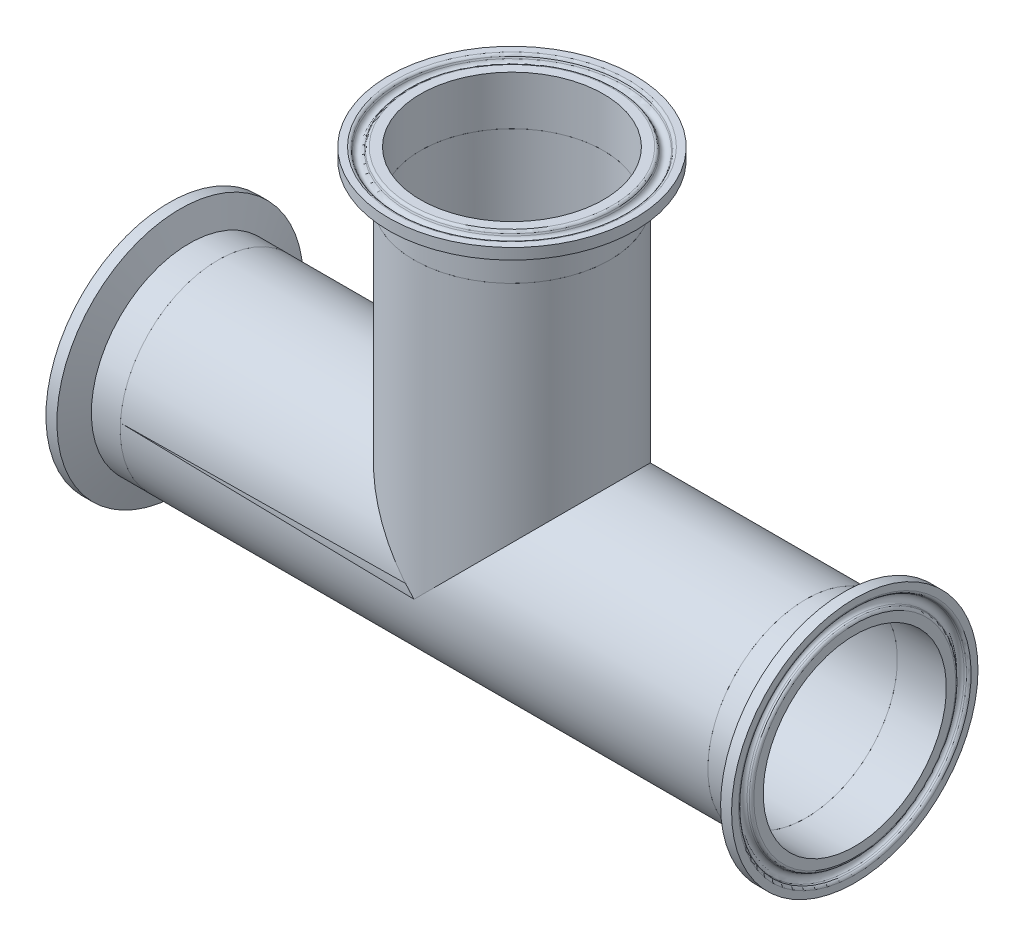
ISO-10303-21;
HEADER;
FILE_DESCRIPTION(('STEP AP214'),'2;1');
FILE_NAME('part.step','',(''),(''),'','','');
FILE_SCHEMA(('AUTOMOTIVE_DESIGN { 1 0 10303 214 1 1 1 1 }'));
ENDSEC;
DATA;
#1=APPLICATION_CONTEXT('core data for automotive mechanical design processes');
#2=APPLICATION_PROTOCOL_DEFINITION('international standard','automotive_design',2000,#1);
#3=PRODUCT_CONTEXT('',#1,'mechanical');
#4=PRODUCT('Part','Part','',(#3));
#5=PRODUCT_RELATED_PRODUCT_CATEGORY('part','',(#4));
#6=PRODUCT_DEFINITION_FORMATION('','',#4);
#7=PRODUCT_DEFINITION_CONTEXT('part definition',#1,'design');
#8=PRODUCT_DEFINITION('design','',#6,#7);
#9=PRODUCT_DEFINITION_SHAPE('','',#8);
#10=(LENGTH_UNIT() NAMED_UNIT(*) SI_UNIT(.MILLI.,.METRE.));
#11=(NAMED_UNIT(*) PLANE_ANGLE_UNIT() SI_UNIT($,.RADIAN.));
#12=(NAMED_UNIT(*) SI_UNIT($,.STERADIAN.) SOLID_ANGLE_UNIT());
#13=UNCERTAINTY_MEASURE_WITH_UNIT(LENGTH_MEASURE(1.E-05),#10,'distance_accuracy_value','');
#14=(GEOMETRIC_REPRESENTATION_CONTEXT(3) GLOBAL_UNCERTAINTY_ASSIGNED_CONTEXT((#13)) GLOBAL_UNIT_ASSIGNED_CONTEXT((#10,
#11,#12)) REPRESENTATION_CONTEXT('',''));
#15=CARTESIAN_POINT('',(0.,0.,0.));
#16=DIRECTION('',(0.,0.,1.));
#17=DIRECTION('',(1.,0.,0.));
#18=AXIS2_PLACEMENT_3D('',#15,#16,#17);
#19=CARTESIAN_POINT('',(161.640823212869,66.5567829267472,117.428364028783));
#20=DIRECTION('',(-1.,0.,0.));
#21=DIRECTION('',(0.,0.953986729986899,0.299848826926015));
#22=AXIS2_PLACEMENT_3D('',#19,#20,#21);
#23=PLANE('',#22);
#24=CARTESIAN_POINT('',(161.640823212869,66.5567829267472,117.428364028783));
#25=DIRECTION('',(1.,0.,0.));
#26=DIRECTION('',(0.,-0.953986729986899,-0.299848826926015));
#27=AXIS2_PLACEMENT_3D('',#24,#25,#26);
#28=CIRCLE('',#27,30.1591722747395);
#29=CARTESIAN_POINT('',(161.640823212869,37.7853327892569,108.385171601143));
#30=VERTEX_POINT('',#29);
#31=EDGE_CURVE('P0_E9',#30,#30,#28,.T.);
#32=ORIENTED_EDGE('',*,*,#31,.F.);
#33=EDGE_LOOP('',(#32));
#34=FACE_BOUND('',#33,.T.);
#35=CARTESIAN_POINT('',(161.640823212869,66.5567829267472,117.428364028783));
#36=DIRECTION('',(1.,0.,0.));
#37=DIRECTION('',(0.,-0.953986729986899,-0.299848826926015));
#38=AXIS2_PLACEMENT_3D('',#35,#36,#37);
#39=CIRCLE('',#38,31.9532);
#40=CARTESIAN_POINT('',(161.640823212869,36.0738541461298,107.847234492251));
#41=VERTEX_POINT('',#40);
#42=EDGE_CURVE('P0_E54',#41,#41,#39,.T.);
#43=ORIENTED_EDGE('',*,*,#42,.T.);
#44=EDGE_LOOP('',(#43));
#45=FACE_BOUND('',#44,.T.);
#46=ADVANCED_FACE('P0_F14',(#34,#45),#23,.F.);
#47=CARTESIAN_POINT('',(160.853423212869,66.5567829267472,117.428364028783));
#48=DIRECTION('',(1.,0.,0.));
#49=DIRECTION('',(0.,-0.953986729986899,-0.299848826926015));
#50=AXIS2_PLACEMENT_3D('',#47,#48,#49);
#51=TOROIDAL_SURFACE('',#50,30.1591722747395,0.7874);
#52=CARTESIAN_POINT('',(161.161084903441,66.5567829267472,117.428364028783));
#53=DIRECTION('',(1.,0.,0.));
#54=DIRECTION('',(0.,-0.953986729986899,-0.299848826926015));
#55=AXIS2_PLACEMENT_3D('',#52,#53,#54);
#56=CIRCLE('',#55,29.4343667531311);
#57=CARTESIAN_POINT('',(161.161084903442,38.4767876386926,108.602503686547));
#58=VERTEX_POINT('',#57);
#59=EDGE_CURVE('P0_E20',#58,#58,#56,.T.);
#60=ORIENTED_EDGE('',*,*,#59,.F.);
#61=EDGE_LOOP('',(#60));
#62=FACE_BOUND('',#61,.T.);
#63=ORIENTED_EDGE('',*,*,#31,.T.);
#64=EDGE_LOOP('',(#63));
#65=FACE_BOUND('',#64,.T.);
#66=ADVANCED_FACE('P0_F96',(#62,#65),#51,.T.);
#67=CARTESIAN_POINT('',(160.767968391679,66.5567829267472,117.428364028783));
#68=DIRECTION('',(1.,0.,0.));
#69=DIRECTION('',(0.,-0.953986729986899,-0.299848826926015));
#70=AXIS2_PLACEMENT_3D('',#67,#68,#69);
#71=CONICAL_SURFACE('',#70,29.2674986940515,0.401425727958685);
#72=CARTESIAN_POINT('',(160.767968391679,66.5567829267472,117.428364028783));
#73=DIRECTION('',(1.,0.,0.));
#74=DIRECTION('',(0.,-0.953986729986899,-0.299848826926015));
#75=AXIS2_PLACEMENT_3D('',#72,#73,#74);
#76=CIRCLE('',#75,29.2674986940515);
#77=CARTESIAN_POINT('',(160.767968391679,38.6359775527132,108.652538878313));
#78=VERTEX_POINT('',#77);
#79=EDGE_CURVE('P0_E24',#78,#78,#76,.T.);
#80=CARTESIAN_POINT('',(161.161084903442,38.4767876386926,108.602503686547));
#81=CARTESIAN_POINT('',(161.156989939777,38.4784458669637,108.603024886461));
#82=CARTESIAN_POINT('',(161.152894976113,38.4801040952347,108.603546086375));
#83=CARTESIAN_POINT('',(161.144705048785,38.4834205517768,108.604588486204));
#84=CARTESIAN_POINT('',(161.14061008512,38.4850787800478,108.605109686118));
#85=CARTESIAN_POINT('',(161.132420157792,38.4883952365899,108.606152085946));
#86=CARTESIAN_POINT('',(161.128325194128,38.490053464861,108.606673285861));
#87=CARTESIAN_POINT('',(161.1201352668,38.4933699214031,108.607715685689));
#88=CARTESIAN_POINT('',(161.116040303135,38.4950281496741,108.608236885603));
#89=CARTESIAN_POINT('',(161.107850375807,38.4983446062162,108.609279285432));
#90=CARTESIAN_POINT('',(161.103755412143,38.5000028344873,108.609800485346));
#91=CARTESIAN_POINT('',(161.095565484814,38.5033192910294,108.610842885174));
#92=CARTESIAN_POINT('',(161.09147052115,38.5049775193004,108.611364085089));
#93=CARTESIAN_POINT('',(161.083280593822,38.5082939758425,108.612406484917));
#94=CARTESIAN_POINT('',(161.079185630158,38.5099522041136,108.612927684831));
#95=CARTESIAN_POINT('',(161.070995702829,38.5132686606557,108.61397008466));
#96=CARTESIAN_POINT('',(161.066900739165,38.5149268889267,108.614491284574));
#97=CARTESIAN_POINT('',(161.058710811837,38.5182433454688,108.615533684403));
#98=CARTESIAN_POINT('',(161.054615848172,38.5199015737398,108.616054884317));
#99=CARTESIAN_POINT('',(161.046425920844,38.5232180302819,108.617097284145));
#100=CARTESIAN_POINT('',(161.04233095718,38.524876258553,108.617618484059));
#101=CARTESIAN_POINT('',(161.034141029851,38.5281927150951,108.618660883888));
#102=CARTESIAN_POINT('',(161.030046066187,38.5298509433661,108.619182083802));
#103=CARTESIAN_POINT('',(161.021856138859,38.5331673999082,108.620224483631));
#104=CARTESIAN_POINT('',(161.017761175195,38.5348256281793,108.620745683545));
#105=CARTESIAN_POINT('',(161.009571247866,38.5381420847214,108.621788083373));
#106=CARTESIAN_POINT('',(161.005476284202,38.5398003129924,108.622309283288));
#107=CARTESIAN_POINT('',(160.997286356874,38.5431167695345,108.623351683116));
#108=CARTESIAN_POINT('',(160.993191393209,38.5447749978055,108.62387288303));
#109=CARTESIAN_POINT('',(160.985001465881,38.5480914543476,108.624915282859));
#110=CARTESIAN_POINT('',(160.980906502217,38.5497496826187,108.625436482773));
#111=CARTESIAN_POINT('',(160.972716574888,38.5530661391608,108.626478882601));
#112=CARTESIAN_POINT('',(160.968621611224,38.5547243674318,108.627000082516));
#113=CARTESIAN_POINT('',(160.960431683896,38.5580408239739,108.628042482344));
#114=CARTESIAN_POINT('',(160.956336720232,38.559699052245,108.628563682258));
#115=CARTESIAN_POINT('',(160.948146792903,38.5630155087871,108.629606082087));
#116=CARTESIAN_POINT('',(160.944051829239,38.5646737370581,108.630127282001));
#117=CARTESIAN_POINT('',(160.935861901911,38.5679901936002,108.631169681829));
#118=CARTESIAN_POINT('',(160.931766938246,38.5696484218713,108.631690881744));
#119=CARTESIAN_POINT('',(160.923577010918,38.5729648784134,108.632733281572));
#120=CARTESIAN_POINT('',(160.919482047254,38.5746231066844,108.633254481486));
#121=CARTESIAN_POINT('',(160.911292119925,38.5779395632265,108.634296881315));
#122=CARTESIAN_POINT('',(160.907197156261,38.5795977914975,108.634818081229));
#123=CARTESIAN_POINT('',(160.899007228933,38.5829142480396,108.635860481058));
#124=CARTESIAN_POINT('',(160.894912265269,38.5845724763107,108.636381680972));
#125=CARTESIAN_POINT('',(160.88672233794,38.5878889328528,108.6374240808));
#126=CARTESIAN_POINT('',(160.882627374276,38.5895471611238,108.637945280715));
#127=CARTESIAN_POINT('',(160.874437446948,38.5928636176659,108.638987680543));
#128=CARTESIAN_POINT('',(160.870342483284,38.594521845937,108.639508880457));
#129=CARTESIAN_POINT('',(160.862152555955,38.5978383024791,108.640551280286));
#130=CARTESIAN_POINT('',(160.858057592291,38.5994965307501,108.6410724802));
#131=CARTESIAN_POINT('',(160.849867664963,38.6028129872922,108.642114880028));
#132=CARTESIAN_POINT('',(160.845772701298,38.6044712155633,108.642636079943));
#133=CARTESIAN_POINT('',(160.83758277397,38.6077876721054,108.643678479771));
#134=CARTESIAN_POINT('',(160.833487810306,38.6094459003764,108.644199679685));
#135=CARTESIAN_POINT('',(160.825297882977,38.6127623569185,108.645242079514));
#136=CARTESIAN_POINT('',(160.821202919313,38.6144205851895,108.645763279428));
#137=CARTESIAN_POINT('',(160.813012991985,38.6177370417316,108.646805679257));
#138=CARTESIAN_POINT('',(160.808918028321,38.6193952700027,108.647326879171));
#139=CARTESIAN_POINT('',(160.800728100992,38.6227117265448,108.648369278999));
#140=CARTESIAN_POINT('',(160.796633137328,38.6243699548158,108.648890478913));
#141=CARTESIAN_POINT('',(160.78844321,38.6276864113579,108.649932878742));
#142=CARTESIAN_POINT('',(160.784348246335,38.629344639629,108.650454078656));
#143=CARTESIAN_POINT('',(160.776158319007,38.6326610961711,108.651496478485));
#144=CARTESIAN_POINT('',(160.772063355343,38.6343193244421,108.652017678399));
#145=CARTESIAN_POINT('',(160.767968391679,38.6359775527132,108.652538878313));
#146=B_SPLINE_CURVE_WITH_KNOTS('',3,(#80,#81,#82,#83,#84,#85,#86,#87,#88,#89,#90,#91,#92,#93,
#94,#95,#96,#97,#98,#99,#100,#101,#102,#103,#104,#105,#106,#107,#108,#109,#110,#111,#112,#113,
#114,#115,#116,#117,#118,#119,#120,#121,#122,#123,#124,#125,#126,#127,#128,#129,#130,#131,#132,
#133,#134,#135,#136,#137,#138,#139,#140,#141,#142,#143,#144,#145),.UNSPECIFIED.,.F.,.F.,(4,2,2,
2,2,2,2,2,2,2,2,2,2,2,2,2,2,2,2,2,2,2,2,2,2,2,2,2,2,2,2,2,4),(0.,0.013345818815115,
0.026691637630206,0.0400374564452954,0.0533832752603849,0.0667290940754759,0.0800749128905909,
0.0934207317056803,0.106766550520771,0.120112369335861,0.13345818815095,0.146804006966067,
0.160149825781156,0.173495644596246,0.186841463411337,0.200187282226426,0.213533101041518,
0.226878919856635,0.240224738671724,0.253570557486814,0.266916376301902,0.280262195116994,
0.293608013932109,0.3069538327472,0.32029965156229,0.333645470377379,0.346991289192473,
0.360337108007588,0.373682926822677,0.387028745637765,0.400374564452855,0.413720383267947,
0.427066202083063),.UNSPECIFIED.);
#147=EDGE_CURVE('P0_BSEAM101',#58,#78,#146,.T.);
#148=ORIENTED_EDGE('',*,*,#59,.T.);
#149=ORIENTED_EDGE('',*,*,#79,.F.);
#150=ORIENTED_EDGE('',*,*,#147,.T.);
#151=ORIENTED_EDGE('',*,*,#147,.F.);
#152=EDGE_LOOP('',(#148,#150,#149,#151));
#153=FACE_BOUND('',#152,.T.);
#154=ADVANCED_FACE('P0_F101',(#153),#71,.F.);
#155=CARTESIAN_POINT('',(161.234423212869,66.5567829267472,117.428364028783));
#156=DIRECTION('',(1.,0.,0.));
#157=DIRECTION('',(0.,-0.953986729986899,-0.299848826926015));
#158=AXIS2_PLACEMENT_3D('',#155,#156,#157);
#159=TOROIDAL_SURFACE('',#158,28.1686,1.1938);
#160=CARTESIAN_POINT('',(160.767968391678,66.5567829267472,117.428364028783));
#161=DIRECTION('',(1.,0.,0.));
#162=DIRECTION('',(0.,-0.953986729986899,-0.299848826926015));
#163=AXIS2_PLACEMENT_3D('',#160,#161,#162);
#164=CIRCLE('',#163,27.0697013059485);
#165=CARTESIAN_POINT('',(160.767968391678,92.3809187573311,125.545182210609));
#166=VERTEX_POINT('',#165);
#167=EDGE_CURVE('P0_E28',#166,#166,#164,.T.);
#168=ORIENTED_EDGE('',*,*,#167,.F.);
#169=EDGE_LOOP('',(#168));
#170=FACE_BOUND('',#169,.T.);
#171=ORIENTED_EDGE('',*,*,#79,.T.);
#172=EDGE_LOOP('',(#171));
#173=FACE_BOUND('',#172,.T.);
#174=ADVANCED_FACE('P0_F106',(#170,#173),#159,.F.);
#175=CARTESIAN_POINT('',(160.767968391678,66.5567829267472,117.428364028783));
#176=DIRECTION('',(-1.,0.,0.));
#177=DIRECTION('',(0.,0.953986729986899,0.299848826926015));
#178=AXIS2_PLACEMENT_3D('',#175,#176,#177);
#179=CONICAL_SURFACE('',#178,27.0697013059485,0.401425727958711);
#180=CARTESIAN_POINT('',(161.161084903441,66.5567829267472,117.428364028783));
#181=DIRECTION('',(1.,0.,0.));
#182=DIRECTION('',(0.,-0.953986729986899,-0.299848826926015));
#183=AXIS2_PLACEMENT_3D('',#180,#181,#182);
#184=CIRCLE('',#183,26.9028332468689);
#185=CARTESIAN_POINT('',(161.161084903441,92.2217288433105,125.495147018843));
#186=VERTEX_POINT('',#185);
#187=EDGE_CURVE('P0_E33',#186,#186,#184,.T.);
#188=CARTESIAN_POINT('',(161.161084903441,92.2217288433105,125.495147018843));
#189=CARTESIAN_POINT('',(161.156989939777,92.2233870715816,125.495668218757));
#190=CARTESIAN_POINT('',(161.152894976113,92.2250452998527,125.496189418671));
#191=CARTESIAN_POINT('',(161.144705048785,92.2283617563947,125.4972318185));
#192=CARTESIAN_POINT('',(161.14061008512,92.2300199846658,125.497753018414));
#193=CARTESIAN_POINT('',(161.132420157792,92.2333364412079,125.498795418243));
#194=CARTESIAN_POINT('',(161.128325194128,92.2349946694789,125.499316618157));
#195=CARTESIAN_POINT('',(161.1201352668,92.238311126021,125.500359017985));
#196=CARTESIAN_POINT('',(161.116040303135,92.2399693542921,125.5008802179));
#197=CARTESIAN_POINT('',(161.107850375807,92.2432858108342,125.501922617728));
#198=CARTESIAN_POINT('',(161.103755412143,92.2449440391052,125.502443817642));
#199=CARTESIAN_POINT('',(161.095565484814,92.2482604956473,125.503486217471));
#200=CARTESIAN_POINT('',(161.09147052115,92.2499187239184,125.504007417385));
#201=CARTESIAN_POINT('',(161.083280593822,92.2532351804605,125.505049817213));
#202=CARTESIAN_POINT('',(161.079185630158,92.2548934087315,125.505571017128));
#203=CARTESIAN_POINT('',(161.070995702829,92.2582098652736,125.506613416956));
#204=CARTESIAN_POINT('',(161.066900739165,92.2598680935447,125.50713461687));
#205=CARTESIAN_POINT('',(161.058710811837,92.2631845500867,125.508177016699));
#206=CARTESIAN_POINT('',(161.054615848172,92.2648427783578,125.508698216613));
#207=CARTESIAN_POINT('',(161.046425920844,92.2681592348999,125.509740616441));
#208=CARTESIAN_POINT('',(161.04233095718,92.2698174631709,125.510261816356));
#209=CARTESIAN_POINT('',(161.034141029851,92.273133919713,125.511304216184));
#210=CARTESIAN_POINT('',(161.030046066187,92.2747921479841,125.511825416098));
#211=CARTESIAN_POINT('',(161.021856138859,92.2781086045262,125.512867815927));
#212=CARTESIAN_POINT('',(161.017761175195,92.2797668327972,125.513389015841));
#213=CARTESIAN_POINT('',(161.009571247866,92.2830832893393,125.51443141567));
#214=CARTESIAN_POINT('',(161.005476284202,92.2847415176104,125.514952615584));
#215=CARTESIAN_POINT('',(160.997286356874,92.2880579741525,125.515995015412));
#216=CARTESIAN_POINT('',(160.993191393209,92.2897162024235,125.516516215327));
#217=CARTESIAN_POINT('',(160.985001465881,92.2930326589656,125.517558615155));
#218=CARTESIAN_POINT('',(160.980906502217,92.2946908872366,125.518079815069));
#219=CARTESIAN_POINT('',(160.972716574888,92.2980073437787,125.519122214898));
#220=CARTESIAN_POINT('',(160.968621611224,92.2996655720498,125.519643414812));
#221=CARTESIAN_POINT('',(160.960431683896,92.3029820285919,125.52068581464));
#222=CARTESIAN_POINT('',(160.956336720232,92.3046402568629,125.521207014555));
#223=CARTESIAN_POINT('',(160.948146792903,92.307956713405,125.522249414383));
#224=CARTESIAN_POINT('',(160.944051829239,92.3096149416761,125.522770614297));
#225=CARTESIAN_POINT('',(160.935861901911,92.3129313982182,125.523813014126));
#226=CARTESIAN_POINT('',(160.931766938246,92.3145896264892,125.52433421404));
#227=CARTESIAN_POINT('',(160.923577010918,92.3179060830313,125.525376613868));
#228=CARTESIAN_POINT('',(160.919482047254,92.3195643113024,125.525897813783));
#229=CARTESIAN_POINT('',(160.911292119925,92.3228807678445,125.526940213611));
#230=CARTESIAN_POINT('',(160.907197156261,92.3245389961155,125.527461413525));
#231=CARTESIAN_POINT('',(160.899007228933,92.3278554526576,125.528503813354));
#232=CARTESIAN_POINT('',(160.894912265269,92.3295136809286,125.529025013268));
#233=CARTESIAN_POINT('',(160.88672233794,92.3328301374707,125.530067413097));
#234=CARTESIAN_POINT('',(160.882627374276,92.3344883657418,125.530588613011));
#235=CARTESIAN_POINT('',(160.874437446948,92.3378048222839,125.531631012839));
#236=CARTESIAN_POINT('',(160.870342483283,92.3394630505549,125.532152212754));
#237=CARTESIAN_POINT('',(160.862152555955,92.342779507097,125.533194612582));
#238=CARTESIAN_POINT('',(160.858057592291,92.3444377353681,125.533715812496));
#239=CARTESIAN_POINT('',(160.849867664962,92.3477541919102,125.534758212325));
#240=CARTESIAN_POINT('',(160.845772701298,92.3494124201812,125.535279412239));
#241=CARTESIAN_POINT('',(160.83758277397,92.3527288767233,125.536321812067));
#242=CARTESIAN_POINT('',(160.833487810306,92.3543871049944,125.536843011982));
#243=CARTESIAN_POINT('',(160.825297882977,92.3577035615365,125.53788541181));
#244=CARTESIAN_POINT('',(160.821202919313,92.3593617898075,125.538406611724));
#245=CARTESIAN_POINT('',(160.813012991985,92.3626782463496,125.539449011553));
#246=CARTESIAN_POINT('',(160.80891802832,92.3643364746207,125.539970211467));
#247=CARTESIAN_POINT('',(160.800728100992,92.3676529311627,125.541012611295));
#248=CARTESIAN_POINT('',(160.796633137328,92.3693111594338,125.54153381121));
#249=CARTESIAN_POINT('',(160.788443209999,92.3726276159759,125.542576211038));
#250=CARTESIAN_POINT('',(160.784348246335,92.3742858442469,125.543097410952));
#251=CARTESIAN_POINT('',(160.776158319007,92.377602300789,125.544139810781));
#252=CARTESIAN_POINT('',(160.772063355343,92.3792605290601,125.544661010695));
#253=CARTESIAN_POINT('',(160.767968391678,92.3809187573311,125.545182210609));
#254=B_SPLINE_CURVE_WITH_KNOTS('',3,(#188,#189,#190,#191,#192,#193,#194,#195,#196,#197,#198,
#199,#200,#201,#202,#203,#204,#205,#206,#207,#208,#209,#210,#211,#212,#213,#214,#215,#216,#217,
#218,#219,#220,#221,#222,#223,#224,#225,#226,#227,#228,#229,#230,#231,#232,#233,#234,#235,#236,
#237,#238,#239,#240,#241,#242,#243,#244,#245,#246,#247,#248,#249,#250,#251,#252,#253),
.UNSPECIFIED.,.F.,.F.,(4,2,2,2,2,2,2,2,2,2,2,2,2,2,2,2,2,2,2,2,2,2,2,2,2,2,2,2,2,2,2,2,4),(0.,
0.0133458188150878,0.0266916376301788,0.0400374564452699,0.0533832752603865,0.0667290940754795,
0.0800749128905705,0.0934207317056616,0.106766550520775,0.120112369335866,0.133458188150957,
0.146804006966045,0.160149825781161,0.173495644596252,0.18684146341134,0.200187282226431,
0.213533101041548,0.226878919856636,0.240224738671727,0.253570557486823,0.266916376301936,
0.280262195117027,0.293608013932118,0.306953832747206,0.320299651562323,0.333645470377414,
0.346991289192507,0.360337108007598,0.373682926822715,0.387028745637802,0.400374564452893,
0.413720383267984,0.427066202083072),.UNSPECIFIED.);
#255=EDGE_CURVE('P0_BSEAM111',#186,#166,#254,.T.);
#256=ORIENTED_EDGE('',*,*,#187,.F.);
#257=ORIENTED_EDGE('',*,*,#167,.T.);
#258=ORIENTED_EDGE('',*,*,#255,.T.);
#259=ORIENTED_EDGE('',*,*,#255,.F.);
#260=EDGE_LOOP('',(#256,#258,#257,#259));
#261=FACE_BOUND('',#260,.T.);
#262=ADVANCED_FACE('P0_F111',(#261),#179,.T.);
#263=CARTESIAN_POINT('',(160.853423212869,66.5567829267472,117.428364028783));
#264=DIRECTION('',(1.,0.,0.));
#265=DIRECTION('',(0.,-0.953986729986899,-0.299848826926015));
#266=AXIS2_PLACEMENT_3D('',#263,#264,#265);
#267=TOROIDAL_SURFACE('',#266,26.1780277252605,0.787399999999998);
#268=ORIENTED_EDGE('',*,*,#187,.T.);
#269=EDGE_LOOP('',(#268));
#270=FACE_BOUND('',#269,.T.);
#271=CARTESIAN_POINT('',(161.640823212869,66.5567829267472,117.428364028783));
#272=DIRECTION('',(1.,0.,0.));
#273=DIRECTION('',(0.,-0.953986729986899,-0.299848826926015));
#274=AXIS2_PLACEMENT_3D('',#271,#272,#273);
#275=CIRCLE('',#274,26.1780277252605);
#276=CARTESIAN_POINT('',(161.640823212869,41.5832918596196,109.578913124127));
#277=VERTEX_POINT('',#276);
#278=EDGE_CURVE('P0_E36',#277,#277,#275,.T.);
#279=ORIENTED_EDGE('',*,*,#278,.F.);
#280=EDGE_LOOP('',(#279));
#281=FACE_BOUND('',#280,.T.);
#282=ADVANCED_FACE('P0_F92',(#270,#281),#267,.T.);
#283=CARTESIAN_POINT('',(161.640823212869,66.5567829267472,117.428364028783));
#284=DIRECTION('',(-1.,0.,0.));
#285=DIRECTION('',(0.,0.953986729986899,0.299848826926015));
#286=AXIS2_PLACEMENT_3D('',#283,#284,#285);
#287=PLANE('',#286);
#288=CARTESIAN_POINT('',(161.640823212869,66.5567829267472,117.428364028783));
#289=DIRECTION('',(1.,0.,0.));
#290=DIRECTION('',(0.,-0.953986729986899,-0.299848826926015));
#291=AXIS2_PLACEMENT_3D('',#288,#289,#290);
#292=CIRCLE('',#291,23.749);
#293=CARTESIAN_POINT('',(161.640823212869,43.9005520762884,110.307254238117));
#294=VERTEX_POINT('',#293);
#295=EDGE_CURVE('P0_E39',#294,#294,#292,.T.);
#296=ORIENTED_EDGE('',*,*,#295,.F.);
#297=EDGE_LOOP('',(#296));
#298=FACE_BOUND('',#297,.T.);
#299=ORIENTED_EDGE('',*,*,#278,.T.);
#300=EDGE_LOOP('',(#299));
#301=FACE_BOUND('',#300,.T.);
#302=ADVANCED_FACE('P0_F85',(#298,#301),#287,.F.);
#303=CARTESIAN_POINT('',(161.640823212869,66.5567829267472,117.428364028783));
#304=DIRECTION('',(1.,0.,0.));
#305=DIRECTION('',(0.,-0.953986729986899,-0.299848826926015));
#306=AXIS2_PLACEMENT_3D('',#303,#304,#305);
#307=CYLINDRICAL_SURFACE('',#306,23.749);
#308=CARTESIAN_POINT('',(148.940823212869,66.5567829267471,117.428364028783));
#309=DIRECTION('',(1.,0.,0.));
#310=DIRECTION('',(0.,-0.953986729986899,-0.299848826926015));
#311=AXIS2_PLACEMENT_3D('',#308,#309,#310);
#312=CIRCLE('',#311,23.749);
#313=CARTESIAN_POINT('',(148.940823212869,43.9005520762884,110.307254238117));
#314=VERTEX_POINT('',#313);
#315=EDGE_CURVE('P0_E42',#314,#314,#312,.T.);
#316=CARTESIAN_POINT('',(161.640823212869,43.9005520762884,110.307254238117));
#317=CARTESIAN_POINT('',(161.508531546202,43.9005520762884,110.307254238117));
#318=CARTESIAN_POINT('',(161.376239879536,43.9005520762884,110.307254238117));
#319=CARTESIAN_POINT('',(161.111656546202,43.9005520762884,110.307254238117));
#320=CARTESIAN_POINT('',(160.979364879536,43.9005520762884,110.307254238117));
#321=CARTESIAN_POINT('',(160.714781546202,43.9005520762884,110.307254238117));
#322=CARTESIAN_POINT('',(160.582489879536,43.9005520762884,110.307254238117));
#323=CARTESIAN_POINT('',(160.317906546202,43.9005520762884,110.307254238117));
#324=CARTESIAN_POINT('',(160.185614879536,43.9005520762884,110.307254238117));
#325=CARTESIAN_POINT('',(159.921031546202,43.9005520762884,110.307254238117));
#326=CARTESIAN_POINT('',(159.788739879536,43.9005520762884,110.307254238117));
#327=CARTESIAN_POINT('',(159.524156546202,43.9005520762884,110.307254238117));
#328=CARTESIAN_POINT('',(159.391864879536,43.9005520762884,110.307254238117));
#329=CARTESIAN_POINT('',(159.127281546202,43.9005520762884,110.307254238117));
#330=CARTESIAN_POINT('',(158.994989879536,43.9005520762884,110.307254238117));
#331=CARTESIAN_POINT('',(158.730406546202,43.9005520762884,110.307254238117));
#332=CARTESIAN_POINT('',(158.598114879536,43.9005520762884,110.307254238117));
#333=CARTESIAN_POINT('',(158.333531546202,43.9005520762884,110.307254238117));
#334=CARTESIAN_POINT('',(158.201239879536,43.9005520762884,110.307254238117));
#335=CARTESIAN_POINT('',(157.936656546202,43.9005520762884,110.307254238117));
#336=CARTESIAN_POINT('',(157.804364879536,43.9005520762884,110.307254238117));
#337=CARTESIAN_POINT('',(157.539781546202,43.9005520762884,110.307254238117));
#338=CARTESIAN_POINT('',(157.407489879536,43.9005520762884,110.307254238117));
#339=CARTESIAN_POINT('',(157.142906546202,43.9005520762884,110.307254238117));
#340=CARTESIAN_POINT('',(157.010614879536,43.9005520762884,110.307254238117));
#341=CARTESIAN_POINT('',(156.746031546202,43.9005520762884,110.307254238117));
#342=CARTESIAN_POINT('',(156.613739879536,43.9005520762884,110.307254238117));
#343=CARTESIAN_POINT('',(156.349156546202,43.9005520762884,110.307254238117));
#344=CARTESIAN_POINT('',(156.216864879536,43.9005520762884,110.307254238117));
#345=CARTESIAN_POINT('',(155.952281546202,43.9005520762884,110.307254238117));
#346=CARTESIAN_POINT('',(155.819989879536,43.9005520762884,110.307254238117));
#347=CARTESIAN_POINT('',(155.555406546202,43.9005520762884,110.307254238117));
#348=CARTESIAN_POINT('',(155.423114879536,43.9005520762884,110.307254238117));
#349=CARTESIAN_POINT('',(155.158531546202,43.9005520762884,110.307254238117));
#350=CARTESIAN_POINT('',(155.026239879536,43.9005520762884,110.307254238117));
#351=CARTESIAN_POINT('',(154.761656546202,43.9005520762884,110.307254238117));
#352=CARTESIAN_POINT('',(154.629364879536,43.9005520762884,110.307254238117));
#353=CARTESIAN_POINT('',(154.364781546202,43.9005520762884,110.307254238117));
#354=CARTESIAN_POINT('',(154.232489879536,43.9005520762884,110.307254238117));
#355=CARTESIAN_POINT('',(153.967906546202,43.9005520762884,110.307254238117));
#356=CARTESIAN_POINT('',(153.835614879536,43.9005520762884,110.307254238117));
#357=CARTESIAN_POINT('',(153.571031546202,43.9005520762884,110.307254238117));
#358=CARTESIAN_POINT('',(153.438739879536,43.9005520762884,110.307254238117));
#359=CARTESIAN_POINT('',(153.174156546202,43.9005520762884,110.307254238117));
#360=CARTESIAN_POINT('',(153.041864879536,43.9005520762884,110.307254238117));
#361=CARTESIAN_POINT('',(152.777281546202,43.9005520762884,110.307254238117));
#362=CARTESIAN_POINT('',(152.644989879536,43.9005520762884,110.307254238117));
#363=CARTESIAN_POINT('',(152.380406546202,43.9005520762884,110.307254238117));
#364=CARTESIAN_POINT('',(152.248114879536,43.9005520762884,110.307254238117));
#365=CARTESIAN_POINT('',(151.983531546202,43.9005520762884,110.307254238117));
#366=CARTESIAN_POINT('',(151.851239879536,43.9005520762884,110.307254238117));
#367=CARTESIAN_POINT('',(151.586656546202,43.9005520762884,110.307254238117));
#368=CARTESIAN_POINT('',(151.454364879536,43.9005520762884,110.307254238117));
#369=CARTESIAN_POINT('',(151.189781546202,43.9005520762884,110.307254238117));
#370=CARTESIAN_POINT('',(151.057489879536,43.9005520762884,110.307254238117));
#371=CARTESIAN_POINT('',(150.792906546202,43.9005520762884,110.307254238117));
#372=CARTESIAN_POINT('',(150.660614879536,43.9005520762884,110.307254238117));
#373=CARTESIAN_POINT('',(150.396031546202,43.9005520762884,110.307254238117));
#374=CARTESIAN_POINT('',(150.263739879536,43.9005520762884,110.307254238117));
#375=CARTESIAN_POINT('',(149.999156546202,43.9005520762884,110.307254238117));
#376=CARTESIAN_POINT('',(149.866864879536,43.9005520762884,110.307254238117));
#377=CARTESIAN_POINT('',(149.602281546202,43.9005520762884,110.307254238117));
#378=CARTESIAN_POINT('',(149.469989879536,43.9005520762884,110.307254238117));
#379=CARTESIAN_POINT('',(149.205406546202,43.9005520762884,110.307254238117));
#380=CARTESIAN_POINT('',(149.073114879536,43.9005520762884,110.307254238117));
#381=CARTESIAN_POINT('',(148.940823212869,43.9005520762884,110.307254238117));
#382=B_SPLINE_CURVE_WITH_KNOTS('',3,(#316,#317,#318,#319,#320,#321,#322,#323,#324,#325,#326,
#327,#328,#329,#330,#331,#332,#333,#334,#335,#336,#337,#338,#339,#340,#341,#342,#343,#344,#345,
#346,#347,#348,#349,#350,#351,#352,#353,#354,#355,#356,#357,#358,#359,#360,#361,#362,#363,#364,
#365,#366,#367,#368,#369,#370,#371,#372,#373,#374,#375,#376,#377,#378,#379,#380,#381),
.UNSPECIFIED.,.F.,.F.,(4,2,2,2,2,2,2,2,2,2,2,2,2,2,2,2,2,2,2,2,2,2,2,2,2,2,2,2,2,2,2,2,4),(0.,
0.396875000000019,0.79375000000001,1.190625,1.58750000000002,1.98437500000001,2.38125,
2.77812500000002,3.17500000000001,3.571875,3.96875000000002,4.36562500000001,4.7625,
5.15937500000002,5.55625000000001,5.953125,6.34999999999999,6.74687500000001,7.14375,7.540625,
7.93750000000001,8.334375,8.73125,9.12812500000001,9.52500000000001,9.921875,10.31875,10.715625,
11.1125,11.509375,11.90625,12.303125,12.7),.UNSPECIFIED.);
#383=EDGE_CURVE('P0_BSEAM80',#294,#314,#382,.T.);
#384=ORIENTED_EDGE('',*,*,#295,.T.);
#385=ORIENTED_EDGE('',*,*,#315,.F.);
#386=ORIENTED_EDGE('',*,*,#383,.T.);
#387=ORIENTED_EDGE('',*,*,#383,.F.);
#388=EDGE_LOOP('',(#384,#386,#385,#387));
#389=FACE_BOUND('',#388,.T.);
#390=ADVANCED_FACE('P0_F80',(#389),#307,.F.);
#391=CARTESIAN_POINT('',(148.940823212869,66.5567829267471,117.428364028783));
#392=DIRECTION('',(1.,0.,0.));
#393=DIRECTION('',(0.,-0.953986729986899,-0.299848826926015));
#394=AXIS2_PLACEMENT_3D('',#391,#392,#393);
#395=PLANE('',#394);
#396=CARTESIAN_POINT('',(148.940823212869,66.5567829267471,117.428364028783));
#397=DIRECTION('',(1.,0.,0.));
#398=DIRECTION('',(0.,-0.953986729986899,-0.299848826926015));
#399=AXIS2_PLACEMENT_3D('',#396,#397,#398);
#400=CIRCLE('',#399,25.4);
#401=CARTESIAN_POINT('',(148.940823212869,42.32551998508,109.812203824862));
#402=VERTEX_POINT('',#401);
#403=EDGE_CURVE('P0_E45',#402,#402,#400,.T.);
#404=ORIENTED_EDGE('',*,*,#403,.F.);
#405=EDGE_LOOP('',(#404));
#406=FACE_BOUND('',#405,.T.);
#407=ORIENTED_EDGE('',*,*,#315,.T.);
#408=EDGE_LOOP('',(#407));
#409=FACE_BOUND('',#408,.T.);
#410=ADVANCED_FACE('P0_F74',(#406,#409),#395,.F.);
#411=CARTESIAN_POINT('',(161.640823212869,66.5567829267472,117.428364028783));
#412=DIRECTION('',(1.,0.,0.));
#413=DIRECTION('',(0.,-0.953986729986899,-0.299848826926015));
#414=AXIS2_PLACEMENT_3D('',#411,#412,#413);
#415=CYLINDRICAL_SURFACE('',#414,25.4);
#416=CARTESIAN_POINT('',(156.410853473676,66.5567829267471,117.428364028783));
#417=DIRECTION('',(1.,0.,0.));
#418=DIRECTION('',(0.,-0.953986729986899,-0.299848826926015));
#419=AXIS2_PLACEMENT_3D('',#416,#417,#418);
#420=CIRCLE('',#419,25.4);
#421=CARTESIAN_POINT('',(156.410853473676,42.32551998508,109.812203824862));
#422=VERTEX_POINT('',#421);
#423=EDGE_CURVE('P0_E48',#422,#422,#420,.T.);
#424=CARTESIAN_POINT('',(156.410853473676,42.32551998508,109.812203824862));
#425=CARTESIAN_POINT('',(156.333040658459,42.32551998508,109.812203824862));
#426=CARTESIAN_POINT('',(156.255227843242,42.32551998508,109.812203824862));
#427=CARTESIAN_POINT('',(156.099602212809,42.32551998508,109.812203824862));
#428=CARTESIAN_POINT('',(156.021789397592,42.32551998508,109.812203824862));
#429=CARTESIAN_POINT('',(155.866163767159,42.32551998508,109.812203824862));
#430=CARTESIAN_POINT('',(155.788350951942,42.32551998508,109.812203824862));
#431=CARTESIAN_POINT('',(155.632725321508,42.32551998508,109.812203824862));
#432=CARTESIAN_POINT('',(155.554912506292,42.32551998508,109.812203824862));
#433=CARTESIAN_POINT('',(155.399286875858,42.32551998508,109.812203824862));
#434=CARTESIAN_POINT('',(155.321474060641,42.32551998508,109.812203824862));
#435=CARTESIAN_POINT('',(155.165848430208,42.32551998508,109.812203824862));
#436=CARTESIAN_POINT('',(155.088035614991,42.32551998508,109.812203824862));
#437=CARTESIAN_POINT('',(154.932409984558,42.32551998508,109.812203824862));
#438=CARTESIAN_POINT('',(154.854597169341,42.32551998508,109.812203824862));
#439=CARTESIAN_POINT('',(154.698971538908,42.32551998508,109.812203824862));
#440=CARTESIAN_POINT('',(154.621158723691,42.32551998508,109.812203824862));
#441=CARTESIAN_POINT('',(154.465533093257,42.32551998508,109.812203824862));
#442=CARTESIAN_POINT('',(154.387720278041,42.32551998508,109.812203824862));
#443=CARTESIAN_POINT('',(154.232094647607,42.32551998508,109.812203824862));
#444=CARTESIAN_POINT('',(154.15428183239,42.32551998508,109.812203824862));
#445=CARTESIAN_POINT('',(153.998656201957,42.32551998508,109.812203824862));
#446=CARTESIAN_POINT('',(153.92084338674,42.32551998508,109.812203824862));
#447=CARTESIAN_POINT('',(153.765217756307,42.32551998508,109.812203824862));
#448=CARTESIAN_POINT('',(153.68740494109,42.32551998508,109.812203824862));
#449=CARTESIAN_POINT('',(153.531779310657,42.32551998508,109.812203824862));
#450=CARTESIAN_POINT('',(153.45396649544,42.32551998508,109.812203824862));
#451=CARTESIAN_POINT('',(153.298340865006,42.32551998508,109.812203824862));
#452=CARTESIAN_POINT('',(153.22052804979,42.32551998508,109.812203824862));
#453=CARTESIAN_POINT('',(153.064902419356,42.32551998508,109.812203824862));
#454=CARTESIAN_POINT('',(152.987089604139,42.32551998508,109.812203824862));
#455=CARTESIAN_POINT('',(152.831463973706,42.32551998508,109.812203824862));
#456=CARTESIAN_POINT('',(152.753651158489,42.32551998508,109.812203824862));
#457=CARTESIAN_POINT('',(152.598025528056,42.32551998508,109.812203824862));
#458=CARTESIAN_POINT('',(152.520212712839,42.32551998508,109.812203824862));
#459=CARTESIAN_POINT('',(152.364587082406,42.32551998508,109.812203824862));
#460=CARTESIAN_POINT('',(152.286774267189,42.32551998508,109.812203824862));
#461=CARTESIAN_POINT('',(152.131148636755,42.32551998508,109.812203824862));
#462=CARTESIAN_POINT('',(152.053335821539,42.32551998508,109.812203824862));
#463=CARTESIAN_POINT('',(151.897710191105,42.32551998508,109.812203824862));
#464=CARTESIAN_POINT('',(151.819897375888,42.32551998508,109.812203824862));
#465=CARTESIAN_POINT('',(151.664271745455,42.32551998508,109.812203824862));
#466=CARTESIAN_POINT('',(151.586458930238,42.32551998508,109.812203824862));
#467=CARTESIAN_POINT('',(151.430833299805,42.32551998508,109.812203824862));
#468=CARTESIAN_POINT('',(151.353020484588,42.32551998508,109.812203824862));
#469=CARTESIAN_POINT('',(151.197394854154,42.32551998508,109.812203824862));
#470=CARTESIAN_POINT('',(151.119582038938,42.32551998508,109.812203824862));
#471=CARTESIAN_POINT('',(150.963956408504,42.32551998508,109.812203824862));
#472=CARTESIAN_POINT('',(150.886143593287,42.32551998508,109.812203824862));
#473=CARTESIAN_POINT('',(150.730517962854,42.32551998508,109.812203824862));
#474=CARTESIAN_POINT('',(150.652705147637,42.32551998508,109.812203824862));
#475=CARTESIAN_POINT('',(150.497079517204,42.32551998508,109.812203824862));
#476=CARTESIAN_POINT('',(150.419266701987,42.32551998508,109.812203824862));
#477=CARTESIAN_POINT('',(150.263641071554,42.32551998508,109.812203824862));
#478=CARTESIAN_POINT('',(150.185828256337,42.32551998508,109.812203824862));
#479=CARTESIAN_POINT('',(150.030202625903,42.32551998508,109.812203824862));
#480=CARTESIAN_POINT('',(149.952389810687,42.32551998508,109.812203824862));
#481=CARTESIAN_POINT('',(149.796764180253,42.32551998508,109.812203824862));
#482=CARTESIAN_POINT('',(149.718951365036,42.32551998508,109.812203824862));
#483=CARTESIAN_POINT('',(149.563325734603,42.32551998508,109.812203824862));
#484=CARTESIAN_POINT('',(149.485512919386,42.32551998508,109.812203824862));
#485=CARTESIAN_POINT('',(149.329887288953,42.32551998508,109.812203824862));
#486=CARTESIAN_POINT('',(149.252074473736,42.32551998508,109.812203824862));
#487=CARTESIAN_POINT('',(149.096448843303,42.32551998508,109.812203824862));
#488=CARTESIAN_POINT('',(149.018636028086,42.32551998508,109.812203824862));
#489=CARTESIAN_POINT('',(148.940823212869,42.32551998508,109.812203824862));
#490=B_SPLINE_CURVE_WITH_KNOTS('',3,(#424,#425,#426,#427,#428,#429,#430,#431,#432,#433,#434,
#435,#436,#437,#438,#439,#440,#441,#442,#443,#444,#445,#446,#447,#448,#449,#450,#451,#452,#453,
#454,#455,#456,#457,#458,#459,#460,#461,#462,#463,#464,#465,#466,#467,#468,#469,#470,#471,#472,
#473,#474,#475,#476,#477,#478,#479,#480,#481,#482,#483,#484,#485,#486,#487,#488,#489),
.UNSPECIFIED.,.F.,.F.,(4,2,2,2,2,2,2,2,2,2,2,2,2,2,2,2,2,2,2,2,2,2,2,2,2,2,2,2,2,2,2,2,4),(0.,
0.233438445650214,0.466876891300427,0.700315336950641,0.933753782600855,1.16719222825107,
1.40063067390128,1.6340691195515,1.86750756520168,2.10094601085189,2.33438445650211,
2.56782290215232,2.80126134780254,3.03469979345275,3.26813823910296,3.50157668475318,
3.73501513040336,3.96845357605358,4.20189202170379,4.435330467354,4.66876891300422,
4.90220735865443,5.13564580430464,5.36908424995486,5.60252269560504,5.83596114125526,
6.06939958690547,6.30283803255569,6.5362764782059,6.76971492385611,7.00315336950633,
7.23659181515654,7.47003026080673),.UNSPECIFIED.);
#491=EDGE_CURVE('P0_BSEAM68',#422,#402,#490,.T.);
#492=ORIENTED_EDGE('',*,*,#423,.F.);
#493=ORIENTED_EDGE('',*,*,#403,.T.);
#494=ORIENTED_EDGE('',*,*,#491,.T.);
#495=ORIENTED_EDGE('',*,*,#491,.F.);
#496=EDGE_LOOP('',(#492,#494,#493,#495));
#497=FACE_BOUND('',#496,.T.);
#498=ADVANCED_FACE('P0_F68',(#497),#415,.T.);
#499=CARTESIAN_POINT('',(156.410853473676,66.5567829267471,117.428364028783));
#500=DIRECTION('',(1.,0.,0.));
#501=DIRECTION('',(0.,-0.953986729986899,-0.299848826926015));
#502=AXIS2_PLACEMENT_3D('',#499,#500,#501);
#503=CONICAL_SURFACE('',#502,25.4,1.22173047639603);
#504=CARTESIAN_POINT('',(158.796023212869,66.5567829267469,117.428364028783));
#505=DIRECTION('',(1.,0.,0.));
#506=DIRECTION('',(0.,-0.953986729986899,-0.299848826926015));
#507=AXIS2_PLACEMENT_3D('',#504,#505,#506);
#508=CIRCLE('',#507,31.9532);
#509=CARTESIAN_POINT('',(158.796023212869,36.0738541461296,107.847234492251));
#510=VERTEX_POINT('',#509);
#511=EDGE_CURVE('P0_E51',#510,#510,#508,.T.);
#512=CARTESIAN_POINT('',(158.796023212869,36.0738541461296,107.847234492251));
#513=CARTESIAN_POINT('',(158.771177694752,36.1389756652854,107.867702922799));
#514=CARTESIAN_POINT('',(158.746332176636,36.2040971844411,107.888171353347));
#515=CARTESIAN_POINT('',(158.696641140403,36.3343402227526,107.929108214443));
#516=CARTESIAN_POINT('',(158.671795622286,36.3994617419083,107.949576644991));
#517=CARTESIAN_POINT('',(158.622104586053,36.5297047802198,107.990513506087));
#518=CARTESIAN_POINT('',(158.597259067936,36.5948262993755,108.010981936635));
#519=CARTESIAN_POINT('',(158.547568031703,36.7250693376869,108.051918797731));
#520=CARTESIAN_POINT('',(158.522722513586,36.7901908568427,108.072387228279));
#521=CARTESIAN_POINT('',(158.473031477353,36.9204338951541,108.113324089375));
#522=CARTESIAN_POINT('',(158.448185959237,36.9855554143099,108.133792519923));
#523=CARTESIAN_POINT('',(158.398494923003,37.1157984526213,108.17472938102));
#524=CARTESIAN_POINT('',(158.373649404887,37.1809199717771,108.195197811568));
#525=CARTESIAN_POINT('',(158.323958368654,37.3111630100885,108.236134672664));
#526=CARTESIAN_POINT('',(158.299112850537,37.3762845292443,108.256603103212));
#527=CARTESIAN_POINT('',(158.249421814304,37.5065275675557,108.297539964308));
#528=CARTESIAN_POINT('',(158.224576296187,37.5716490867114,108.318008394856));
#529=CARTESIAN_POINT('',(158.174885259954,37.7018921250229,108.358945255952));
#530=CARTESIAN_POINT('',(158.150039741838,37.7670136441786,108.3794136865));
#531=CARTESIAN_POINT('',(158.100348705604,37.8972566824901,108.420350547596));
#532=CARTESIAN_POINT('',(158.075503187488,37.9623782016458,108.440818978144));
#533=CARTESIAN_POINT('',(158.025812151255,38.0926212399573,108.48175583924));
#534=CARTESIAN_POINT('',(158.000966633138,38.157742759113,108.502224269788));
#535=CARTESIAN_POINT('',(157.951275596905,38.2879857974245,108.543161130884));
#536=CARTESIAN_POINT('',(157.926430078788,38.3531073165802,108.563629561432));
#537=CARTESIAN_POINT('',(157.876739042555,38.4833503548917,108.604566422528));
#538=CARTESIAN_POINT('',(157.851893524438,38.5484718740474,108.625034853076));
#539=CARTESIAN_POINT('',(157.802202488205,38.6787149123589,108.665971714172));
#540=CARTESIAN_POINT('',(157.777356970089,38.7438364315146,108.68644014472));
#541=CARTESIAN_POINT('',(157.727665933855,38.8740794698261,108.727377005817));
#542=CARTESIAN_POINT('',(157.702820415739,38.9392009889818,108.747845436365));
#543=CARTESIAN_POINT('',(157.653129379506,39.0694440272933,108.788782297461));
#544=CARTESIAN_POINT('',(157.628283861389,39.134565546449,108.809250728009));
#545=CARTESIAN_POINT('',(157.578592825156,39.2648085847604,108.850187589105));
#546=CARTESIAN_POINT('',(157.553747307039,39.3299301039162,108.870656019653));
#547=CARTESIAN_POINT('',(157.504056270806,39.4601731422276,108.911592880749));
#548=CARTESIAN_POINT('',(157.479210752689,39.5252946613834,108.932061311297));
#549=CARTESIAN_POINT('',(157.429519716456,39.6555376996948,108.972998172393));
#550=CARTESIAN_POINT('',(157.40467419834,39.7206592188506,108.993466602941));
#551=CARTESIAN_POINT('',(157.354983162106,39.850902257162,109.034403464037));
#552=CARTESIAN_POINT('',(157.33013764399,39.9160237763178,109.054871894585));
#553=CARTESIAN_POINT('',(157.280446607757,40.0462668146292,109.095808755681));
#554=CARTESIAN_POINT('',(157.25560108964,40.1113883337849,109.116277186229));
#555=CARTESIAN_POINT('',(157.205910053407,40.2416313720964,109.157214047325));
#556=CARTESIAN_POINT('',(157.18106453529,40.3067528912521,109.177682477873));
#557=CARTESIAN_POINT('',(157.131373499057,40.4369959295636,109.218619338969));
#558=CARTESIAN_POINT('',(157.10652798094,40.5021174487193,109.239087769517));
#559=CARTESIAN_POINT('',(157.056836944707,40.6323604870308,109.280024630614));
#560=CARTESIAN_POINT('',(157.031991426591,40.6974820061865,109.300493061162));
#561=CARTESIAN_POINT('',(156.982300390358,40.827725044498,109.341429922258));
#562=CARTESIAN_POINT('',(156.957454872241,40.8928465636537,109.361898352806));
#563=CARTESIAN_POINT('',(156.907763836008,41.0230896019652,109.402835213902));
#564=CARTESIAN_POINT('',(156.882918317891,41.0882111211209,109.42330364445));
#565=CARTESIAN_POINT('',(156.833227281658,41.2184541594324,109.464240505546));
#566=CARTESIAN_POINT('',(156.808381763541,41.2835756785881,109.484708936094));
#567=CARTESIAN_POINT('',(156.758690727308,41.4138187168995,109.52564579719));
#568=CARTESIAN_POINT('',(156.733845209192,41.4789402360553,109.546114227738));
#569=CARTESIAN_POINT('',(156.684154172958,41.6091832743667,109.587051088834));
#570=CARTESIAN_POINT('',(156.659308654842,41.6743047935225,109.607519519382));
#571=CARTESIAN_POINT('',(156.609617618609,41.8045478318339,109.648456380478));
#572=CARTESIAN_POINT('',(156.584772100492,41.8696693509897,109.668924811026));
#573=CARTESIAN_POINT('',(156.535081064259,41.9999123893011,109.709861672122));
#574=CARTESIAN_POINT('',(156.510235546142,42.0650339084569,109.73033010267));
#575=CARTESIAN_POINT('',(156.460544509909,42.1952769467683,109.771266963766));
#576=CARTESIAN_POINT('',(156.435698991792,42.260398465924,109.791735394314));
#577=CARTESIAN_POINT('',(156.410853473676,42.3255199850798,109.812203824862));
#578=B_SPLINE_CURVE_WITH_KNOTS('',3,(#512,#513,#514,#515,#516,#517,#518,#519,#520,#521,#522,
#523,#524,#525,#526,#527,#528,#529,#530,#531,#532,#533,#534,#535,#536,#537,#538,#539,#540,#541,
#542,#543,#544,#545,#546,#547,#548,#549,#550,#551,#552,#553,#554,#555,#556,#557,#558,#559,#560,
#561,#562,#563,#564,#565,#566,#567,#568,#569,#570,#571,#572,#573,#574,#575,#576,#577),
.UNSPECIFIED.,.F.,.F.,(4,2,2,2,2,2,2,2,2,2,2,2,2,2,2,2,2,2,2,2,2,2,2,2,2,2,2,2,2,2,2,2,4),(0.,
0.217930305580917,0.435860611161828,0.65379091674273,0.871721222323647,1.08965152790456,
1.30758183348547,1.52551213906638,1.74344244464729,1.9613727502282,2.17930305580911,
2.39723336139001,2.61516366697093,2.83309397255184,3.05102427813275,3.26895458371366,
3.48688488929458,3.70481519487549,3.92274550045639,4.14067580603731,4.35860611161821,
4.57653641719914,4.79446672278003,5.01239702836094,5.23032733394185,5.44825763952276,
5.66618794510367,5.88411825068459,6.10204855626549,6.3199788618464,6.53790916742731,
6.75583947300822,6.97376977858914),.UNSPECIFIED.);
#579=EDGE_CURVE('P0_BSEAM62',#510,#422,#578,.T.);
#580=ORIENTED_EDGE('',*,*,#511,.F.);
#581=ORIENTED_EDGE('',*,*,#423,.T.);
#582=ORIENTED_EDGE('',*,*,#579,.T.);
#583=ORIENTED_EDGE('',*,*,#579,.F.);
#584=EDGE_LOOP('',(#580,#582,#581,#583));
#585=FACE_BOUND('',#584,.T.);
#586=ADVANCED_FACE('P0_F62',(#585),#503,.T.);
#587=CARTESIAN_POINT('',(161.640823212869,66.5567829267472,117.428364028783));
#588=DIRECTION('',(1.,0.,0.));
#589=DIRECTION('',(0.,-0.953986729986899,-0.299848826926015));
#590=AXIS2_PLACEMENT_3D('',#587,#588,#589);
#591=CYLINDRICAL_SURFACE('',#590,31.9532);
#592=CARTESIAN_POINT('',(161.640823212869,36.0738541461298,107.847234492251));
#593=CARTESIAN_POINT('',(161.611189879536,36.0738541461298,107.847234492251));
#594=CARTESIAN_POINT('',(161.581556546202,36.0738541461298,107.847234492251));
#595=CARTESIAN_POINT('',(161.522289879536,36.0738541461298,107.847234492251));
#596=CARTESIAN_POINT('',(161.492656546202,36.0738541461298,107.847234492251));
#597=CARTESIAN_POINT('',(161.433389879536,36.0738541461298,107.847234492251));
#598=CARTESIAN_POINT('',(161.403756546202,36.0738541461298,107.847234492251));
#599=CARTESIAN_POINT('',(161.344489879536,36.0738541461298,107.847234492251));
#600=CARTESIAN_POINT('',(161.314856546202,36.0738541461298,107.847234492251));
#601=CARTESIAN_POINT('',(161.255589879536,36.0738541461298,107.847234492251));
#602=CARTESIAN_POINT('',(161.225956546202,36.0738541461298,107.847234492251));
#603=CARTESIAN_POINT('',(161.166689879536,36.0738541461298,107.847234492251));
#604=CARTESIAN_POINT('',(161.137056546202,36.0738541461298,107.847234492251));
#605=CARTESIAN_POINT('',(161.077789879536,36.0738541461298,107.847234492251));
#606=CARTESIAN_POINT('',(161.048156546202,36.0738541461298,107.847234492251));
#607=CARTESIAN_POINT('',(160.988889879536,36.0738541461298,107.847234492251));
#608=CARTESIAN_POINT('',(160.959256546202,36.0738541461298,107.847234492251));
#609=CARTESIAN_POINT('',(160.899989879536,36.0738541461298,107.847234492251));
#610=CARTESIAN_POINT('',(160.870356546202,36.0738541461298,107.847234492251));
#611=CARTESIAN_POINT('',(160.811089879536,36.0738541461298,107.847234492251));
#612=CARTESIAN_POINT('',(160.781456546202,36.0738541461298,107.847234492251));
#613=CARTESIAN_POINT('',(160.722189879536,36.0738541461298,107.847234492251));
#614=CARTESIAN_POINT('',(160.692556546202,36.0738541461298,107.847234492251));
#615=CARTESIAN_POINT('',(160.633289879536,36.0738541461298,107.847234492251));
#616=CARTESIAN_POINT('',(160.603656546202,36.0738541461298,107.847234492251));
#617=CARTESIAN_POINT('',(160.544389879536,36.0738541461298,107.847234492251));
#618=CARTESIAN_POINT('',(160.514756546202,36.0738541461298,107.847234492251));
#619=CARTESIAN_POINT('',(160.455489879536,36.0738541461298,107.847234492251));
#620=CARTESIAN_POINT('',(160.425856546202,36.0738541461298,107.847234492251));
#621=CARTESIAN_POINT('',(160.366589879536,36.0738541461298,107.847234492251));
#622=CARTESIAN_POINT('',(160.336956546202,36.0738541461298,107.847234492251));
#623=CARTESIAN_POINT('',(160.277689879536,36.0738541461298,107.847234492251));
#624=CARTESIAN_POINT('',(160.248056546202,36.0738541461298,107.847234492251));
#625=CARTESIAN_POINT('',(160.188789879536,36.0738541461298,107.847234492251));
#626=CARTESIAN_POINT('',(160.159156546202,36.0738541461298,107.847234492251));
#627=CARTESIAN_POINT('',(160.099889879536,36.0738541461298,107.847234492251));
#628=CARTESIAN_POINT('',(160.070256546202,36.0738541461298,107.847234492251));
#629=CARTESIAN_POINT('',(160.010989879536,36.0738541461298,107.847234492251));
#630=CARTESIAN_POINT('',(159.981356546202,36.0738541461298,107.847234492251));
#631=CARTESIAN_POINT('',(159.922089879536,36.0738541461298,107.847234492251));
#632=CARTESIAN_POINT('',(159.892456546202,36.0738541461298,107.847234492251));
#633=CARTESIAN_POINT('',(159.833189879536,36.0738541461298,107.847234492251));
#634=CARTESIAN_POINT('',(159.803556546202,36.0738541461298,107.847234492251));
#635=CARTESIAN_POINT('',(159.744289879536,36.0738541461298,107.847234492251));
#636=CARTESIAN_POINT('',(159.714656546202,36.0738541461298,107.847234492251));
#637=CARTESIAN_POINT('',(159.655389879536,36.0738541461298,107.847234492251));
#638=CARTESIAN_POINT('',(159.625756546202,36.0738541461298,107.847234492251));
#639=CARTESIAN_POINT('',(159.566489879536,36.0738541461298,107.847234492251));
#640=CARTESIAN_POINT('',(159.536856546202,36.0738541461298,107.847234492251));
#641=CARTESIAN_POINT('',(159.477589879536,36.0738541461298,107.847234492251));
#642=CARTESIAN_POINT('',(159.447956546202,36.0738541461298,107.847234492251));
#643=CARTESIAN_POINT('',(159.388689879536,36.0738541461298,107.847234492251));
#644=CARTESIAN_POINT('',(159.359056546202,36.0738541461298,107.847234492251));
#645=CARTESIAN_POINT('',(159.299789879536,36.0738541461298,107.847234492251));
#646=CARTESIAN_POINT('',(159.270156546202,36.0738541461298,107.847234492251));
#647=CARTESIAN_POINT('',(159.210889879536,36.0738541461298,107.847234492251));
#648=CARTESIAN_POINT('',(159.181256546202,36.0738541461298,107.847234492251));
#649=CARTESIAN_POINT('',(159.121989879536,36.0738541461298,107.847234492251));
#650=CARTESIAN_POINT('',(159.092356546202,36.0738541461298,107.847234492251));
#651=CARTESIAN_POINT('',(159.033089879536,36.0738541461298,107.847234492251));
#652=CARTESIAN_POINT('',(159.003456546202,36.0738541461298,107.847234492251));
#653=CARTESIAN_POINT('',(158.944189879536,36.0738541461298,107.847234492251));
#654=CARTESIAN_POINT('',(158.914556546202,36.0738541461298,107.847234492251));
#655=CARTESIAN_POINT('',(158.855289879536,36.0738541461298,107.847234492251));
#656=CARTESIAN_POINT('',(158.825656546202,36.0738541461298,107.847234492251));
#657=CARTESIAN_POINT('',(158.796023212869,36.0738541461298,107.847234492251));
#658=B_SPLINE_CURVE_WITH_KNOTS('',3,(#592,#593,#594,#595,#596,#597,#598,#599,#600,#601,#602,
#603,#604,#605,#606,#607,#608,#609,#610,#611,#612,#613,#614,#615,#616,#617,#618,#619,#620,#621,
#622,#623,#624,#625,#626,#627,#628,#629,#630,#631,#632,#633,#634,#635,#636,#637,#638,#639,#640,
#641,#642,#643,#644,#645,#646,#647,#648,#649,#650,#651,#652,#653,#654,#655,#656,#657),
.UNSPECIFIED.,.F.,.F.,(4,2,2,2,2,2,2,2,2,2,2,2,2,2,2,2,2,2,2,2,2,2,2,2,2,2,2,2,2,2,2,2,4),(0.,
0.0888999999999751,0.177799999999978,0.266699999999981,0.355599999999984,0.444499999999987,
0.533399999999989,0.622299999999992,0.711199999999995,0.800099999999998,0.889000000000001,
0.977900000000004,1.06680000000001,1.15570000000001,1.24460000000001,1.33350000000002,
1.42239999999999,1.51129999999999,1.6002,1.6891,1.778,1.8669,1.95580000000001,2.04470000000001,
2.13360000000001,2.22250000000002,2.31140000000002,2.40030000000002,2.48920000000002,
2.57810000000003,2.66700000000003,2.75590000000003,2.84480000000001),.UNSPECIFIED.);
#659=EDGE_CURVE('P0_BSEAM59',#41,#510,#658,.T.);
#660=ORIENTED_EDGE('',*,*,#42,.F.);
#661=ORIENTED_EDGE('',*,*,#511,.T.);
#662=ORIENTED_EDGE('',*,*,#659,.T.);
#663=ORIENTED_EDGE('',*,*,#659,.F.);
#664=EDGE_LOOP('',(#660,#662,#661,#663));
#665=FACE_BOUND('',#664,.T.);
#666=ADVANCED_FACE('P0_F59',(#665),#591,.T.);
#667=CLOSED_SHELL('',(#46,#66,#154,#174,#262,#282,#302,#390,#410,#498,#586,#666));
#668=MANIFOLD_SOLID_BREP('P0_B1',#667);
#669=CARTESIAN_POINT('',(72.7408232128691,155.456782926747,117.428364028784));
#670=DIRECTION('',(0.,-1.,0.));
#671=DIRECTION('',(0.955526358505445,0.,0.294905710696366));
#672=AXIS2_PLACEMENT_3D('',#669,#670,#671);
#673=PLANE('',#672);
#674=CARTESIAN_POINT('',(72.7408232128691,155.456782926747,117.428364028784));
#675=DIRECTION('',(0.,1.,0.));
#676=DIRECTION('',(-0.955526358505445,0.,-0.294905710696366));
#677=AXIS2_PLACEMENT_3D('',#674,#675,#676);
#678=CIRCLE('',#677,30.1591722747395);
#679=CARTESIAN_POINT('',(43.9229391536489,155.456782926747,108.534251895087));
#680=VERTEX_POINT('',#679);
#681=EDGE_CURVE('P1_E10',#680,#680,#678,.T.);
#682=ORIENTED_EDGE('',*,*,#681,.F.);
#683=EDGE_LOOP('',(#682));
#684=FACE_BOUND('',#683,.T.);
#685=CARTESIAN_POINT('',(72.7408232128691,155.456782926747,117.428364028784));
#686=DIRECTION('',(0.,1.,0.));
#687=DIRECTION('',(-0.955526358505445,0.,-0.294905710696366));
#688=AXIS2_PLACEMENT_3D('',#685,#686,#687);
#689=CIRCLE('',#688,31.9532);
#690=CARTESIAN_POINT('',(42.2086983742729,155.456782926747,108.00518287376));
#691=VERTEX_POINT('',#690);
#692=EDGE_CURVE('P1_E55',#691,#691,#689,.T.);
#693=ORIENTED_EDGE('',*,*,#692,.T.);
#694=EDGE_LOOP('',(#693));
#695=FACE_BOUND('',#694,.T.);
#696=ADVANCED_FACE('P1_F15',(#684,#695),#673,.F.);
#697=CARTESIAN_POINT('',(72.7408232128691,154.669382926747,117.428364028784));
#698=DIRECTION('',(0.,1.,0.));
#699=DIRECTION('',(-0.955526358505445,0.,-0.294905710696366));
#700=AXIS2_PLACEMENT_3D('',#697,#698,#699);
#701=TOROIDAL_SURFACE('',#700,30.1591722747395,0.7874);
#702=CARTESIAN_POINT('',(72.7408232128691,154.97704461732,117.428364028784));
#703=DIRECTION('',(0.,1.,0.));
#704=DIRECTION('',(-0.955526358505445,0.,-0.294905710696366));
#705=AXIS2_PLACEMENT_3D('',#702,#703,#704);
#706=CIRCLE('',#705,29.4343667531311);
#707=CARTESIAN_POINT('',(44.615509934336,154.97704461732,108.748001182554));
#708=VERTEX_POINT('',#707);
#709=EDGE_CURVE('P1_E21',#708,#708,#706,.T.);
#710=ORIENTED_EDGE('',*,*,#709,.F.);
#711=EDGE_LOOP('',(#710));
#712=FACE_BOUND('',#711,.T.);
#713=ORIENTED_EDGE('',*,*,#681,.T.);
#714=EDGE_LOOP('',(#713));
#715=FACE_BOUND('',#714,.T.);
#716=ADVANCED_FACE('P1_F97',(#712,#715),#701,.T.);
#717=CARTESIAN_POINT('',(72.7408232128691,154.583928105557,117.428364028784));
#718=DIRECTION('',(0.,1.,0.));
#719=DIRECTION('',(-0.955526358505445,0.,-0.294905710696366));
#720=AXIS2_PLACEMENT_3D('',#717,#718,#719);
#721=CONICAL_SURFACE('',#720,29.2674986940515,0.401425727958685);
#722=CARTESIAN_POINT('',(72.7408232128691,154.583928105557,117.428364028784));
#723=DIRECTION('',(0.,1.,0.));
#724=DIRECTION('',(-0.955526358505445,0.,-0.294905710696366));
#725=AXIS2_PLACEMENT_3D('',#722,#723,#724);
#726=CIRCLE('',#725,29.2674986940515);
#727=CARTESIAN_POINT('',(44.7749567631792,154.583928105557,108.797211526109));
#728=VERTEX_POINT('',#727);
#729=EDGE_CURVE('P1_E25',#728,#728,#726,.T.);
#730=CARTESIAN_POINT('',(44.615509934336,154.97704461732,108.748001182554));
#731=CARTESIAN_POINT('',(44.6171708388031,154.972949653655,108.748513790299));
#732=CARTESIAN_POINT('',(44.6188317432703,154.968854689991,108.749026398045));
#733=CARTESIAN_POINT('',(44.6221535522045,154.960664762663,108.750051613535));
#734=CARTESIAN_POINT('',(44.6238144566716,154.956569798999,108.750564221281));
#735=CARTESIAN_POINT('',(44.6271362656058,154.94837987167,108.751589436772));
#736=CARTESIAN_POINT('',(44.628797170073,154.944284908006,108.752102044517));
#737=CARTESIAN_POINT('',(44.6321189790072,154.936094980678,108.753127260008));
#738=CARTESIAN_POINT('',(44.6337798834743,154.932000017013,108.753639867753));
#739=CARTESIAN_POINT('',(44.6371016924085,154.923810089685,108.754665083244));
#740=CARTESIAN_POINT('',(44.6387625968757,154.919715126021,108.755177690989));
#741=CARTESIAN_POINT('',(44.6420844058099,154.911525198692,108.75620290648));
#742=CARTESIAN_POINT('',(44.643745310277,154.907430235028,108.756715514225));
#743=CARTESIAN_POINT('',(44.6470671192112,154.8992403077,108.757740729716));
#744=CARTESIAN_POINT('',(44.6487280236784,154.895145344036,108.758253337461));
#745=CARTESIAN_POINT('',(44.6520498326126,154.886955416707,108.759278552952));
#746=CARTESIAN_POINT('',(44.6537107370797,154.882860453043,108.759791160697));
#747=CARTESIAN_POINT('',(44.6570325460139,154.874670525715,108.760816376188));
#748=CARTESIAN_POINT('',(44.658693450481,154.87057556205,108.761328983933));
#749=CARTESIAN_POINT('',(44.6620152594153,154.862385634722,108.762354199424));
#750=CARTESIAN_POINT('',(44.6636761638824,154.858290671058,108.76286680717));
#751=CARTESIAN_POINT('',(44.6669979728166,154.850100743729,108.76389202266));
#752=CARTESIAN_POINT('',(44.6686588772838,154.846005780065,108.764404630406));
#753=CARTESIAN_POINT('',(44.671980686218,154.837815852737,108.765429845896));
#754=CARTESIAN_POINT('',(44.6736415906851,154.833720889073,108.765942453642));
#755=CARTESIAN_POINT('',(44.6769633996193,154.825530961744,108.766967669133));
#756=CARTESIAN_POINT('',(44.6786243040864,154.82143599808,108.767480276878));
#757=CARTESIAN_POINT('',(44.6819461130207,154.813246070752,108.768505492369));
#758=CARTESIAN_POINT('',(44.6836070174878,154.809151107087,108.769018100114));
#759=CARTESIAN_POINT('',(44.686928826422,154.800961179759,108.770043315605));
#760=CARTESIAN_POINT('',(44.6885897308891,154.796866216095,108.77055592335));
#761=CARTESIAN_POINT('',(44.6919115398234,154.788676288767,108.771581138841));
#762=CARTESIAN_POINT('',(44.6935724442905,154.784581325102,108.772093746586));
#763=CARTESIAN_POINT('',(44.6968942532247,154.776391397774,108.773118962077));
#764=CARTESIAN_POINT('',(44.6985551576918,154.77229643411,108.773631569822));
#765=CARTESIAN_POINT('',(44.7018769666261,154.764106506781,108.774656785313));
#766=CARTESIAN_POINT('',(44.7035378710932,154.760011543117,108.775169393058));
#767=CARTESIAN_POINT('',(44.7068596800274,154.751821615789,108.776194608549));
#768=CARTESIAN_POINT('',(44.7085205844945,154.747726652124,108.776707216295));
#769=CARTESIAN_POINT('',(44.7118423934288,154.739536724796,108.777732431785));
#770=CARTESIAN_POINT('',(44.7135032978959,154.735441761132,108.778245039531));
#771=CARTESIAN_POINT('',(44.7168251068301,154.727251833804,108.779270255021));
#772=CARTESIAN_POINT('',(44.7184860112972,154.723156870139,108.779782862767));
#773=CARTESIAN_POINT('',(44.7218078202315,154.714966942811,108.780808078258));
#774=CARTESIAN_POINT('',(44.7234687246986,154.710871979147,108.781320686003));
#775=CARTESIAN_POINT('',(44.7267905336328,154.702682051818,108.782345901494));
#776=CARTESIAN_POINT('',(44.7284514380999,154.698587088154,108.782858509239));
#777=CARTESIAN_POINT('',(44.7317732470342,154.690397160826,108.78388372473));
#778=CARTESIAN_POINT('',(44.7334341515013,154.686302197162,108.784396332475));
#779=CARTESIAN_POINT('',(44.7367559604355,154.678112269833,108.785421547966));
#780=CARTESIAN_POINT('',(44.7384168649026,154.674017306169,108.785934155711));
#781=CARTESIAN_POINT('',(44.7417386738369,154.665827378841,108.786959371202));
#782=CARTESIAN_POINT('',(44.743399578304,154.661732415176,108.787471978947));
#783=CARTESIAN_POINT('',(44.7467213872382,154.653542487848,108.788497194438));
#784=CARTESIAN_POINT('',(44.7483822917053,154.649447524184,108.789009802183));
#785=CARTESIAN_POINT('',(44.7517041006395,154.641257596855,108.790035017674));
#786=CARTESIAN_POINT('',(44.7533650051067,154.637162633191,108.790547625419));
#787=CARTESIAN_POINT('',(44.7566868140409,154.628972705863,108.79157284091));
#788=CARTESIAN_POINT('',(44.758347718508,154.624877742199,108.792085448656));
#789=CARTESIAN_POINT('',(44.7616695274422,154.61668781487,108.793110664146));
#790=CARTESIAN_POINT('',(44.7633304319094,154.612592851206,108.793623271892));
#791=CARTESIAN_POINT('',(44.7666522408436,154.604402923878,108.794648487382));
#792=CARTESIAN_POINT('',(44.7683131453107,154.600307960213,108.795161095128));
#793=CARTESIAN_POINT('',(44.7716349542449,154.592118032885,108.796186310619));
#794=CARTESIAN_POINT('',(44.7732958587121,154.588023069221,108.796698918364));
#795=CARTESIAN_POINT('',(44.7749567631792,154.583928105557,108.797211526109));
#796=B_SPLINE_CURVE_WITH_KNOTS('',3,(#730,#731,#732,#733,#734,#735,#736,#737,#738,#739,#740,
#741,#742,#743,#744,#745,#746,#747,#748,#749,#750,#751,#752,#753,#754,#755,#756,#757,#758,#759,
#760,#761,#762,#763,#764,#765,#766,#767,#768,#769,#770,#771,#772,#773,#774,#775,#776,#777,#778,
#779,#780,#781,#782,#783,#784,#785,#786,#787,#788,#789,#790,#791,#792,#793,#794,#795),
.UNSPECIFIED.,.F.,.F.,(4,2,2,2,2,2,2,2,2,2,2,2,2,2,2,2,2,2,2,2,2,2,2,2,2,2,2,2,2,2,2,2,4),(0.,
0.0133458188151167,0.0266916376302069,0.0400374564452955,0.0533832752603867,0.0667290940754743,
0.080074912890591,0.0934207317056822,0.106766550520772,0.120112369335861,0.133458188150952,
0.146804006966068,0.160149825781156,0.173495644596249,0.186841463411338,0.200187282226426,
0.213533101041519,0.226878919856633,0.240224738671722,0.253570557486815,0.266916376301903,
0.280262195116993,0.29360801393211,0.306953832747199,0.320299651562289,0.33364547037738,
0.346991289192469,0.360337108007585,0.373682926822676,0.387028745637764,0.400374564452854,
0.413720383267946,0.427066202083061),.UNSPECIFIED.);
#797=EDGE_CURVE('P1_BSEAM102',#708,#728,#796,.T.);
#798=ORIENTED_EDGE('',*,*,#709,.T.);
#799=ORIENTED_EDGE('',*,*,#729,.F.);
#800=ORIENTED_EDGE('',*,*,#797,.T.);
#801=ORIENTED_EDGE('',*,*,#797,.F.);
#802=EDGE_LOOP('',(#798,#800,#799,#801));
#803=FACE_BOUND('',#802,.T.);
#804=ADVANCED_FACE('P1_F102',(#803),#721,.F.);
#805=CARTESIAN_POINT('',(72.7408232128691,155.050382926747,117.428364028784));
#806=DIRECTION('',(0.,1.,0.));
#807=DIRECTION('',(-0.955526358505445,0.,-0.294905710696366));
#808=AXIS2_PLACEMENT_3D('',#805,#806,#807);
#809=TOROIDAL_SURFACE('',#808,28.1686,1.1938);
#810=CARTESIAN_POINT('',(72.7408232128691,154.583928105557,117.428364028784));
#811=DIRECTION('',(0.,1.,0.));
#812=DIRECTION('',(-0.955526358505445,0.,-0.294905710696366));
#813=AXIS2_PLACEMENT_3D('',#810,#811,#812);
#814=CIRCLE('',#813,27.0697013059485);
#815=CARTESIAN_POINT('',(98.6066363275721,154.583928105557,125.411373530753));
#816=VERTEX_POINT('',#815);
#817=EDGE_CURVE('P1_E29',#816,#816,#814,.T.);
#818=ORIENTED_EDGE('',*,*,#817,.F.);
#819=EDGE_LOOP('',(#818));
#820=FACE_BOUND('',#819,.T.);
#821=ORIENTED_EDGE('',*,*,#729,.T.);
#822=EDGE_LOOP('',(#821));
#823=FACE_BOUND('',#822,.T.);
#824=ADVANCED_FACE('P1_F107',(#820,#823),#809,.F.);
#825=CARTESIAN_POINT('',(72.7408232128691,154.583928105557,117.428364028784));
#826=DIRECTION('',(0.,-1.,0.));
#827=DIRECTION('',(0.955526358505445,0.,0.294905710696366));
#828=AXIS2_PLACEMENT_3D('',#825,#826,#827);
#829=CONICAL_SURFACE('',#828,27.0697013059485,0.401425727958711);
#830=CARTESIAN_POINT('',(72.7408232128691,154.97704461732,117.428364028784));
#831=DIRECTION('',(0.,1.,0.));
#832=DIRECTION('',(-0.955526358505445,0.,-0.294905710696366));
#833=AXIS2_PLACEMENT_3D('',#830,#831,#832);
#834=CIRCLE('',#833,26.9028332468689);
#835=CARTESIAN_POINT('',(98.447189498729,154.97704461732,125.362163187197));
#836=VERTEX_POINT('',#835);
#837=EDGE_CURVE('P1_E34',#836,#836,#834,.T.);
#838=CARTESIAN_POINT('',(98.447189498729,154.97704461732,125.362163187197));
#839=CARTESIAN_POINT('',(98.4488504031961,154.972949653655,125.362675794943));
#840=CARTESIAN_POINT('',(98.4505113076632,154.968854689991,125.363188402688));
#841=CARTESIAN_POINT('',(98.4538331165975,154.960664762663,125.364213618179));
#842=CARTESIAN_POINT('',(98.4554940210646,154.956569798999,125.364726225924));
#843=CARTESIAN_POINT('',(98.4588158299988,154.94837987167,125.365751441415));
#844=CARTESIAN_POINT('',(98.4604767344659,154.944284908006,125.36626404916));
#845=CARTESIAN_POINT('',(98.4637985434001,154.936094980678,125.367289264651));
#846=CARTESIAN_POINT('',(98.4654594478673,154.932000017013,125.367801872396));
#847=CARTESIAN_POINT('',(98.4687812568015,154.923810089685,125.368827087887));
#848=CARTESIAN_POINT('',(98.4704421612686,154.919715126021,125.369339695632));
#849=CARTESIAN_POINT('',(98.4737639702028,154.911525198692,125.370364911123));
#850=CARTESIAN_POINT('',(98.47542487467,154.907430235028,125.370877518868));
#851=CARTESIAN_POINT('',(98.4787466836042,154.8992403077,125.371902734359));
#852=CARTESIAN_POINT('',(98.4804075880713,154.895145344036,125.372415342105));
#853=CARTESIAN_POINT('',(98.4837293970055,154.886955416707,125.373440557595));
#854=CARTESIAN_POINT('',(98.4853903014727,154.882860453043,125.373953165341));
#855=CARTESIAN_POINT('',(98.4887121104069,154.874670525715,125.374978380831));
#856=CARTESIAN_POINT('',(98.490373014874,154.87057556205,125.375490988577));
#857=CARTESIAN_POINT('',(98.4936948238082,154.862385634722,125.376516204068));
#858=CARTESIAN_POINT('',(98.4953557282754,154.858290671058,125.377028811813));
#859=CARTESIAN_POINT('',(98.4986775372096,154.850100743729,125.378054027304));
#860=CARTESIAN_POINT('',(98.5003384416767,154.846005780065,125.378566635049));
#861=CARTESIAN_POINT('',(98.5036602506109,154.837815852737,125.37959185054));
#862=CARTESIAN_POINT('',(98.5053211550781,154.833720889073,125.380104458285));
#863=CARTESIAN_POINT('',(98.5086429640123,154.825530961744,125.381129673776));
#864=CARTESIAN_POINT('',(98.5103038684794,154.82143599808,125.381642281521));
#865=CARTESIAN_POINT('',(98.5136256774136,154.813246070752,125.382667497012));
#866=CARTESIAN_POINT('',(98.5152865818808,154.809151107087,125.383180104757));
#867=CARTESIAN_POINT('',(98.518608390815,154.800961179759,125.384205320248));
#868=CARTESIAN_POINT('',(98.5202692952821,154.796866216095,125.384717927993));
#869=CARTESIAN_POINT('',(98.5235911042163,154.788676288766,125.385743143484));
#870=CARTESIAN_POINT('',(98.5252520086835,154.784581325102,125.38625575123));
#871=CARTESIAN_POINT('',(98.5285738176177,154.776391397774,125.38728096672));
#872=CARTESIAN_POINT('',(98.5302347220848,154.77229643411,125.387793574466));
#873=CARTESIAN_POINT('',(98.533556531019,154.764106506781,125.388818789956));
#874=CARTESIAN_POINT('',(98.5352174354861,154.760011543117,125.389331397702));
#875=CARTESIAN_POINT('',(98.5385392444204,154.751821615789,125.390356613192));
#876=CARTESIAN_POINT('',(98.5402001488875,154.747726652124,125.390869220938));
#877=CARTESIAN_POINT('',(98.5435219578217,154.739536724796,125.391894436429));
#878=CARTESIAN_POINT('',(98.5451828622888,154.735441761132,125.392407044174));
#879=CARTESIAN_POINT('',(98.5485046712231,154.727251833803,125.393432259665));
#880=CARTESIAN_POINT('',(98.5501655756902,154.723156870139,125.39394486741));
#881=CARTESIAN_POINT('',(98.5534873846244,154.714966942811,125.394970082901));
#882=CARTESIAN_POINT('',(98.5551482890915,154.710871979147,125.395482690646));
#883=CARTESIAN_POINT('',(98.5584700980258,154.702682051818,125.396507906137));
#884=CARTESIAN_POINT('',(98.5601310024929,154.698587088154,125.397020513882));
#885=CARTESIAN_POINT('',(98.5634528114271,154.690397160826,125.398045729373));
#886=CARTESIAN_POINT('',(98.5651137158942,154.686302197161,125.398558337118));
#887=CARTESIAN_POINT('',(98.5684355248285,154.678112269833,125.399583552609));
#888=CARTESIAN_POINT('',(98.5700964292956,154.674017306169,125.400096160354));
#889=CARTESIAN_POINT('',(98.5734182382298,154.665827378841,125.401121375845));
#890=CARTESIAN_POINT('',(98.5750791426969,154.661732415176,125.401633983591));
#891=CARTESIAN_POINT('',(98.5784009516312,154.653542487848,125.402659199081));
#892=CARTESIAN_POINT('',(98.5800618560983,154.649447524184,125.403171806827));
#893=CARTESIAN_POINT('',(98.5833836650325,154.641257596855,125.404197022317));
#894=CARTESIAN_POINT('',(98.5850445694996,154.637162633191,125.404709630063));
#895=CARTESIAN_POINT('',(98.5883663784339,154.628972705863,125.405734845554));
#896=CARTESIAN_POINT('',(98.590027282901,154.624877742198,125.406247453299));
#897=CARTESIAN_POINT('',(98.5933490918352,154.61668781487,125.40727266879));
#898=CARTESIAN_POINT('',(98.5950099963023,154.612592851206,125.407785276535));
#899=CARTESIAN_POINT('',(98.5983318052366,154.604402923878,125.408810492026));
#900=CARTESIAN_POINT('',(98.5999927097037,154.600307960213,125.409323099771));
#901=CARTESIAN_POINT('',(98.6033145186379,154.592118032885,125.410348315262));
#902=CARTESIAN_POINT('',(98.604975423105,154.588023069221,125.410860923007));
#903=CARTESIAN_POINT('',(98.6066363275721,154.583928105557,125.411373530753));
#904=B_SPLINE_CURVE_WITH_KNOTS('',3,(#838,#839,#840,#841,#842,#843,#844,#845,#846,#847,#848,
#849,#850,#851,#852,#853,#854,#855,#856,#857,#858,#859,#860,#861,#862,#863,#864,#865,#866,#867,
#868,#869,#870,#871,#872,#873,#874,#875,#876,#877,#878,#879,#880,#881,#882,#883,#884,#885,#886,
#887,#888,#889,#890,#891,#892,#893,#894,#895,#896,#897,#898,#899,#900,#901,#902,#903),
.UNSPECIFIED.,.F.,.F.,(4,2,2,2,2,2,2,2,2,2,2,2,2,2,2,2,2,2,2,2,2,2,2,2,2,2,2,2,2,2,2,2,4),(0.,
0.0133458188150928,0.0266916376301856,0.04003745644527,0.0533832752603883,0.0667290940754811,
0.0800749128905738,0.0934207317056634,0.106766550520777,0.120112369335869,0.133458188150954,
0.146804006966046,0.160149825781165,0.173495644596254,0.186841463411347,0.20018728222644,
0.21353310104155,0.226878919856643,0.24022473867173,0.253570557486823,0.266916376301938,
0.280262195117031,0.293608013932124,0.306953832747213,0.320299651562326,0.333645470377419,
0.346991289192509,0.360337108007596,0.373682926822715,0.387028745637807,0.400374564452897,
0.413720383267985,0.427066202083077),.UNSPECIFIED.);
#905=EDGE_CURVE('P1_BSEAM112',#836,#816,#904,.T.);
#906=ORIENTED_EDGE('',*,*,#837,.F.);
#907=ORIENTED_EDGE('',*,*,#817,.T.);
#908=ORIENTED_EDGE('',*,*,#905,.T.);
#909=ORIENTED_EDGE('',*,*,#905,.F.);
#910=EDGE_LOOP('',(#906,#908,#907,#909));
#911=FACE_BOUND('',#910,.T.);
#912=ADVANCED_FACE('P1_F112',(#911),#829,.T.);
#913=CARTESIAN_POINT('',(72.7408232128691,154.669382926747,117.428364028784));
#914=DIRECTION('',(0.,1.,0.));
#915=DIRECTION('',(-0.955526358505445,0.,-0.294905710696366));
#916=AXIS2_PLACEMENT_3D('',#913,#914,#915);
#917=TOROIDAL_SURFACE('',#916,26.1780277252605,0.787399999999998);
#918=ORIENTED_EDGE('',*,*,#837,.T.);
#919=EDGE_LOOP('',(#918));
#920=FACE_BOUND('',#919,.T.);
#921=CARTESIAN_POINT('',(72.7408232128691,155.456782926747,117.428364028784));
#922=DIRECTION('',(0.,1.,0.));
#923=DIRECTION('',(-0.955526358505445,0.,-0.294905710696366));
#924=AXIS2_PLACEMENT_3D('',#921,#922,#923);
#925=CIRCLE('',#924,26.1780277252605);
#926=CARTESIAN_POINT('',(47.7270277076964,155.456782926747,109.708314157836));
#927=VERTEX_POINT('',#926);
#928=EDGE_CURVE('P1_E37',#927,#927,#925,.T.);
#929=ORIENTED_EDGE('',*,*,#928,.F.);
#930=EDGE_LOOP('',(#929));
#931=FACE_BOUND('',#930,.T.);
#932=ADVANCED_FACE('P1_F93',(#920,#931),#917,.T.);
#933=CARTESIAN_POINT('',(72.7408232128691,155.456782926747,117.428364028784));
#934=DIRECTION('',(0.,-1.,0.));
#935=DIRECTION('',(0.955526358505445,0.,0.294905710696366));
#936=AXIS2_PLACEMENT_3D('',#933,#934,#935);
#937=PLANE('',#936);
#938=CARTESIAN_POINT('',(72.7408232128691,155.456782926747,117.428364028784));
#939=DIRECTION('',(0.,1.,0.));
#940=DIRECTION('',(-0.955526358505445,0.,-0.294905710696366));
#941=AXIS2_PLACEMENT_3D('',#938,#939,#940);
#942=CIRCLE('',#941,23.749);
#943=CARTESIAN_POINT('',(50.0480277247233,155.456782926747,110.424648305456));
#944=VERTEX_POINT('',#943);
#945=EDGE_CURVE('P1_E40',#944,#944,#942,.T.);
#946=ORIENTED_EDGE('',*,*,#945,.F.);
#947=EDGE_LOOP('',(#946));
#948=FACE_BOUND('',#947,.T.);
#949=ORIENTED_EDGE('',*,*,#928,.T.);
#950=EDGE_LOOP('',(#949));
#951=FACE_BOUND('',#950,.T.);
#952=ADVANCED_FACE('P1_F86',(#948,#951),#937,.F.);
#953=CARTESIAN_POINT('',(72.7408232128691,155.456782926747,117.428364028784));
#954=DIRECTION('',(0.,1.,0.));
#955=DIRECTION('',(-0.955526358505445,0.,-0.294905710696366));
#956=AXIS2_PLACEMENT_3D('',#953,#954,#955);
#957=CYLINDRICAL_SURFACE('',#956,23.749);
#958=CARTESIAN_POINT('',(72.7408232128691,142.756782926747,117.428364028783));
#959=DIRECTION('',(0.,1.,0.));
#960=DIRECTION('',(-0.955526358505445,0.,-0.294905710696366));
#961=AXIS2_PLACEMENT_3D('',#958,#959,#960);
#962=CIRCLE('',#961,23.749);
#963=CARTESIAN_POINT('',(50.0480277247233,142.756782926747,110.424648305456));
#964=VERTEX_POINT('',#963);
#965=EDGE_CURVE('P1_E43',#964,#964,#962,.T.);
#966=CARTESIAN_POINT('',(50.0480277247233,155.456782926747,110.424648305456));
#967=CARTESIAN_POINT('',(50.0480277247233,155.32449126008,110.424648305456));
#968=CARTESIAN_POINT('',(50.0480277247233,155.192199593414,110.424648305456));
#969=CARTESIAN_POINT('',(50.0480277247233,154.92761626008,110.424648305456));
#970=CARTESIAN_POINT('',(50.0480277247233,154.795324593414,110.424648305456));
#971=CARTESIAN_POINT('',(50.0480277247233,154.53074126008,110.424648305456));
#972=CARTESIAN_POINT('',(50.0480277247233,154.398449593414,110.424648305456));
#973=CARTESIAN_POINT('',(50.0480277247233,154.13386626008,110.424648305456));
#974=CARTESIAN_POINT('',(50.0480277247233,154.001574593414,110.424648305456));
#975=CARTESIAN_POINT('',(50.0480277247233,153.73699126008,110.424648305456));
#976=CARTESIAN_POINT('',(50.0480277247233,153.604699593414,110.424648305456));
#977=CARTESIAN_POINT('',(50.0480277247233,153.34011626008,110.424648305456));
#978=CARTESIAN_POINT('',(50.0480277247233,153.207824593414,110.424648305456));
#979=CARTESIAN_POINT('',(50.0480277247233,152.94324126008,110.424648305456));
#980=CARTESIAN_POINT('',(50.0480277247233,152.810949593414,110.424648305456));
#981=CARTESIAN_POINT('',(50.0480277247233,152.54636626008,110.424648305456));
#982=CARTESIAN_POINT('',(50.0480277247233,152.414074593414,110.424648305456));
#983=CARTESIAN_POINT('',(50.0480277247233,152.14949126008,110.424648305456));
#984=CARTESIAN_POINT('',(50.0480277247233,152.017199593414,110.424648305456));
#985=CARTESIAN_POINT('',(50.0480277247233,151.75261626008,110.424648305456));
#986=CARTESIAN_POINT('',(50.0480277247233,151.620324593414,110.424648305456));
#987=CARTESIAN_POINT('',(50.0480277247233,151.35574126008,110.424648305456));
#988=CARTESIAN_POINT('',(50.0480277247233,151.223449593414,110.424648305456));
#989=CARTESIAN_POINT('',(50.0480277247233,150.95886626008,110.424648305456));
#990=CARTESIAN_POINT('',(50.0480277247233,150.826574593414,110.424648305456));
#991=CARTESIAN_POINT('',(50.0480277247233,150.56199126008,110.424648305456));
#992=CARTESIAN_POINT('',(50.0480277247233,150.429699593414,110.424648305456));
#993=CARTESIAN_POINT('',(50.0480277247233,150.16511626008,110.424648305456));
#994=CARTESIAN_POINT('',(50.0480277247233,150.032824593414,110.424648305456));
#995=CARTESIAN_POINT('',(50.0480277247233,149.76824126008,110.424648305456));
#996=CARTESIAN_POINT('',(50.0480277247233,149.635949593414,110.424648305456));
#997=CARTESIAN_POINT('',(50.0480277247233,149.37136626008,110.424648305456));
#998=CARTESIAN_POINT('',(50.0480277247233,149.239074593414,110.424648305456));
#999=CARTESIAN_POINT('',(50.0480277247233,148.97449126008,110.424648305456));
#1000=CARTESIAN_POINT('',(50.0480277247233,148.842199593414,110.424648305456));
#1001=CARTESIAN_POINT('',(50.0480277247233,148.57761626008,110.424648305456));
#1002=CARTESIAN_POINT('',(50.0480277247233,148.445324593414,110.424648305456));
#1003=CARTESIAN_POINT('',(50.0480277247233,148.18074126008,110.424648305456));
#1004=CARTESIAN_POINT('',(50.0480277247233,148.048449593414,110.424648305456));
#1005=CARTESIAN_POINT('',(50.0480277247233,147.78386626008,110.424648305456));
#1006=CARTESIAN_POINT('',(50.0480277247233,147.651574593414,110.424648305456));
#1007=CARTESIAN_POINT('',(50.0480277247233,147.38699126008,110.424648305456));
#1008=CARTESIAN_POINT('',(50.0480277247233,147.254699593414,110.424648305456));
#1009=CARTESIAN_POINT('',(50.0480277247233,146.99011626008,110.424648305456));
#1010=CARTESIAN_POINT('',(50.0480277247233,146.857824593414,110.424648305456));
#1011=CARTESIAN_POINT('',(50.0480277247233,146.59324126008,110.424648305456));
#1012=CARTESIAN_POINT('',(50.0480277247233,146.460949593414,110.424648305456));
#1013=CARTESIAN_POINT('',(50.0480277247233,146.19636626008,110.424648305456));
#1014=CARTESIAN_POINT('',(50.0480277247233,146.064074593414,110.424648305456));
#1015=CARTESIAN_POINT('',(50.0480277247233,145.79949126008,110.424648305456));
#1016=CARTESIAN_POINT('',(50.0480277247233,145.667199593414,110.424648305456));
#1017=CARTESIAN_POINT('',(50.0480277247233,145.40261626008,110.424648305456));
#1018=CARTESIAN_POINT('',(50.0480277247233,145.270324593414,110.424648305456));
#1019=CARTESIAN_POINT('',(50.0480277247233,145.00574126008,110.424648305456));
#1020=CARTESIAN_POINT('',(50.0480277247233,144.873449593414,110.424648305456));
#1021=CARTESIAN_POINT('',(50.0480277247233,144.60886626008,110.424648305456));
#1022=CARTESIAN_POINT('',(50.0480277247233,144.476574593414,110.424648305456));
#1023=CARTESIAN_POINT('',(50.0480277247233,144.21199126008,110.424648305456));
#1024=CARTESIAN_POINT('',(50.0480277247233,144.079699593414,110.424648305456));
#1025=CARTESIAN_POINT('',(50.0480277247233,143.81511626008,110.424648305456));
#1026=CARTESIAN_POINT('',(50.0480277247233,143.682824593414,110.424648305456));
#1027=CARTESIAN_POINT('',(50.0480277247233,143.41824126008,110.424648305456));
#1028=CARTESIAN_POINT('',(50.0480277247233,143.285949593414,110.424648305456));
#1029=CARTESIAN_POINT('',(50.0480277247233,143.02136626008,110.424648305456));
#1030=CARTESIAN_POINT('',(50.0480277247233,142.889074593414,110.424648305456));
#1031=CARTESIAN_POINT('',(50.0480277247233,142.756782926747,110.424648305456));
#1032=B_SPLINE_CURVE_WITH_KNOTS('',3,(#966,#967,#968,#969,#970,#971,#972,#973,#974,#975,#976,
#977,#978,#979,#980,#981,#982,#983,#984,#985,#986,#987,#988,#989,#990,#991,#992,#993,#994,#995,
#996,#997,#998,#999,#1000,#1001,#1002,#1003,#1004,#1005,#1006,#1007,#1008,#1009,#1010,#1011,
#1012,#1013,#1014,#1015,#1016,#1017,#1018,#1019,#1020,#1021,#1022,#1023,#1024,#1025,#1026,#1027,
#1028,#1029,#1030,#1031),.UNSPECIFIED.,.F.,.F.,(4,2,2,2,2,2,2,2,2,2,2,2,2,2,2,2,2,2,2,2,2,2,2,2,
2,2,2,2,2,2,2,2,4),(0.,0.396875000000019,0.79375000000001,1.190625,1.58750000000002,
1.98437500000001,2.38125,2.77812500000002,3.17500000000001,3.571875,3.96875000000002,
4.36562500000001,4.7625,5.15937500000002,5.55625000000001,5.953125,6.34999999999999,
6.74687500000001,7.14375,7.540625,7.93750000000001,8.334375,8.73125,9.12812500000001,
9.52500000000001,9.921875,10.31875,10.715625,11.1125,11.509375,11.90625,12.303125,12.7),.UNSPECIFIED.);
#1033=EDGE_CURVE('P1_BSEAM81',#944,#964,#1032,.T.);
#1034=ORIENTED_EDGE('',*,*,#945,.T.);
#1035=ORIENTED_EDGE('',*,*,#965,.F.);
#1036=ORIENTED_EDGE('',*,*,#1033,.T.);
#1037=ORIENTED_EDGE('',*,*,#1033,.F.);
#1038=EDGE_LOOP('',(#1034,#1036,#1035,#1037));
#1039=FACE_BOUND('',#1038,.T.);
#1040=ADVANCED_FACE('P1_F81',(#1039),#957,.F.);
#1041=CARTESIAN_POINT('',(72.7408232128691,142.756782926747,117.428364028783));
#1042=DIRECTION('',(0.,1.,0.));
#1043=DIRECTION('',(-0.955526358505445,0.,-0.294905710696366));
#1044=AXIS2_PLACEMENT_3D('',#1041,#1042,#1043);
#1045=PLANE('',#1044);
#1046=CARTESIAN_POINT('',(72.7408232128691,142.756782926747,117.428364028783));
#1047=DIRECTION('',(0.,1.,0.));
#1048=DIRECTION('',(-0.955526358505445,0.,-0.294905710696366));
#1049=AXIS2_PLACEMENT_3D('',#1046,#1047,#1048);
#1050=CIRCLE('',#1049,25.4);
#1051=CARTESIAN_POINT('',(48.4704537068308,142.756782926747,109.937758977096));
#1052=VERTEX_POINT('',#1051);
#1053=EDGE_CURVE('P1_E46',#1052,#1052,#1050,.T.);
#1054=ORIENTED_EDGE('',*,*,#1053,.F.);
#1055=EDGE_LOOP('',(#1054));
#1056=FACE_BOUND('',#1055,.T.);
#1057=ORIENTED_EDGE('',*,*,#965,.T.);
#1058=EDGE_LOOP('',(#1057));
#1059=FACE_BOUND('',#1058,.T.);
#1060=ADVANCED_FACE('P1_F75',(#1056,#1059),#1045,.F.);
#1061=CARTESIAN_POINT('',(72.7408232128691,155.456782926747,117.428364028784));
#1062=DIRECTION('',(0.,1.,0.));
#1063=DIRECTION('',(-0.955526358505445,0.,-0.294905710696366));
#1064=AXIS2_PLACEMENT_3D('',#1061,#1062,#1063);
#1065=CYLINDRICAL_SURFACE('',#1064,25.4);
#1066=CARTESIAN_POINT('',(72.7408232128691,150.226813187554,117.428364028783));
#1067=DIRECTION('',(0.,1.,0.));
#1068=DIRECTION('',(-0.955526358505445,0.,-0.294905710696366));
#1069=AXIS2_PLACEMENT_3D('',#1066,#1067,#1068);
#1070=CIRCLE('',#1069,25.4);
#1071=CARTESIAN_POINT('',(48.4704537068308,150.226813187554,109.937758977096));
#1072=VERTEX_POINT('',#1071);
#1073=EDGE_CURVE('P1_E49',#1072,#1072,#1070,.T.);
#1074=CARTESIAN_POINT('',(48.4704537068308,150.226813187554,109.937758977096));
#1075=CARTESIAN_POINT('',(48.4704537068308,150.149000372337,109.937758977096));
#1076=CARTESIAN_POINT('',(48.4704537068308,150.07118755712,109.937758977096));
#1077=CARTESIAN_POINT('',(48.4704537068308,149.915561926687,109.937758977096));
#1078=CARTESIAN_POINT('',(48.4704537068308,149.83774911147,109.937758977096));
#1079=CARTESIAN_POINT('',(48.4704537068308,149.682123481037,109.937758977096));
#1080=CARTESIAN_POINT('',(48.4704537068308,149.60431066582,109.937758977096));
#1081=CARTESIAN_POINT('',(48.4704537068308,149.448685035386,109.937758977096));
#1082=CARTESIAN_POINT('',(48.4704537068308,149.37087222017,109.937758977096));
#1083=CARTESIAN_POINT('',(48.4704537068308,149.215246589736,109.937758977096));
#1084=CARTESIAN_POINT('',(48.4704537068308,149.13743377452,109.937758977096));
#1085=CARTESIAN_POINT('',(48.4704537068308,148.981808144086,109.937758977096));
#1086=CARTESIAN_POINT('',(48.4704537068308,148.903995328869,109.937758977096));
#1087=CARTESIAN_POINT('',(48.4704537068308,148.748369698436,109.937758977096));
#1088=CARTESIAN_POINT('',(48.4704537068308,148.670556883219,109.937758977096));
#1089=CARTESIAN_POINT('',(48.4704537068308,148.514931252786,109.937758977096));
#1090=CARTESIAN_POINT('',(48.4704537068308,148.437118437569,109.937758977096));
#1091=CARTESIAN_POINT('',(48.4704537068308,148.281492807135,109.937758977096));
#1092=CARTESIAN_POINT('',(48.4704537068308,148.203679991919,109.937758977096));
#1093=CARTESIAN_POINT('',(48.4704537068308,148.048054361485,109.937758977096));
#1094=CARTESIAN_POINT('',(48.4704537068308,147.970241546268,109.937758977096));
#1095=CARTESIAN_POINT('',(48.4704537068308,147.814615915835,109.937758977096));
#1096=CARTESIAN_POINT('',(48.4704537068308,147.736803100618,109.937758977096));
#1097=CARTESIAN_POINT('',(48.4704537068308,147.581177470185,109.937758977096));
#1098=CARTESIAN_POINT('',(48.4704537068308,147.503364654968,109.937758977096));
#1099=CARTESIAN_POINT('',(48.4704537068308,147.347739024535,109.937758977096));
#1100=CARTESIAN_POINT('',(48.4704537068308,147.269926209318,109.937758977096));
#1101=CARTESIAN_POINT('',(48.4704537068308,147.114300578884,109.937758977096));
#1102=CARTESIAN_POINT('',(48.4704537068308,147.036487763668,109.937758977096));
#1103=CARTESIAN_POINT('',(48.4704537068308,146.880862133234,109.937758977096));
#1104=CARTESIAN_POINT('',(48.4704537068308,146.803049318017,109.937758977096));
#1105=CARTESIAN_POINT('',(48.4704537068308,146.647423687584,109.937758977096));
#1106=CARTESIAN_POINT('',(48.4704537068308,146.569610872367,109.937758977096));
#1107=CARTESIAN_POINT('',(48.4704537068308,146.413985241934,109.937758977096));
#1108=CARTESIAN_POINT('',(48.4704537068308,146.336172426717,109.937758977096));
#1109=CARTESIAN_POINT('',(48.4704537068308,146.180546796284,109.937758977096));
#1110=CARTESIAN_POINT('',(48.4704537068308,146.102733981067,109.937758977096));
#1111=CARTESIAN_POINT('',(48.4704537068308,145.947108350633,109.937758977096));
#1112=CARTESIAN_POINT('',(48.4704537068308,145.869295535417,109.937758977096));
#1113=CARTESIAN_POINT('',(48.4704537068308,145.713669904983,109.937758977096));
#1114=CARTESIAN_POINT('',(48.4704537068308,145.635857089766,109.937758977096));
#1115=CARTESIAN_POINT('',(48.4704537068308,145.480231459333,109.937758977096));
#1116=CARTESIAN_POINT('',(48.4704537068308,145.402418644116,109.937758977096));
#1117=CARTESIAN_POINT('',(48.4704537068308,145.246793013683,109.937758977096));
#1118=CARTESIAN_POINT('',(48.4704537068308,145.168980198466,109.937758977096));
#1119=CARTESIAN_POINT('',(48.4704537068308,145.013354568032,109.937758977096));
#1120=CARTESIAN_POINT('',(48.4704537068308,144.935541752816,109.937758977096));
#1121=CARTESIAN_POINT('',(48.4704537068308,144.779916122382,109.937758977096));
#1122=CARTESIAN_POINT('',(48.4704537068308,144.702103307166,109.937758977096));
#1123=CARTESIAN_POINT('',(48.4704537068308,144.546477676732,109.937758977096));
#1124=CARTESIAN_POINT('',(48.4704537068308,144.468664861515,109.937758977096));
#1125=CARTESIAN_POINT('',(48.4704537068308,144.313039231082,109.937758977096));
#1126=CARTESIAN_POINT('',(48.4704537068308,144.235226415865,109.937758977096));
#1127=CARTESIAN_POINT('',(48.4704537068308,144.079600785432,109.937758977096));
#1128=CARTESIAN_POINT('',(48.4704537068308,144.001787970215,109.937758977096));
#1129=CARTESIAN_POINT('',(48.4704537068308,143.846162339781,109.937758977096));
#1130=CARTESIAN_POINT('',(48.4704537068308,143.768349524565,109.937758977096));
#1131=CARTESIAN_POINT('',(48.4704537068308,143.612723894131,109.937758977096));
#1132=CARTESIAN_POINT('',(48.4704537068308,143.534911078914,109.937758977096));
#1133=CARTESIAN_POINT('',(48.4704537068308,143.379285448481,109.937758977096));
#1134=CARTESIAN_POINT('',(48.4704537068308,143.301472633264,109.937758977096));
#1135=CARTESIAN_POINT('',(48.4704537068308,143.145847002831,109.937758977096));
#1136=CARTESIAN_POINT('',(48.4704537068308,143.068034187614,109.937758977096));
#1137=CARTESIAN_POINT('',(48.4704537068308,142.912408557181,109.937758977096));
#1138=CARTESIAN_POINT('',(48.4704537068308,142.834595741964,109.937758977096));
#1139=CARTESIAN_POINT('',(48.4704537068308,142.756782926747,109.937758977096));
#1140=B_SPLINE_CURVE_WITH_KNOTS('',3,(#1074,#1075,#1076,#1077,#1078,#1079,#1080,#1081,#1082,
#1083,#1084,#1085,#1086,#1087,#1088,#1089,#1090,#1091,#1092,#1093,#1094,#1095,#1096,#1097,#1098,
#1099,#1100,#1101,#1102,#1103,#1104,#1105,#1106,#1107,#1108,#1109,#1110,#1111,#1112,#1113,#1114,
#1115,#1116,#1117,#1118,#1119,#1120,#1121,#1122,#1123,#1124,#1125,#1126,#1127,#1128,#1129,#1130,
#1131,#1132,#1133,#1134,#1135,#1136,#1137,#1138,#1139),.UNSPECIFIED.,.F.,.F.,(4,2,2,2,2,2,2,2,2,
2,2,2,2,2,2,2,2,2,2,2,2,2,2,2,2,2,2,2,2,2,2,2,4),(0.,0.233438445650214,0.466876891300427,
0.700315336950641,0.933753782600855,1.16719222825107,1.40063067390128,1.6340691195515,
1.86750756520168,2.10094601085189,2.33438445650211,2.56782290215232,2.80126134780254,
3.03469979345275,3.26813823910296,3.50157668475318,3.73501513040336,3.96845357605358,
4.20189202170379,4.435330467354,4.66876891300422,4.90220735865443,5.13564580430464,
5.36908424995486,5.60252269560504,5.83596114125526,6.06939958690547,6.30283803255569,
6.5362764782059,6.76971492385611,7.00315336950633,7.23659181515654,7.47003026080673),.UNSPECIFIED.);
#1141=EDGE_CURVE('P1_BSEAM69',#1072,#1052,#1140,.T.);
#1142=ORIENTED_EDGE('',*,*,#1073,.F.);
#1143=ORIENTED_EDGE('',*,*,#1053,.T.);
#1144=ORIENTED_EDGE('',*,*,#1141,.T.);
#1145=ORIENTED_EDGE('',*,*,#1141,.F.);
#1146=EDGE_LOOP('',(#1142,#1144,#1143,#1145));
#1147=FACE_BOUND('',#1146,.T.);
#1148=ADVANCED_FACE('P1_F69',(#1147),#1065,.T.);
#1149=CARTESIAN_POINT('',(72.7408232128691,150.226813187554,117.428364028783));
#1150=DIRECTION('',(0.,1.,0.));
#1151=DIRECTION('',(-0.955526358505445,0.,-0.294905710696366));
#1152=AXIS2_PLACEMENT_3D('',#1149,#1150,#1151);
#1153=CONICAL_SURFACE('',#1152,25.4,1.22173047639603);
#1154=CARTESIAN_POINT('',(72.740823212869,152.611982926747,117.428364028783));
#1155=DIRECTION('',(0.,1.,0.));
#1156=DIRECTION('',(-0.955526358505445,0.,-0.294905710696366));
#1157=AXIS2_PLACEMENT_3D('',#1154,#1155,#1156);
#1158=CIRCLE('',#1157,31.9532);
#1159=CARTESIAN_POINT('',(42.2086983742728,152.611982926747,108.00518287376));
#1160=VERTEX_POINT('',#1159);
#1161=EDGE_CURVE('P1_E52',#1160,#1160,#1158,.T.);
#1162=CARTESIAN_POINT('',(42.2086983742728,152.611982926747,108.00518287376));
#1163=CARTESIAN_POINT('',(42.2739249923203,152.58713740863,108.025313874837));
#1164=CARTESIAN_POINT('',(42.3391516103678,152.562291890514,108.045444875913));
#1165=CARTESIAN_POINT('',(42.4696048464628,152.512600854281,108.085706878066));
#1166=CARTESIAN_POINT('',(42.5348314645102,152.487755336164,108.105837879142));
#1167=CARTESIAN_POINT('',(42.6652847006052,152.438064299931,108.146099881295));
#1168=CARTESIAN_POINT('',(42.7305113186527,152.413218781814,108.166230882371));
#1169=CARTESIAN_POINT('',(42.8609645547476,152.363527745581,108.206492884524));
#1170=CARTESIAN_POINT('',(42.9261911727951,152.338682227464,108.226623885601));
#1171=CARTESIAN_POINT('',(43.0566444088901,152.288991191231,108.266885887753));
#1172=CARTESIAN_POINT('',(43.1218710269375,152.264145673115,108.28701688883));
#1173=CARTESIAN_POINT('',(43.2523242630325,152.214454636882,108.327278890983));
#1174=CARTESIAN_POINT('',(43.31755088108,152.189609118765,108.347409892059));
#1175=CARTESIAN_POINT('',(43.4480041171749,152.139918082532,108.387671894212));
#1176=CARTESIAN_POINT('',(43.5132307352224,152.115072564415,108.407802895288));
#1177=CARTESIAN_POINT('',(43.6436839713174,152.065381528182,108.448064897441));
#1178=CARTESIAN_POINT('',(43.7089105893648,152.040536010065,108.468195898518));
#1179=CARTESIAN_POINT('',(43.8393638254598,151.990844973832,108.50845790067));
#1180=CARTESIAN_POINT('',(43.9045904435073,151.965999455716,108.528588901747));
#1181=CARTESIAN_POINT('',(44.0350436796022,151.916308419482,108.5688509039));
#1182=CARTESIAN_POINT('',(44.1002702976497,151.891462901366,108.588981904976));
#1183=CARTESIAN_POINT('',(44.2307235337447,151.841771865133,108.629243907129));
#1184=CARTESIAN_POINT('',(44.2959501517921,151.816926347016,108.649374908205));
#1185=CARTESIAN_POINT('',(44.4264033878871,151.767235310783,108.689636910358));
#1186=CARTESIAN_POINT('',(44.4916300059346,151.742389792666,108.709767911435));
#1187=CARTESIAN_POINT('',(44.6220832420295,151.692698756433,108.750029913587));
#1188=CARTESIAN_POINT('',(44.687309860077,151.667853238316,108.770160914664));
#1189=CARTESIAN_POINT('',(44.817763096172,151.618162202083,108.810422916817));
#1190=CARTESIAN_POINT('',(44.8829897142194,151.593316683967,108.830553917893));
#1191=CARTESIAN_POINT('',(45.0134429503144,151.543625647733,108.870815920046));
#1192=CARTESIAN_POINT('',(45.0786695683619,151.518780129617,108.890946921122));
#1193=CARTESIAN_POINT('',(45.2091228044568,151.469089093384,108.931208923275));
#1194=CARTESIAN_POINT('',(45.2743494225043,151.444243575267,108.951339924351));
#1195=CARTESIAN_POINT('',(45.4048026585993,151.394552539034,108.991601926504));
#1196=CARTESIAN_POINT('',(45.4700292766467,151.369707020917,109.011732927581));
#1197=CARTESIAN_POINT('',(45.6004825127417,151.320015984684,109.051994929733));
#1198=CARTESIAN_POINT('',(45.6657091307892,151.295170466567,109.07212593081));
#1199=CARTESIAN_POINT('',(45.7961623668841,151.245479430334,109.112387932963));
#1200=CARTESIAN_POINT('',(45.8613889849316,151.220633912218,109.132518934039));
#1201=CARTESIAN_POINT('',(45.9918422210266,151.170942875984,109.172780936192));
#1202=CARTESIAN_POINT('',(46.057068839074,151.146097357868,109.192911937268));
#1203=CARTESIAN_POINT('',(46.187522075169,151.096406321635,109.233173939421));
#1204=CARTESIAN_POINT('',(46.2527486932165,151.071560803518,109.253304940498));
#1205=CARTESIAN_POINT('',(46.3832019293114,151.021869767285,109.29356694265));
#1206=CARTESIAN_POINT('',(46.4484285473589,150.997024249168,109.313697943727));
#1207=CARTESIAN_POINT('',(46.5788817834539,150.947333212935,109.35395994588));
#1208=CARTESIAN_POINT('',(46.6441084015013,150.922487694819,109.374090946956));
#1209=CARTESIAN_POINT('',(46.7745616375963,150.872796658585,109.414352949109));
#1210=CARTESIAN_POINT('',(46.8397882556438,150.847951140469,109.434483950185));
#1211=CARTESIAN_POINT('',(46.9702414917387,150.798260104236,109.474745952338));
#1212=CARTESIAN_POINT('',(47.0354681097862,150.773414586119,109.494876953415));
#1213=CARTESIAN_POINT('',(47.1659213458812,150.723723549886,109.535138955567));
#1214=CARTESIAN_POINT('',(47.2311479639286,150.698878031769,109.555269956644));
#1215=CARTESIAN_POINT('',(47.3616012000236,150.649186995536,109.595531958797));
#1216=CARTESIAN_POINT('',(47.4268278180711,150.624341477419,109.615662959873));
#1217=CARTESIAN_POINT('',(47.557281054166,150.574650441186,109.655924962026));
#1218=CARTESIAN_POINT('',(47.6225076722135,150.54980492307,109.676055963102));
#1219=CARTESIAN_POINT('',(47.7529609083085,150.500113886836,109.716317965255));
#1220=CARTESIAN_POINT('',(47.8181875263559,150.47526836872,109.736448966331));
#1221=CARTESIAN_POINT('',(47.9486407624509,150.425577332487,109.776710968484));
#1222=CARTESIAN_POINT('',(48.0138673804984,150.40073181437,109.796841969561));
#1223=CARTESIAN_POINT('',(48.1443206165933,150.351040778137,109.837103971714));
#1224=CARTESIAN_POINT('',(48.2095472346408,150.32619526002,109.85723497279));
#1225=CARTESIAN_POINT('',(48.3400004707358,150.276504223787,109.897496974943));
#1226=CARTESIAN_POINT('',(48.4052270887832,150.25165870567,109.917627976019));
#1227=CARTESIAN_POINT('',(48.4704537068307,150.226813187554,109.937758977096));
#1228=B_SPLINE_CURVE_WITH_KNOTS('',3,(#1162,#1163,#1164,#1165,#1166,#1167,#1168,#1169,#1170,
#1171,#1172,#1173,#1174,#1175,#1176,#1177,#1178,#1179,#1180,#1181,#1182,#1183,#1184,#1185,#1186,
#1187,#1188,#1189,#1190,#1191,#1192,#1193,#1194,#1195,#1196,#1197,#1198,#1199,#1200,#1201,#1202,
#1203,#1204,#1205,#1206,#1207,#1208,#1209,#1210,#1211,#1212,#1213,#1214,#1215,#1216,#1217,#1218,
#1219,#1220,#1221,#1222,#1223,#1224,#1225,#1226,#1227),.UNSPECIFIED.,.F.,.F.,(4,2,2,2,2,2,2,2,2,
2,2,2,2,2,2,2,2,2,2,2,2,2,2,2,2,2,2,2,2,2,2,2,4),(0.,0.217930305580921,0.43586061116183,
0.65379091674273,0.871721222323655,1.08965152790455,1.30758183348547,1.52551213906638,
1.74344244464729,1.9613727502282,2.17930305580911,2.39723336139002,2.61516366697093,
2.83309397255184,3.05102427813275,3.26895458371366,3.48688488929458,3.70481519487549,
3.92274550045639,4.1406758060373,4.35860611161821,4.57653641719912,4.79446672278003,
5.01239702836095,5.23032733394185,5.44825763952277,5.66618794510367,5.88411825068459,
6.10204855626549,6.3199788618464,6.53790916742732,6.75583947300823,6.97376977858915),.UNSPECIFIED.);
#1229=EDGE_CURVE('P1_BSEAM63',#1160,#1072,#1228,.T.);
#1230=ORIENTED_EDGE('',*,*,#1161,.F.);
#1231=ORIENTED_EDGE('',*,*,#1073,.T.);
#1232=ORIENTED_EDGE('',*,*,#1229,.T.);
#1233=ORIENTED_EDGE('',*,*,#1229,.F.);
#1234=EDGE_LOOP('',(#1230,#1232,#1231,#1233));
#1235=FACE_BOUND('',#1234,.T.);
#1236=ADVANCED_FACE('P1_F63',(#1235),#1153,.T.);
#1237=CARTESIAN_POINT('',(72.7408232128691,155.456782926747,117.428364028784));
#1238=DIRECTION('',(0.,1.,0.));
#1239=DIRECTION('',(-0.955526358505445,0.,-0.294905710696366));
#1240=AXIS2_PLACEMENT_3D('',#1237,#1238,#1239);
#1241=CYLINDRICAL_SURFACE('',#1240,31.9532);
#1242=CARTESIAN_POINT('',(42.2086983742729,155.456782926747,108.00518287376));
#1243=CARTESIAN_POINT('',(42.2086983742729,155.427149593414,108.00518287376));
#1244=CARTESIAN_POINT('',(42.2086983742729,155.39751626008,108.00518287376));
#1245=CARTESIAN_POINT('',(42.2086983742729,155.338249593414,108.00518287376));
#1246=CARTESIAN_POINT('',(42.2086983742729,155.30861626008,108.00518287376));
#1247=CARTESIAN_POINT('',(42.2086983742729,155.249349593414,108.00518287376));
#1248=CARTESIAN_POINT('',(42.2086983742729,155.21971626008,108.00518287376));
#1249=CARTESIAN_POINT('',(42.2086983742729,155.160449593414,108.00518287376));
#1250=CARTESIAN_POINT('',(42.2086983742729,155.13081626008,108.00518287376));
#1251=CARTESIAN_POINT('',(42.2086983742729,155.071549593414,108.00518287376));
#1252=CARTESIAN_POINT('',(42.2086983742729,155.04191626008,108.00518287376));
#1253=CARTESIAN_POINT('',(42.2086983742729,154.982649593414,108.00518287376));
#1254=CARTESIAN_POINT('',(42.2086983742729,154.95301626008,108.00518287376));
#1255=CARTESIAN_POINT('',(42.2086983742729,154.893749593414,108.00518287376));
#1256=CARTESIAN_POINT('',(42.2086983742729,154.86411626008,108.00518287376));
#1257=CARTESIAN_POINT('',(42.2086983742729,154.804849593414,108.00518287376));
#1258=CARTESIAN_POINT('',(42.2086983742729,154.77521626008,108.00518287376));
#1259=CARTESIAN_POINT('',(42.2086983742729,154.715949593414,108.00518287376));
#1260=CARTESIAN_POINT('',(42.2086983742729,154.68631626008,108.00518287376));
#1261=CARTESIAN_POINT('',(42.2086983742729,154.627049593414,108.00518287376));
#1262=CARTESIAN_POINT('',(42.2086983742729,154.59741626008,108.00518287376));
#1263=CARTESIAN_POINT('',(42.2086983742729,154.538149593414,108.00518287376));
#1264=CARTESIAN_POINT('',(42.2086983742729,154.50851626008,108.00518287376));
#1265=CARTESIAN_POINT('',(42.2086983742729,154.449249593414,108.00518287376));
#1266=CARTESIAN_POINT('',(42.2086983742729,154.41961626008,108.00518287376));
#1267=CARTESIAN_POINT('',(42.2086983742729,154.360349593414,108.00518287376));
#1268=CARTESIAN_POINT('',(42.2086983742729,154.33071626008,108.00518287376));
#1269=CARTESIAN_POINT('',(42.2086983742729,154.271449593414,108.00518287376));
#1270=CARTESIAN_POINT('',(42.2086983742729,154.24181626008,108.00518287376));
#1271=CARTESIAN_POINT('',(42.2086983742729,154.182549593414,108.00518287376));
#1272=CARTESIAN_POINT('',(42.2086983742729,154.15291626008,108.00518287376));
#1273=CARTESIAN_POINT('',(42.2086983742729,154.093649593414,108.00518287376));
#1274=CARTESIAN_POINT('',(42.2086983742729,154.06401626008,108.00518287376));
#1275=CARTESIAN_POINT('',(42.2086983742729,154.004749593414,108.00518287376));
#1276=CARTESIAN_POINT('',(42.2086983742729,153.97511626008,108.00518287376));
#1277=CARTESIAN_POINT('',(42.2086983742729,153.915849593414,108.00518287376));
#1278=CARTESIAN_POINT('',(42.2086983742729,153.88621626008,108.00518287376));
#1279=CARTESIAN_POINT('',(42.2086983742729,153.826949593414,108.00518287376));
#1280=CARTESIAN_POINT('',(42.2086983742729,153.79731626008,108.00518287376));
#1281=CARTESIAN_POINT('',(42.2086983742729,153.738049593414,108.00518287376));
#1282=CARTESIAN_POINT('',(42.2086983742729,153.70841626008,108.00518287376));
#1283=CARTESIAN_POINT('',(42.2086983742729,153.649149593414,108.00518287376));
#1284=CARTESIAN_POINT('',(42.2086983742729,153.61951626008,108.00518287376));
#1285=CARTESIAN_POINT('',(42.2086983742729,153.560249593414,108.00518287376));
#1286=CARTESIAN_POINT('',(42.2086983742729,153.53061626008,108.00518287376));
#1287=CARTESIAN_POINT('',(42.2086983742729,153.471349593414,108.00518287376));
#1288=CARTESIAN_POINT('',(42.2086983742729,153.44171626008,108.00518287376));
#1289=CARTESIAN_POINT('',(42.2086983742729,153.382449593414,108.00518287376));
#1290=CARTESIAN_POINT('',(42.2086983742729,153.35281626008,108.00518287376));
#1291=CARTESIAN_POINT('',(42.2086983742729,153.293549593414,108.00518287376));
#1292=CARTESIAN_POINT('',(42.2086983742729,153.26391626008,108.00518287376));
#1293=CARTESIAN_POINT('',(42.2086983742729,153.204649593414,108.00518287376));
#1294=CARTESIAN_POINT('',(42.2086983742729,153.17501626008,108.00518287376));
#1295=CARTESIAN_POINT('',(42.2086983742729,153.115749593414,108.00518287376));
#1296=CARTESIAN_POINT('',(42.2086983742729,153.08611626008,108.00518287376));
#1297=CARTESIAN_POINT('',(42.2086983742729,153.026849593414,108.00518287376));
#1298=CARTESIAN_POINT('',(42.2086983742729,152.99721626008,108.00518287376));
#1299=CARTESIAN_POINT('',(42.2086983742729,152.937949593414,108.00518287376));
#1300=CARTESIAN_POINT('',(42.2086983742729,152.90831626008,108.00518287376));
#1301=CARTESIAN_POINT('',(42.2086983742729,152.849049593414,108.00518287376));
#1302=CARTESIAN_POINT('',(42.2086983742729,152.81941626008,108.00518287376));
#1303=CARTESIAN_POINT('',(42.2086983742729,152.760149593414,108.00518287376));
#1304=CARTESIAN_POINT('',(42.2086983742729,152.73051626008,108.00518287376));
#1305=CARTESIAN_POINT('',(42.2086983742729,152.671249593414,108.00518287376));
#1306=CARTESIAN_POINT('',(42.2086983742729,152.64161626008,108.00518287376));
#1307=CARTESIAN_POINT('',(42.2086983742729,152.611982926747,108.00518287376));
#1308=B_SPLINE_CURVE_WITH_KNOTS('',3,(#1242,#1243,#1244,#1245,#1246,#1247,#1248,#1249,#1250,
#1251,#1252,#1253,#1254,#1255,#1256,#1257,#1258,#1259,#1260,#1261,#1262,#1263,#1264,#1265,#1266,
#1267,#1268,#1269,#1270,#1271,#1272,#1273,#1274,#1275,#1276,#1277,#1278,#1279,#1280,#1281,#1282,
#1283,#1284,#1285,#1286,#1287,#1288,#1289,#1290,#1291,#1292,#1293,#1294,#1295,#1296,#1297,#1298,
#1299,#1300,#1301,#1302,#1303,#1304,#1305,#1306,#1307),.UNSPECIFIED.,.F.,.F.,(4,2,2,2,2,2,2,2,2,
2,2,2,2,2,2,2,2,2,2,2,2,2,2,2,2,2,2,2,2,2,2,2,4),(0.,0.0888999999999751,0.177799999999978,
0.266699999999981,0.355599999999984,0.444499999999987,0.533399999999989,0.622299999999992,
0.711199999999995,0.800099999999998,0.889000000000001,0.977900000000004,1.06680000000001,
1.15570000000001,1.24460000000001,1.33350000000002,1.42239999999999,1.51129999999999,1.6002,
1.6891,1.778,1.8669,1.95580000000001,2.04470000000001,2.13360000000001,2.22250000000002,
2.31140000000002,2.40030000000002,2.48920000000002,2.57810000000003,2.66700000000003,
2.75590000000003,2.84480000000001),.UNSPECIFIED.);
#1309=EDGE_CURVE('P1_BSEAM60',#691,#1160,#1308,.T.);
#1310=ORIENTED_EDGE('',*,*,#692,.F.);
#1311=ORIENTED_EDGE('',*,*,#1161,.T.);
#1312=ORIENTED_EDGE('',*,*,#1309,.T.);
#1313=ORIENTED_EDGE('',*,*,#1309,.F.);
#1314=EDGE_LOOP('',(#1310,#1312,#1311,#1313));
#1315=FACE_BOUND('',#1314,.T.);
#1316=ADVANCED_FACE('P1_F60',(#1315),#1241,.T.);
#1317=CLOSED_SHELL('',(#696,#716,#804,#824,#912,#932,#952,#1040,#1060,#1148,#1236,#1316));
#1318=MANIFOLD_SOLID_BREP('P1_B1',#1317);
#1319=CARTESIAN_POINT('',(-16.1591767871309,66.5567829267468,117.428364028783));
#1320=DIRECTION('',(1.,0.,0.));
#1321=DIRECTION('',(0.,-0.442221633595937,0.8969058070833));
#1322=AXIS2_PLACEMENT_3D('',#1319,#1320,#1321);
#1323=PLANE('',#1322);
#1324=CARTESIAN_POINT('',(-16.1591767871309,66.5567829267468,117.428364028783));
#1325=DIRECTION('',(-1.,0.,0.));
#1326=DIRECTION('',(0.,0.442221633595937,-0.8969058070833));
#1327=AXIS2_PLACEMENT_3D('',#1324,#1325,#1326);
#1328=CIRCLE('',#1327,30.1591722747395);
#1329=CARTESIAN_POINT('',(-16.1591767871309,79.8938213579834,90.3784272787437));
#1330=VERTEX_POINT('',#1329);
#1331=EDGE_CURVE('P2_E10',#1330,#1330,#1328,.T.);
#1332=ORIENTED_EDGE('',*,*,#1331,.F.);
#1333=EDGE_LOOP('',(#1332));
#1334=FACE_BOUND('',#1333,.T.);
#1335=CARTESIAN_POINT('',(-16.1591767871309,66.5567829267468,117.428364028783));
#1336=DIRECTION('',(-1.,0.,0.));
#1337=DIRECTION('',(0.,0.442221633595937,-0.8969058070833));
#1338=AXIS2_PLACEMENT_3D('',#1335,#1336,#1337);
#1339=CIRCLE('',#1338,31.9532);
#1340=CARTESIAN_POINT('',(-16.1591767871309,80.6871792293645,88.7693533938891));
#1341=VERTEX_POINT('',#1340);
#1342=EDGE_CURVE('P2_E55',#1341,#1341,#1339,.T.);
#1343=ORIENTED_EDGE('',*,*,#1342,.T.);
#1344=EDGE_LOOP('',(#1343));
#1345=FACE_BOUND('',#1344,.T.);
#1346=ADVANCED_FACE('P2_F15',(#1334,#1345),#1323,.F.);
#1347=CARTESIAN_POINT('',(-15.3717767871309,66.5567829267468,117.428364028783));
#1348=DIRECTION('',(-1.,0.,0.));
#1349=DIRECTION('',(0.,0.442221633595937,-0.8969058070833));
#1350=AXIS2_PLACEMENT_3D('',#1347,#1348,#1349);
#1351=TOROIDAL_SURFACE('',#1350,30.1591722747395,0.7874);
#1352=CARTESIAN_POINT('',(-15.6794384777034,66.5567829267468,117.428364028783));
#1353=DIRECTION('',(-1.,0.,0.));
#1354=DIRECTION('',(0.,0.442221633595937,-0.8969058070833));
#1355=AXIS2_PLACEMENT_3D('',#1352,#1353,#1354);
#1356=CIRCLE('',#1355,29.4343667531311);
#1357=CARTESIAN_POINT('',(-15.6794384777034,79.5732966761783,91.0285095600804));
#1358=VERTEX_POINT('',#1357);
#1359=EDGE_CURVE('P2_E21',#1358,#1358,#1356,.T.);
#1360=ORIENTED_EDGE('',*,*,#1359,.F.);
#1361=EDGE_LOOP('',(#1360));
#1362=FACE_BOUND('',#1361,.T.);
#1363=ORIENTED_EDGE('',*,*,#1331,.T.);
#1364=EDGE_LOOP('',(#1363));
#1365=FACE_BOUND('',#1364,.T.);
#1366=ADVANCED_FACE('P2_F97',(#1362,#1365),#1351,.T.);
#1367=CARTESIAN_POINT('',(-15.2863219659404,66.5567829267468,117.428364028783));
#1368=DIRECTION('',(-1.,0.,0.));
#1369=DIRECTION('',(0.,0.442221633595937,-0.8969058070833));
#1370=AXIS2_PLACEMENT_3D('',#1367,#1368,#1369);
#1371=CONICAL_SURFACE('',#1370,29.2674986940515,0.401425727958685);
#1372=CARTESIAN_POINT('',(-15.2863219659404,66.5567829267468,117.428364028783));
#1373=DIRECTION('',(-1.,0.,0.));
#1374=DIRECTION('',(0.,0.442221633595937,-0.8969058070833));
#1375=AXIS2_PLACEMENT_3D('',#1372,#1373,#1374);
#1376=CIRCLE('',#1375,29.2674986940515);
#1377=CARTESIAN_POINT('',(-15.2863219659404,79.4995040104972,91.1781744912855));
#1378=VERTEX_POINT('',#1377);
#1379=EDGE_CURVE('P2_E25',#1378,#1378,#1376,.T.);
#1380=CARTESIAN_POINT('',(-15.6794384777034,79.5732966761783,91.0285095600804));
#1381=CARTESIAN_POINT('',(-15.6753435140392,79.5725280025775,91.0300685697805));
#1382=CARTESIAN_POINT('',(-15.671248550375,79.5717593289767,91.0316275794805));
#1383=CARTESIAN_POINT('',(-15.6630586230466,79.570221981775,91.0347455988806));
#1384=CARTESIAN_POINT('',(-15.6589636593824,79.5694533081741,91.0363046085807));
#1385=CARTESIAN_POINT('',(-15.650773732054,79.5679159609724,91.0394226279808));
#1386=CARTESIAN_POINT('',(-15.6466787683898,79.5671472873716,91.0409816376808));
#1387=CARTESIAN_POINT('',(-15.6384888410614,79.5656099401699,91.0440996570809));
#1388=CARTESIAN_POINT('',(-15.6343938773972,79.5648412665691,91.045658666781));
#1389=CARTESIAN_POINT('',(-15.6262039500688,79.5633039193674,91.0487766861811));
#1390=CARTESIAN_POINT('',(-15.6221089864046,79.5625352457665,91.0503356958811));
#1391=CARTESIAN_POINT('',(-15.6139190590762,79.5609978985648,91.0534537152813));
#1392=CARTESIAN_POINT('',(-15.609824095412,79.560229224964,91.0550127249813));
#1393=CARTESIAN_POINT('',(-15.6016341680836,79.5586918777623,91.0581307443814));
#1394=CARTESIAN_POINT('',(-15.5975392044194,79.5579232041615,91.0596897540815));
#1395=CARTESIAN_POINT('',(-15.589349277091,79.5563858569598,91.0628077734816));
#1396=CARTESIAN_POINT('',(-15.5852543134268,79.5556171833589,91.0643667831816));
#1397=CARTESIAN_POINT('',(-15.5770643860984,79.5540798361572,91.0674848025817));
#1398=CARTESIAN_POINT('',(-15.5729694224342,79.5533111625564,91.0690438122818));
#1399=CARTESIAN_POINT('',(-15.5647794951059,79.5517738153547,91.0721618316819));
#1400=CARTESIAN_POINT('',(-15.5606845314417,79.5510051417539,91.0737208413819));
#1401=CARTESIAN_POINT('',(-15.5524946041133,79.5494677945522,91.0768388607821));
#1402=CARTESIAN_POINT('',(-15.5483996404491,79.5486991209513,91.0783978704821));
#1403=CARTESIAN_POINT('',(-15.5402097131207,79.5471617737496,91.0815158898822));
#1404=CARTESIAN_POINT('',(-15.5361147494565,79.5463931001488,91.0830748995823));
#1405=CARTESIAN_POINT('',(-15.5279248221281,79.5448557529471,91.0861929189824));
#1406=CARTESIAN_POINT('',(-15.5238298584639,79.5440870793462,91.0877519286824));
#1407=CARTESIAN_POINT('',(-15.5156399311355,79.5425497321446,91.0908699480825));
#1408=CARTESIAN_POINT('',(-15.5115449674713,79.5417810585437,91.0924289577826));
#1409=CARTESIAN_POINT('',(-15.5033550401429,79.540243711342,91.0955469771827));
#1410=CARTESIAN_POINT('',(-15.4992600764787,79.5394750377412,91.0971059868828));
#1411=CARTESIAN_POINT('',(-15.4910701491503,79.5379376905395,91.1002240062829));
#1412=CARTESIAN_POINT('',(-15.4869751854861,79.5371690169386,91.1017830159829));
#1413=CARTESIAN_POINT('',(-15.4787852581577,79.535631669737,91.104901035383));
#1414=CARTESIAN_POINT('',(-15.4746902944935,79.5348629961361,91.1064600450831));
#1415=CARTESIAN_POINT('',(-15.4665003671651,79.5333256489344,91.1095780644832));
#1416=CARTESIAN_POINT('',(-15.4624054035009,79.5325569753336,91.1111370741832));
#1417=CARTESIAN_POINT('',(-15.4542154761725,79.5310196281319,91.1142550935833));
#1418=CARTESIAN_POINT('',(-15.4501205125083,79.530250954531,91.1158141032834));
#1419=CARTESIAN_POINT('',(-15.4419305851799,79.5287136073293,91.1189321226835));
#1420=CARTESIAN_POINT('',(-15.4378356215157,79.5279449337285,91.1204911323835));
#1421=CARTESIAN_POINT('',(-15.4296456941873,79.5264075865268,91.1236091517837));
#1422=CARTESIAN_POINT('',(-15.4255507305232,79.525638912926,91.1251681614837));
#1423=CARTESIAN_POINT('',(-15.4173608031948,79.5241015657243,91.1282861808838));
#1424=CARTESIAN_POINT('',(-15.4132658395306,79.5233328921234,91.1298451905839));
#1425=CARTESIAN_POINT('',(-15.4050759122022,79.5217955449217,91.132963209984));
#1426=CARTESIAN_POINT('',(-15.400980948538,79.5210268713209,91.134522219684));
#1427=CARTESIAN_POINT('',(-15.3927910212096,79.5194895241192,91.1376402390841));
#1428=CARTESIAN_POINT('',(-15.3886960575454,79.5187208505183,91.1391992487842));
#1429=CARTESIAN_POINT('',(-15.380506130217,79.5171835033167,91.1423172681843));
#1430=CARTESIAN_POINT('',(-15.3764111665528,79.5164148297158,91.1438762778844));
#1431=CARTESIAN_POINT('',(-15.3682212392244,79.5148774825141,91.1469942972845));
#1432=CARTESIAN_POINT('',(-15.3641262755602,79.5141088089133,91.1485533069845));
#1433=CARTESIAN_POINT('',(-15.3559363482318,79.5125714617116,91.1516713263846));
#1434=CARTESIAN_POINT('',(-15.3518413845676,79.5118027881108,91.1532303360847));
#1435=CARTESIAN_POINT('',(-15.3436514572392,79.5102654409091,91.1563483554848));
#1436=CARTESIAN_POINT('',(-15.339556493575,79.5094967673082,91.1579073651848));
#1437=CARTESIAN_POINT('',(-15.3313665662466,79.5079594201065,91.161025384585));
#1438=CARTESIAN_POINT('',(-15.3272716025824,79.5071907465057,91.162584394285));
#1439=CARTESIAN_POINT('',(-15.319081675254,79.505653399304,91.1657024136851));
#1440=CARTESIAN_POINT('',(-15.3149867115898,79.5048847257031,91.1672614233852));
#1441=CARTESIAN_POINT('',(-15.3067967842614,79.5033473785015,91.1703794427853));
#1442=CARTESIAN_POINT('',(-15.3027018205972,79.5025787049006,91.1719384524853));
#1443=CARTESIAN_POINT('',(-15.2945118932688,79.5010413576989,91.1750564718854));
#1444=CARTESIAN_POINT('',(-15.2904169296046,79.5002726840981,91.1766154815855));
#1445=CARTESIAN_POINT('',(-15.2863219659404,79.4995040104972,91.1781744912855));
#1446=B_SPLINE_CURVE_WITH_KNOTS('',3,(#1380,#1381,#1382,#1383,#1384,#1385,#1386,#1387,#1388,
#1389,#1390,#1391,#1392,#1393,#1394,#1395,#1396,#1397,#1398,#1399,#1400,#1401,#1402,#1403,#1404,
#1405,#1406,#1407,#1408,#1409,#1410,#1411,#1412,#1413,#1414,#1415,#1416,#1417,#1418,#1419,#1420,
#1421,#1422,#1423,#1424,#1425,#1426,#1427,#1428,#1429,#1430,#1431,#1432,#1433,#1434,#1435,#1436,
#1437,#1438,#1439,#1440,#1441,#1442,#1443,#1444,#1445),.UNSPECIFIED.,.F.,.F.,(4,2,2,2,2,2,2,2,2,
2,2,2,2,2,2,2,2,2,2,2,2,2,2,2,2,2,2,2,2,2,2,2,4),(0.,0.0133458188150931,0.0266916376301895,
0.0400374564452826,0.0533832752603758,0.0667290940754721,0.0800749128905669,0.0934207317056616,
0.106766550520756,0.120112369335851,0.133458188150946,0.146804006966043,0.160149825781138,
0.173495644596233,0.186841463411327,0.200187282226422,0.213533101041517,0.226878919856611,
0.240224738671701,0.253570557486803,0.266916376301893,0.280262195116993,0.293608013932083,
0.306953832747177,0.320299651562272,0.333645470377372,0.346991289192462,0.360337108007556,
0.373682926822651,0.387028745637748,0.400374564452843,0.413720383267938,0.427066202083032),.UNSPECIFIED.);
#1447=EDGE_CURVE('P2_BSEAM102',#1358,#1378,#1446,.T.);
#1448=ORIENTED_EDGE('',*,*,#1359,.T.);
#1449=ORIENTED_EDGE('',*,*,#1379,.F.);
#1450=ORIENTED_EDGE('',*,*,#1447,.T.);
#1451=ORIENTED_EDGE('',*,*,#1447,.F.);
#1452=EDGE_LOOP('',(#1448,#1450,#1449,#1451));
#1453=FACE_BOUND('',#1452,.T.);
#1454=ADVANCED_FACE('P2_F102',(#1453),#1371,.F.);
#1455=CARTESIAN_POINT('',(-15.752776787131,66.5567829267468,117.428364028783));
#1456=DIRECTION('',(-1.,0.,0.));
#1457=DIRECTION('',(0.,0.442221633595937,-0.8969058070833));
#1458=AXIS2_PLACEMENT_3D('',#1455,#1456,#1457);
#1459=TOROIDAL_SURFACE('',#1458,28.1686,1.1938);
#1460=CARTESIAN_POINT('',(-15.2863219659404,66.5567829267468,117.428364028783));
#1461=DIRECTION('',(-1.,0.,0.));
#1462=DIRECTION('',(0.,0.442221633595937,-0.8969058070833));
#1463=AXIS2_PLACEMENT_3D('',#1460,#1461,#1462);
#1464=CIRCLE('',#1463,27.0697013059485);
#1465=CARTESIAN_POINT('',(-15.2863219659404,54.5859753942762,141.707336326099));
#1466=VERTEX_POINT('',#1465);
#1467=EDGE_CURVE('P2_E29',#1466,#1466,#1464,.T.);
#1468=ORIENTED_EDGE('',*,*,#1467,.F.);
#1469=EDGE_LOOP('',(#1468));
#1470=FACE_BOUND('',#1469,.T.);
#1471=ORIENTED_EDGE('',*,*,#1379,.T.);
#1472=EDGE_LOOP('',(#1471));
#1473=FACE_BOUND('',#1472,.T.);
#1474=ADVANCED_FACE('P2_F107',(#1470,#1473),#1459,.F.);
#1475=CARTESIAN_POINT('',(-15.2863219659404,66.5567829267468,117.428364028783));
#1476=DIRECTION('',(1.,0.,0.));
#1477=DIRECTION('',(0.,-0.442221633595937,0.8969058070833));
#1478=AXIS2_PLACEMENT_3D('',#1475,#1476,#1477);
#1479=CONICAL_SURFACE('',#1478,27.0697013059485,0.401425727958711);
#1480=CARTESIAN_POINT('',(-15.6794384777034,66.5567829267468,117.428364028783));
#1481=DIRECTION('',(-1.,0.,0.));
#1482=DIRECTION('',(0.,0.442221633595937,-0.8969058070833));
#1483=AXIS2_PLACEMENT_3D('',#1480,#1481,#1482);
#1484=CIRCLE('',#1483,26.9028332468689);
#1485=CARTESIAN_POINT('',(-15.6794384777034,54.6597680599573,141.557671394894));
#1486=VERTEX_POINT('',#1485);
#1487=EDGE_CURVE('P2_E34',#1486,#1486,#1484,.T.);
#1488=CARTESIAN_POINT('',(-15.6794384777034,54.6597680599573,141.557671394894));
#1489=CARTESIAN_POINT('',(-15.6753435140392,54.6589993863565,141.559230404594));
#1490=CARTESIAN_POINT('',(-15.671248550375,54.6582307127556,141.560789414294));
#1491=CARTESIAN_POINT('',(-15.6630586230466,54.6566933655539,141.563907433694));
#1492=CARTESIAN_POINT('',(-15.6589636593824,54.6559246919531,141.565466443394));
#1493=CARTESIAN_POINT('',(-15.650773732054,54.6543873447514,141.568584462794));
#1494=CARTESIAN_POINT('',(-15.6466787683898,54.6536186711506,141.570143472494));
#1495=CARTESIAN_POINT('',(-15.6384888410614,54.6520813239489,141.573261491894));
#1496=CARTESIAN_POINT('',(-15.6343938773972,54.651312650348,141.574820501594));
#1497=CARTESIAN_POINT('',(-15.6262039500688,54.6497753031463,141.577938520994));
#1498=CARTESIAN_POINT('',(-15.6221089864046,54.6490066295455,141.579497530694));
#1499=CARTESIAN_POINT('',(-15.6139190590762,54.6474692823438,141.582615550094));
#1500=CARTESIAN_POINT('',(-15.609824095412,54.646700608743,141.584174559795));
#1501=CARTESIAN_POINT('',(-15.6016341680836,54.6451632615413,141.587292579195));
#1502=CARTESIAN_POINT('',(-15.5975392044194,54.6443945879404,141.588851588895));
#1503=CARTESIAN_POINT('',(-15.589349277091,54.6428572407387,141.591969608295));
#1504=CARTESIAN_POINT('',(-15.5852543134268,54.6420885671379,141.593528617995));
#1505=CARTESIAN_POINT('',(-15.5770643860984,54.6405512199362,141.596646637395));
#1506=CARTESIAN_POINT('',(-15.5729694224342,54.6397825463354,141.598205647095));
#1507=CARTESIAN_POINT('',(-15.5647794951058,54.6382451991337,141.601323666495));
#1508=CARTESIAN_POINT('',(-15.5606845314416,54.6374765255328,141.602882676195));
#1509=CARTESIAN_POINT('',(-15.5524946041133,54.6359391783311,141.606000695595));
#1510=CARTESIAN_POINT('',(-15.5483996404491,54.6351705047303,141.607559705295));
#1511=CARTESIAN_POINT('',(-15.5402097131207,54.6336331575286,141.610677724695));
#1512=CARTESIAN_POINT('',(-15.5361147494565,54.6328644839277,141.612236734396));
#1513=CARTESIAN_POINT('',(-15.5279248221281,54.6313271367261,141.615354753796));
#1514=CARTESIAN_POINT('',(-15.5238298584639,54.6305584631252,141.616913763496));
#1515=CARTESIAN_POINT('',(-15.5156399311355,54.6290211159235,141.620031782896));
#1516=CARTESIAN_POINT('',(-15.5115449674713,54.6282524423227,141.621590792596));
#1517=CARTESIAN_POINT('',(-15.5033550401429,54.626715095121,141.624708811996));
#1518=CARTESIAN_POINT('',(-15.4992600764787,54.6259464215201,141.626267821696));
#1519=CARTESIAN_POINT('',(-15.4910701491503,54.6244090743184,141.629385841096));
#1520=CARTESIAN_POINT('',(-15.4869751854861,54.6236404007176,141.630944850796));
#1521=CARTESIAN_POINT('',(-15.4787852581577,54.6221030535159,141.634062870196));
#1522=CARTESIAN_POINT('',(-15.4746902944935,54.6213343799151,141.635621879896));
#1523=CARTESIAN_POINT('',(-15.4665003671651,54.6197970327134,141.638739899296));
#1524=CARTESIAN_POINT('',(-15.4624054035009,54.6190283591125,141.640298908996));
#1525=CARTESIAN_POINT('',(-15.4542154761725,54.6174910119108,141.643416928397));
#1526=CARTESIAN_POINT('',(-15.4501205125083,54.61672233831,141.644975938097));
#1527=CARTESIAN_POINT('',(-15.4419305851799,54.6151849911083,141.648093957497));
#1528=CARTESIAN_POINT('',(-15.4378356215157,54.6144163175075,141.649652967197));
#1529=CARTESIAN_POINT('',(-15.4296456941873,54.6128789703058,141.652770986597));
#1530=CARTESIAN_POINT('',(-15.4255507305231,54.6121102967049,141.654329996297));
#1531=CARTESIAN_POINT('',(-15.4173608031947,54.6105729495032,141.657448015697));
#1532=CARTESIAN_POINT('',(-15.4132658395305,54.6098042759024,141.659007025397));
#1533=CARTESIAN_POINT('',(-15.4050759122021,54.6082669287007,141.662125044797));
#1534=CARTESIAN_POINT('',(-15.4009809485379,54.6074982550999,141.663684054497));
#1535=CARTESIAN_POINT('',(-15.3927910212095,54.6059609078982,141.666802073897));
#1536=CARTESIAN_POINT('',(-15.3886960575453,54.6051922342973,141.668361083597));
#1537=CARTESIAN_POINT('',(-15.3805061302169,54.6036548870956,141.671479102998));
#1538=CARTESIAN_POINT('',(-15.3764111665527,54.6028862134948,141.673038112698));
#1539=CARTESIAN_POINT('',(-15.3682212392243,54.6013488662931,141.676156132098));
#1540=CARTESIAN_POINT('',(-15.3641262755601,54.6005801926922,141.677715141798));
#1541=CARTESIAN_POINT('',(-15.3559363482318,54.5990428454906,141.680833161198));
#1542=CARTESIAN_POINT('',(-15.3518413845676,54.5982741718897,141.682392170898));
#1543=CARTESIAN_POINT('',(-15.3436514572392,54.596736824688,141.685510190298));
#1544=CARTESIAN_POINT('',(-15.339556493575,54.5959681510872,141.687069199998));
#1545=CARTESIAN_POINT('',(-15.3313665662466,54.5944308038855,141.690187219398));
#1546=CARTESIAN_POINT('',(-15.3272716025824,54.5936621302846,141.691746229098));
#1547=CARTESIAN_POINT('',(-15.319081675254,54.5921247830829,141.694864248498));
#1548=CARTESIAN_POINT('',(-15.3149867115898,54.5913561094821,141.696423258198));
#1549=CARTESIAN_POINT('',(-15.3067967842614,54.5898187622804,141.699541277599));
#1550=CARTESIAN_POINT('',(-15.3027018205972,54.5890500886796,141.701100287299));
#1551=CARTESIAN_POINT('',(-15.2945118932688,54.5875127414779,141.704218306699));
#1552=CARTESIAN_POINT('',(-15.2904169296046,54.586744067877,141.705777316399));
#1553=CARTESIAN_POINT('',(-15.2863219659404,54.5859753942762,141.707336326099));
#1554=B_SPLINE_CURVE_WITH_KNOTS('',3,(#1488,#1489,#1490,#1491,#1492,#1493,#1494,#1495,#1496,
#1497,#1498,#1499,#1500,#1501,#1502,#1503,#1504,#1505,#1506,#1507,#1508,#1509,#1510,#1511,#1512,
#1513,#1514,#1515,#1516,#1517,#1518,#1519,#1520,#1521,#1522,#1523,#1524,#1525,#1526,#1527,#1528,
#1529,#1530,#1531,#1532,#1533,#1534,#1535,#1536,#1537,#1538,#1539,#1540,#1541,#1542,#1543,#1544,
#1545,#1546,#1547,#1548,#1549,#1550,#1551,#1552,#1553),.UNSPECIFIED.,.F.,.F.,(4,2,2,2,2,2,2,2,2,
2,2,2,2,2,2,2,2,2,2,2,2,2,2,2,2,2,2,2,2,2,2,2,4),(0.,0.0133458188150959,0.0266916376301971,
0.0400374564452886,0.0533832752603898,0.0667290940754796,0.0800749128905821,0.0934207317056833,
0.106766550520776,0.120112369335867,0.133458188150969,0.14680400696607,0.160149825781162,
0.173495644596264,0.186841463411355,0.200187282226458,0.213533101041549,0.22687891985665,
0.240224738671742,0.253570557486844,0.266916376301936,0.280262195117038,0.293608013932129,
0.306953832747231,0.320299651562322,0.333645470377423,0.346991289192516,0.360337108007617,
0.373682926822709,0.387028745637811,0.400374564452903,0.413720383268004,0.427066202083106),.UNSPECIFIED.);
#1555=EDGE_CURVE('P2_BSEAM112',#1486,#1466,#1554,.T.);
#1556=ORIENTED_EDGE('',*,*,#1487,.F.);
#1557=ORIENTED_EDGE('',*,*,#1467,.T.);
#1558=ORIENTED_EDGE('',*,*,#1555,.T.);
#1559=ORIENTED_EDGE('',*,*,#1555,.F.);
#1560=EDGE_LOOP('',(#1556,#1558,#1557,#1559));
#1561=FACE_BOUND('',#1560,.T.);
#1562=ADVANCED_FACE('P2_F112',(#1561),#1479,.T.);
#1563=CARTESIAN_POINT('',(-15.3717767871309,66.5567829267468,117.428364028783));
#1564=DIRECTION('',(-1.,0.,0.));
#1565=DIRECTION('',(0.,0.442221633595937,-0.8969058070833));
#1566=AXIS2_PLACEMENT_3D('',#1563,#1564,#1565);
#1567=TOROIDAL_SURFACE('',#1566,26.1780277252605,0.787399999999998);
#1568=ORIENTED_EDGE('',*,*,#1487,.T.);
#1569=EDGE_LOOP('',(#1568));
#1570=FACE_BOUND('',#1569,.T.);
#1571=CARTESIAN_POINT('',(-16.1591767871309,66.5567829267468,117.428364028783));
#1572=DIRECTION('',(-1.,0.,0.));
#1573=DIRECTION('',(0.,0.442221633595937,-0.8969058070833));
#1574=AXIS2_PLACEMENT_3D('',#1571,#1572,#1573);
#1575=CIRCLE('',#1574,26.1780277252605);
#1576=CARTESIAN_POINT('',(-16.1591767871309,78.1332731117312,93.9491389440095));
#1577=VERTEX_POINT('',#1576);
#1578=EDGE_CURVE('P2_E37',#1577,#1577,#1575,.T.);
#1579=ORIENTED_EDGE('',*,*,#1578,.F.);
#1580=EDGE_LOOP('',(#1579));
#1581=FACE_BOUND('',#1580,.T.);
#1582=ADVANCED_FACE('P2_F93',(#1570,#1581),#1567,.T.);
#1583=CARTESIAN_POINT('',(-16.1591767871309,66.5567829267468,117.428364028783));
#1584=DIRECTION('',(1.,0.,0.));
#1585=DIRECTION('',(0.,-0.442221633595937,0.8969058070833));
#1586=AXIS2_PLACEMENT_3D('',#1583,#1584,#1585);
#1587=PLANE('',#1586);
#1588=CARTESIAN_POINT('',(-16.1591767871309,66.5567829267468,117.428364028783));
#1589=DIRECTION('',(-1.,0.,0.));
#1590=DIRECTION('',(0.,0.442221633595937,-0.8969058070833));
#1591=AXIS2_PLACEMENT_3D('',#1588,#1589,#1590);
#1592=CIRCLE('',#1591,23.749);
#1593=CARTESIAN_POINT('',(-16.1591767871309,77.0591045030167,96.127748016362));
#1594=VERTEX_POINT('',#1593);
#1595=EDGE_CURVE('P2_E40',#1594,#1594,#1592,.T.);
#1596=ORIENTED_EDGE('',*,*,#1595,.F.);
#1597=EDGE_LOOP('',(#1596));
#1598=FACE_BOUND('',#1597,.T.);
#1599=ORIENTED_EDGE('',*,*,#1578,.T.);
#1600=EDGE_LOOP('',(#1599));
#1601=FACE_BOUND('',#1600,.T.);
#1602=ADVANCED_FACE('P2_F86',(#1598,#1601),#1587,.F.);
#1603=CARTESIAN_POINT('',(-16.1591767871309,66.5567829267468,117.428364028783));
#1604=DIRECTION('',(-1.,0.,0.));
#1605=DIRECTION('',(0.,0.442221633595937,-0.8969058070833));
#1606=AXIS2_PLACEMENT_3D('',#1603,#1604,#1605);
#1607=CYLINDRICAL_SURFACE('',#1606,23.749);
#1608=CARTESIAN_POINT('',(-3.45917678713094,66.556782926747,117.428364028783));
#1609=DIRECTION('',(-1.,0.,0.));
#1610=DIRECTION('',(0.,0.442221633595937,-0.8969058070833));
#1611=AXIS2_PLACEMENT_3D('',#1608,#1609,#1610);
#1612=CIRCLE('',#1611,23.749);
#1613=CARTESIAN_POINT('',(-3.45917678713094,77.0591045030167,96.127748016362));
#1614=VERTEX_POINT('',#1613);
#1615=EDGE_CURVE('P2_E43',#1614,#1614,#1612,.T.);
#1616=CARTESIAN_POINT('',(-16.1591767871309,77.0591045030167,96.127748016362));
#1617=CARTESIAN_POINT('',(-16.0268851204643,77.0591045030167,96.127748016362));
#1618=CARTESIAN_POINT('',(-15.8945934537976,77.0591045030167,96.127748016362));
#1619=CARTESIAN_POINT('',(-15.6300101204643,77.0591045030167,96.127748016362));
#1620=CARTESIAN_POINT('',(-15.4977184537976,77.0591045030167,96.127748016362));
#1621=CARTESIAN_POINT('',(-15.2331351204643,77.0591045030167,96.127748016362));
#1622=CARTESIAN_POINT('',(-15.1008434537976,77.0591045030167,96.127748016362));
#1623=CARTESIAN_POINT('',(-14.8362601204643,77.0591045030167,96.127748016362));
#1624=CARTESIAN_POINT('',(-14.7039684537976,77.0591045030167,96.127748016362));
#1625=CARTESIAN_POINT('',(-14.4393851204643,77.0591045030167,96.127748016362));
#1626=CARTESIAN_POINT('',(-14.3070934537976,77.0591045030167,96.127748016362));
#1627=CARTESIAN_POINT('',(-14.0425101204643,77.0591045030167,96.127748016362));
#1628=CARTESIAN_POINT('',(-13.9102184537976,77.0591045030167,96.127748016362));
#1629=CARTESIAN_POINT('',(-13.6456351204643,77.0591045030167,96.127748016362));
#1630=CARTESIAN_POINT('',(-13.5133434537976,77.0591045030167,96.127748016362));
#1631=CARTESIAN_POINT('',(-13.2487601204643,77.0591045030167,96.127748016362));
#1632=CARTESIAN_POINT('',(-13.1164684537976,77.0591045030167,96.127748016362));
#1633=CARTESIAN_POINT('',(-12.8518851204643,77.0591045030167,96.127748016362));
#1634=CARTESIAN_POINT('',(-12.7195934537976,77.0591045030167,96.127748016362));
#1635=CARTESIAN_POINT('',(-12.4550101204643,77.0591045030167,96.127748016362));
#1636=CARTESIAN_POINT('',(-12.3227184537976,77.0591045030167,96.127748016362));
#1637=CARTESIAN_POINT('',(-12.0581351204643,77.0591045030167,96.127748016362));
#1638=CARTESIAN_POINT('',(-11.9258434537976,77.0591045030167,96.127748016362));
#1639=CARTESIAN_POINT('',(-11.6612601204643,77.0591045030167,96.127748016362));
#1640=CARTESIAN_POINT('',(-11.5289684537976,77.0591045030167,96.127748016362));
#1641=CARTESIAN_POINT('',(-11.2643851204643,77.0591045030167,96.127748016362));
#1642=CARTESIAN_POINT('',(-11.1320934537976,77.0591045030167,96.127748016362));
#1643=CARTESIAN_POINT('',(-10.8675101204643,77.0591045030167,96.127748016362));
#1644=CARTESIAN_POINT('',(-10.7352184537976,77.0591045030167,96.127748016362));
#1645=CARTESIAN_POINT('',(-10.4706351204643,77.0591045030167,96.127748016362));
#1646=CARTESIAN_POINT('',(-10.3383434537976,77.0591045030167,96.127748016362));
#1647=CARTESIAN_POINT('',(-10.0737601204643,77.0591045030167,96.127748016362));
#1648=CARTESIAN_POINT('',(-9.9414684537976,77.0591045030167,96.127748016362));
#1649=CARTESIAN_POINT('',(-9.67688512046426,77.0591045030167,96.127748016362));
#1650=CARTESIAN_POINT('',(-9.5445934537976,77.0591045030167,96.127748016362));
#1651=CARTESIAN_POINT('',(-9.28001012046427,77.0591045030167,96.127748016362));
#1652=CARTESIAN_POINT('',(-9.1477184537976,77.0591045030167,96.127748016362));
#1653=CARTESIAN_POINT('',(-8.88313512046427,77.0591045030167,96.127748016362));
#1654=CARTESIAN_POINT('',(-8.7508434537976,77.0591045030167,96.127748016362));
#1655=CARTESIAN_POINT('',(-8.48626012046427,77.0591045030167,96.127748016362));
#1656=CARTESIAN_POINT('',(-8.3539684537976,77.0591045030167,96.127748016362));
#1657=CARTESIAN_POINT('',(-8.08938512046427,77.0591045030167,96.127748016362));
#1658=CARTESIAN_POINT('',(-7.9570934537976,77.0591045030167,96.127748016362));
#1659=CARTESIAN_POINT('',(-7.69251012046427,77.0591045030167,96.127748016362));
#1660=CARTESIAN_POINT('',(-7.5602184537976,77.0591045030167,96.127748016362));
#1661=CARTESIAN_POINT('',(-7.29563512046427,77.0591045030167,96.127748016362));
#1662=CARTESIAN_POINT('',(-7.1633434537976,77.0591045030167,96.127748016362));
#1663=CARTESIAN_POINT('',(-6.89876012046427,77.0591045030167,96.127748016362));
#1664=CARTESIAN_POINT('',(-6.7664684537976,77.0591045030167,96.127748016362));
#1665=CARTESIAN_POINT('',(-6.50188512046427,77.0591045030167,96.127748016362));
#1666=CARTESIAN_POINT('',(-6.3695934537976,77.0591045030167,96.127748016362));
#1667=CARTESIAN_POINT('',(-6.10501012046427,77.0591045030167,96.127748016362));
#1668=CARTESIAN_POINT('',(-5.9727184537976,77.0591045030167,96.127748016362));
#1669=CARTESIAN_POINT('',(-5.70813512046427,77.0591045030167,96.127748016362));
#1670=CARTESIAN_POINT('',(-5.5758434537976,77.0591045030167,96.127748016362));
#1671=CARTESIAN_POINT('',(-5.31126012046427,77.0591045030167,96.127748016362));
#1672=CARTESIAN_POINT('',(-5.1789684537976,77.0591045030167,96.127748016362));
#1673=CARTESIAN_POINT('',(-4.91438512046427,77.0591045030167,96.127748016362));
#1674=CARTESIAN_POINT('',(-4.7820934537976,77.0591045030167,96.127748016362));
#1675=CARTESIAN_POINT('',(-4.51751012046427,77.0591045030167,96.127748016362));
#1676=CARTESIAN_POINT('',(-4.3852184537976,77.0591045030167,96.127748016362));
#1677=CARTESIAN_POINT('',(-4.12063512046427,77.0591045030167,96.127748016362));
#1678=CARTESIAN_POINT('',(-3.9883434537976,77.0591045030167,96.127748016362));
#1679=CARTESIAN_POINT('',(-3.72376012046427,77.0591045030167,96.127748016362));
#1680=CARTESIAN_POINT('',(-3.5914684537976,77.0591045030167,96.127748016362));
#1681=CARTESIAN_POINT('',(-3.45917678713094,77.0591045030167,96.127748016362));
#1682=B_SPLINE_CURVE_WITH_KNOTS('',3,(#1616,#1617,#1618,#1619,#1620,#1621,#1622,#1623,#1624,
#1625,#1626,#1627,#1628,#1629,#1630,#1631,#1632,#1633,#1634,#1635,#1636,#1637,#1638,#1639,#1640,
#1641,#1642,#1643,#1644,#1645,#1646,#1647,#1648,#1649,#1650,#1651,#1652,#1653,#1654,#1655,#1656,
#1657,#1658,#1659,#1660,#1661,#1662,#1663,#1664,#1665,#1666,#1667,#1668,#1669,#1670,#1671,#1672,
#1673,#1674,#1675,#1676,#1677,#1678,#1679,#1680,#1681),.UNSPECIFIED.,.F.,.F.,(4,2,2,2,2,2,2,2,2,
2,2,2,2,2,2,2,2,2,2,2,2,2,2,2,2,2,2,2,2,2,2,2,4),(0.,0.396875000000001,0.793750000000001,
1.190625,1.5875,1.984375,2.38125,2.778125,3.175,3.571875,3.96875,4.365625,4.7625,5.159375,
5.55625,5.953125,6.35,6.746875,7.14375,7.540625,7.93749999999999,8.33437499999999,
8.73124999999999,9.12812499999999,9.52499999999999,9.92187499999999,10.31875,10.715625,11.1125,
11.509375,11.90625,12.303125,12.7),.UNSPECIFIED.);
#1683=EDGE_CURVE('P2_BSEAM81',#1594,#1614,#1682,.T.);
#1684=ORIENTED_EDGE('',*,*,#1595,.T.);
#1685=ORIENTED_EDGE('',*,*,#1615,.F.);
#1686=ORIENTED_EDGE('',*,*,#1683,.T.);
#1687=ORIENTED_EDGE('',*,*,#1683,.F.);
#1688=EDGE_LOOP('',(#1684,#1686,#1685,#1687));
#1689=FACE_BOUND('',#1688,.T.);
#1690=ADVANCED_FACE('P2_F81',(#1689),#1607,.F.);
#1691=CARTESIAN_POINT('',(-3.45917678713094,66.556782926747,117.428364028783));
#1692=DIRECTION('',(-1.,0.,0.));
#1693=DIRECTION('',(0.,0.442221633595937,-0.8969058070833));
#1694=AXIS2_PLACEMENT_3D('',#1691,#1692,#1693);
#1695=PLANE('',#1694);
#1696=CARTESIAN_POINT('',(-3.45917678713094,66.556782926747,117.428364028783));
#1697=DIRECTION('',(-1.,0.,0.));
#1698=DIRECTION('',(0.,0.442221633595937,-0.8969058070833));
#1699=AXIS2_PLACEMENT_3D('',#1696,#1697,#1698);
#1700=CIRCLE('',#1699,25.4);
#1701=CARTESIAN_POINT('',(-3.45917678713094,77.7892124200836,94.6469565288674));
#1702=VERTEX_POINT('',#1701);
#1703=EDGE_CURVE('P2_E46',#1702,#1702,#1700,.T.);
#1704=ORIENTED_EDGE('',*,*,#1703,.F.);
#1705=EDGE_LOOP('',(#1704));
#1706=FACE_BOUND('',#1705,.T.);
#1707=ORIENTED_EDGE('',*,*,#1615,.T.);
#1708=EDGE_LOOP('',(#1707));
#1709=FACE_BOUND('',#1708,.T.);
#1710=ADVANCED_FACE('P2_F75',(#1706,#1709),#1695,.F.);
#1711=CARTESIAN_POINT('',(-16.1591767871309,66.5567829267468,117.428364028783));
#1712=DIRECTION('',(-1.,0.,0.));
#1713=DIRECTION('',(0.,0.442221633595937,-0.8969058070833));
#1714=AXIS2_PLACEMENT_3D('',#1711,#1712,#1713);
#1715=CYLINDRICAL_SURFACE('',#1714,25.4);
#1716=CARTESIAN_POINT('',(-10.9292070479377,66.556782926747,117.428364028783));
#1717=DIRECTION('',(-1.,0.,0.));
#1718=DIRECTION('',(0.,0.442221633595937,-0.8969058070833));
#1719=AXIS2_PLACEMENT_3D('',#1716,#1717,#1718);
#1720=CIRCLE('',#1719,25.4);
#1721=CARTESIAN_POINT('',(-10.9292070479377,77.7892124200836,94.6469565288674));
#1722=VERTEX_POINT('',#1721);
#1723=EDGE_CURVE('P2_E49',#1722,#1722,#1720,.T.);
#1724=CARTESIAN_POINT('',(-10.9292070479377,77.7892124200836,94.6469565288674));
#1725=CARTESIAN_POINT('',(-10.8513942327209,77.7892124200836,94.6469565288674));
#1726=CARTESIAN_POINT('',(-10.7735814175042,77.7892124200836,94.6469565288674));
#1727=CARTESIAN_POINT('',(-10.6179557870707,77.7892124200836,94.6469565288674));
#1728=CARTESIAN_POINT('',(-10.540142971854,77.7892124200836,94.6469565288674));
#1729=CARTESIAN_POINT('',(-10.3845173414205,77.7892124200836,94.6469565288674));
#1730=CARTESIAN_POINT('',(-10.3067045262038,77.7892124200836,94.6469565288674));
#1731=CARTESIAN_POINT('',(-10.1510788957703,77.7892124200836,94.6469565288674));
#1732=CARTESIAN_POINT('',(-10.0732660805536,77.7892124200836,94.6469565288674));
#1733=CARTESIAN_POINT('',(-9.91764045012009,77.7892124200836,94.6469565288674));
#1734=CARTESIAN_POINT('',(-9.83982763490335,77.7892124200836,94.6469565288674));
#1735=CARTESIAN_POINT('',(-9.68420200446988,77.7892124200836,94.6469565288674));
#1736=CARTESIAN_POINT('',(-9.60638918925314,77.7892124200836,94.6469565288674));
#1737=CARTESIAN_POINT('',(-9.45076355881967,77.7892124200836,94.6469565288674));
#1738=CARTESIAN_POINT('',(-9.37295074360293,77.7892124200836,94.6469565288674));
#1739=CARTESIAN_POINT('',(-9.21732511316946,77.7892124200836,94.6469565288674));
#1740=CARTESIAN_POINT('',(-9.13951229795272,77.7892124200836,94.6469565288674));
#1741=CARTESIAN_POINT('',(-8.98388666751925,77.7892124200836,94.6469565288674));
#1742=CARTESIAN_POINT('',(-8.90607385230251,77.7892124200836,94.6469565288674));
#1743=CARTESIAN_POINT('',(-8.75044822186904,77.7892124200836,94.6469565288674));
#1744=CARTESIAN_POINT('',(-8.6726354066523,77.7892124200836,94.6469565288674));
#1745=CARTESIAN_POINT('',(-8.51700977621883,77.7892124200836,94.6469565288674));
#1746=CARTESIAN_POINT('',(-8.43919696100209,77.7892124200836,94.6469565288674));
#1747=CARTESIAN_POINT('',(-8.28357133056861,77.7892124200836,94.6469565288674));
#1748=CARTESIAN_POINT('',(-8.20575851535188,77.7892124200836,94.6469565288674));
#1749=CARTESIAN_POINT('',(-8.0501328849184,77.7892124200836,94.6469565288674));
#1750=CARTESIAN_POINT('',(-7.97232006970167,77.7892124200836,94.6469565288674));
#1751=CARTESIAN_POINT('',(-7.81669443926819,77.7892124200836,94.6469565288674));
#1752=CARTESIAN_POINT('',(-7.73888162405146,77.7892124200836,94.6469565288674));
#1753=CARTESIAN_POINT('',(-7.58325599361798,77.7892124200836,94.6469565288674));
#1754=CARTESIAN_POINT('',(-7.50544317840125,77.7892124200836,94.6469565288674));
#1755=CARTESIAN_POINT('',(-7.34981754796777,77.7892124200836,94.6469565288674));
#1756=CARTESIAN_POINT('',(-7.27200473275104,77.7892124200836,94.6469565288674));
#1757=CARTESIAN_POINT('',(-7.11637910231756,77.7892124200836,94.6469565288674));
#1758=CARTESIAN_POINT('',(-7.03856628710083,77.7892124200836,94.6469565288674));
#1759=CARTESIAN_POINT('',(-6.88294065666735,77.7892124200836,94.6469565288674));
#1760=CARTESIAN_POINT('',(-6.80512784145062,77.7892124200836,94.6469565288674));
#1761=CARTESIAN_POINT('',(-6.64950221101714,77.7892124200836,94.6469565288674));
#1762=CARTESIAN_POINT('',(-6.57168939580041,77.7892124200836,94.6469565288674));
#1763=CARTESIAN_POINT('',(-6.41606376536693,77.7892124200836,94.6469565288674));
#1764=CARTESIAN_POINT('',(-6.3382509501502,77.7892124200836,94.6469565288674));
#1765=CARTESIAN_POINT('',(-6.18262531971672,77.7892124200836,94.6469565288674));
#1766=CARTESIAN_POINT('',(-6.10481250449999,77.7892124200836,94.6469565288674));
#1767=CARTESIAN_POINT('',(-5.94918687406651,77.7892124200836,94.6469565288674));
#1768=CARTESIAN_POINT('',(-5.87137405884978,77.7892124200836,94.6469565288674));
#1769=CARTESIAN_POINT('',(-5.7157484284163,77.7892124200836,94.6469565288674));
#1770=CARTESIAN_POINT('',(-5.63793561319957,77.7892124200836,94.6469565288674));
#1771=CARTESIAN_POINT('',(-5.48230998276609,77.7892124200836,94.6469565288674));
#1772=CARTESIAN_POINT('',(-5.40449716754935,77.7892124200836,94.6469565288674));
#1773=CARTESIAN_POINT('',(-5.24887153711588,77.7892124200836,94.6469565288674));
#1774=CARTESIAN_POINT('',(-5.17105872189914,77.7892124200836,94.6469565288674));
#1775=CARTESIAN_POINT('',(-5.01543309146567,77.7892124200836,94.6469565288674));
#1776=CARTESIAN_POINT('',(-4.93762027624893,77.7892124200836,94.6469565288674));
#1777=CARTESIAN_POINT('',(-4.78199464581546,77.7892124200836,94.6469565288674));
#1778=CARTESIAN_POINT('',(-4.70418183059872,77.7892124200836,94.6469565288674));
#1779=CARTESIAN_POINT('',(-4.54855620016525,77.7892124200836,94.6469565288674));
#1780=CARTESIAN_POINT('',(-4.47074338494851,77.7892124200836,94.6469565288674));
#1781=CARTESIAN_POINT('',(-4.31511775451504,77.7892124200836,94.6469565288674));
#1782=CARTESIAN_POINT('',(-4.2373049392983,77.7892124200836,94.6469565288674));
#1783=CARTESIAN_POINT('',(-4.08167930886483,77.7892124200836,94.6469565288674));
#1784=CARTESIAN_POINT('',(-4.00386649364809,77.7892124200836,94.6469565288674));
#1785=CARTESIAN_POINT('',(-3.84824086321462,77.7892124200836,94.6469565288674));
#1786=CARTESIAN_POINT('',(-3.77042804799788,77.7892124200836,94.6469565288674));
#1787=CARTESIAN_POINT('',(-3.61480241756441,77.7892124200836,94.6469565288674));
#1788=CARTESIAN_POINT('',(-3.53698960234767,77.7892124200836,94.6469565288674));
#1789=CARTESIAN_POINT('',(-3.45917678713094,77.7892124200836,94.6469565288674));
#1790=B_SPLINE_CURVE_WITH_KNOTS('',3,(#1724,#1725,#1726,#1727,#1728,#1729,#1730,#1731,#1732,
#1733,#1734,#1735,#1736,#1737,#1738,#1739,#1740,#1741,#1742,#1743,#1744,#1745,#1746,#1747,#1748,
#1749,#1750,#1751,#1752,#1753,#1754,#1755,#1756,#1757,#1758,#1759,#1760,#1761,#1762,#1763,#1764,
#1765,#1766,#1767,#1768,#1769,#1770,#1771,#1772,#1773,#1774,#1775,#1776,#1777,#1778,#1779,#1780,
#1781,#1782,#1783,#1784,#1785,#1786,#1787,#1788,#1789),.UNSPECIFIED.,.F.,.F.,(4,2,2,2,2,2,2,2,2,
2,2,2,2,2,2,2,2,2,2,2,2,2,2,2,2,2,2,2,2,2,2,2,4),(0.,0.23343844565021,0.46687689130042,
0.700315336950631,0.933753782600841,1.16719222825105,1.40063067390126,1.63406911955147,
1.86750756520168,2.10094601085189,2.3343844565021,2.56782290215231,2.80126134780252,
3.03469979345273,3.26813823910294,3.50157668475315,3.73501513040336,3.96845357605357,
4.20189202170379,4.435330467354,4.66876891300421,4.90220735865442,5.13564580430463,
5.36908424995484,5.60252269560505,5.83596114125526,6.06939958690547,6.30283803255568,
6.53627647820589,6.7697149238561,7.00315336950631,7.23659181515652,7.47003026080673),.UNSPECIFIED.);
#1791=EDGE_CURVE('P2_BSEAM69',#1722,#1702,#1790,.T.);
#1792=ORIENTED_EDGE('',*,*,#1723,.F.);
#1793=ORIENTED_EDGE('',*,*,#1703,.T.);
#1794=ORIENTED_EDGE('',*,*,#1791,.T.);
#1795=ORIENTED_EDGE('',*,*,#1791,.F.);
#1796=EDGE_LOOP('',(#1792,#1794,#1793,#1795));
#1797=FACE_BOUND('',#1796,.T.);
#1798=ADVANCED_FACE('P2_F69',(#1797),#1715,.T.);
#1799=CARTESIAN_POINT('',(-10.9292070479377,66.556782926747,117.428364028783));
#1800=DIRECTION('',(-1.,0.,0.));
#1801=DIRECTION('',(0.,0.442221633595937,-0.8969058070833));
#1802=AXIS2_PLACEMENT_3D('',#1799,#1800,#1801);
#1803=CONICAL_SURFACE('',#1802,25.4,1.22173047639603);
#1804=CARTESIAN_POINT('',(-13.3143767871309,66.5567829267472,117.428364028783));
#1805=DIRECTION('',(-1.,0.,0.));
#1806=DIRECTION('',(0.,0.442221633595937,-0.8969058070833));
#1807=AXIS2_PLACEMENT_3D('',#1804,#1805,#1806);
#1808=CIRCLE('',#1807,31.9532);
#1809=CARTESIAN_POINT('',(-13.3143767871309,80.6871792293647,88.7693533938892));
#1810=VERTEX_POINT('',#1809);
#1811=EDGE_CURVE('P2_E52',#1810,#1810,#1808,.T.);
#1812=CARTESIAN_POINT('',(-13.3143767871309,80.6871792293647,88.7693533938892));
#1813=CARTESIAN_POINT('',(-13.2895312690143,80.6569920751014,88.8305784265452));
#1814=CARTESIAN_POINT('',(-13.2646857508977,80.626804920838,88.8918034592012));
#1815=CARTESIAN_POINT('',(-13.2149947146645,80.5664306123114,89.0142535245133));
#1816=CARTESIAN_POINT('',(-13.1901491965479,80.536243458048,89.0754785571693));
#1817=CARTESIAN_POINT('',(-13.1404581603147,80.4758691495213,89.1979286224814));
#1818=CARTESIAN_POINT('',(-13.1156126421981,80.445681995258,89.2591536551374));
#1819=CARTESIAN_POINT('',(-13.0659216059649,80.3853076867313,89.3816037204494));
#1820=CARTESIAN_POINT('',(-13.0410760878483,80.355120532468,89.4428287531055));
#1821=CARTESIAN_POINT('',(-12.9913850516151,80.2947462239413,89.5652788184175));
#1822=CARTESIAN_POINT('',(-12.9665395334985,80.2645590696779,89.6265038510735));
#1823=CARTESIAN_POINT('',(-12.9168484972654,80.2041847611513,89.7489539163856));
#1824=CARTESIAN_POINT('',(-12.8920029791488,80.1739976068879,89.8101789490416));
#1825=CARTESIAN_POINT('',(-12.8423119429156,80.1136232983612,89.9326290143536));
#1826=CARTESIAN_POINT('',(-12.817466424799,80.0834361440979,89.9938540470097));
#1827=CARTESIAN_POINT('',(-12.7677753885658,80.0230618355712,90.1163041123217));
#1828=CARTESIAN_POINT('',(-12.7429298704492,79.9928746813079,90.1775291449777));
#1829=CARTESIAN_POINT('',(-12.693238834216,79.9325003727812,90.2999792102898));
#1830=CARTESIAN_POINT('',(-12.6683933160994,79.9023132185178,90.3612042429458));
#1831=CARTESIAN_POINT('',(-12.6187022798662,79.8419389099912,90.4836543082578));
#1832=CARTESIAN_POINT('',(-12.5938567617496,79.8117517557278,90.5448793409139));
#1833=CARTESIAN_POINT('',(-12.5441657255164,79.7513774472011,90.6673294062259));
#1834=CARTESIAN_POINT('',(-12.5193202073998,79.7211902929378,90.7285544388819));
#1835=CARTESIAN_POINT('',(-12.4696291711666,79.6608159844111,90.851004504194));
#1836=CARTESIAN_POINT('',(-12.44478365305,79.6306288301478,90.91222953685));
#1837=CARTESIAN_POINT('',(-12.3950926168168,79.5702545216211,91.034679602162));
#1838=CARTESIAN_POINT('',(-12.3702470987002,79.5400673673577,91.0959046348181));
#1839=CARTESIAN_POINT('',(-12.320556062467,79.479693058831,91.2183547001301));
#1840=CARTESIAN_POINT('',(-12.2957105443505,79.4495059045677,91.2795797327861));
#1841=CARTESIAN_POINT('',(-12.2460195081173,79.389131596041,91.4020297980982));
#1842=CARTESIAN_POINT('',(-12.2211739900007,79.3589444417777,91.4632548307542));
#1843=CARTESIAN_POINT('',(-12.1714829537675,79.298570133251,91.5857048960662));
#1844=CARTESIAN_POINT('',(-12.1466374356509,79.2683829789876,91.6469299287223));
#1845=CARTESIAN_POINT('',(-12.0969463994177,79.208008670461,91.7693799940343));
#1846=CARTESIAN_POINT('',(-12.0721008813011,79.1778215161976,91.8306050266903));
#1847=CARTESIAN_POINT('',(-12.0224098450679,79.1174472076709,91.9530550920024));
#1848=CARTESIAN_POINT('',(-11.9975643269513,79.0872600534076,92.0142801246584));
#1849=CARTESIAN_POINT('',(-11.9478732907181,79.0268857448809,92.1367301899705));
#1850=CARTESIAN_POINT('',(-11.9230277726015,78.9966985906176,92.1979552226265));
#1851=CARTESIAN_POINT('',(-11.8733367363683,78.9363242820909,92.3204052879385));
#1852=CARTESIAN_POINT('',(-11.8484912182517,78.9061371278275,92.3816303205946));
#1853=CARTESIAN_POINT('',(-11.7988001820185,78.8457628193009,92.5040803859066));
#1854=CARTESIAN_POINT('',(-11.7739546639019,78.8155756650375,92.5653054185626));
#1855=CARTESIAN_POINT('',(-11.7242636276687,78.7552013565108,92.6877554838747));
#1856=CARTESIAN_POINT('',(-11.6994181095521,78.7250142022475,92.7489805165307));
#1857=CARTESIAN_POINT('',(-11.649727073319,78.6646398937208,92.8714305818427));
#1858=CARTESIAN_POINT('',(-11.6248815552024,78.6344527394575,92.9326556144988));
#1859=CARTESIAN_POINT('',(-11.5751905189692,78.5740784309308,93.0551056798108));
#1860=CARTESIAN_POINT('',(-11.5503450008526,78.5438912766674,93.1163307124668));
#1861=CARTESIAN_POINT('',(-11.5006539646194,78.4835169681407,93.2387807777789));
#1862=CARTESIAN_POINT('',(-11.4758084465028,78.4533298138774,93.3000058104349));
#1863=CARTESIAN_POINT('',(-11.4261174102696,78.3929555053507,93.4224558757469));
#1864=CARTESIAN_POINT('',(-11.401271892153,78.3627683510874,93.483680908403));
#1865=CARTESIAN_POINT('',(-11.3515808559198,78.3023940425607,93.606130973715));
#1866=CARTESIAN_POINT('',(-11.3267353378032,78.2722068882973,93.667356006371));
#1867=CARTESIAN_POINT('',(-11.27704430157,78.2118325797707,93.7898060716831));
#1868=CARTESIAN_POINT('',(-11.2521987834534,78.1816454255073,93.8510311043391));
#1869=CARTESIAN_POINT('',(-11.2025077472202,78.1212711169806,93.9734811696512));
#1870=CARTESIAN_POINT('',(-11.1776622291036,78.0910839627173,94.0347062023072));
#1871=CARTESIAN_POINT('',(-11.1279711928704,78.0307096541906,94.1571562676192));
#1872=CARTESIAN_POINT('',(-11.1031256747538,78.0005224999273,94.2183813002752));
#1873=CARTESIAN_POINT('',(-11.0534346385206,77.9401481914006,94.3408313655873));
#1874=CARTESIAN_POINT('',(-11.028589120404,77.9099610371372,94.4020563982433));
#1875=CARTESIAN_POINT('',(-10.9788980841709,77.8495867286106,94.5245064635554));
#1876=CARTESIAN_POINT('',(-10.9540525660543,77.8193995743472,94.5857314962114));
#1877=CARTESIAN_POINT('',(-10.9292070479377,77.7892124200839,94.6469565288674));
#1878=B_SPLINE_CURVE_WITH_KNOTS('',3,(#1812,#1813,#1814,#1815,#1816,#1817,#1818,#1819,#1820,
#1821,#1822,#1823,#1824,#1825,#1826,#1827,#1828,#1829,#1830,#1831,#1832,#1833,#1834,#1835,#1836,
#1837,#1838,#1839,#1840,#1841,#1842,#1843,#1844,#1845,#1846,#1847,#1848,#1849,#1850,#1851,#1852,
#1853,#1854,#1855,#1856,#1857,#1858,#1859,#1860,#1861,#1862,#1863,#1864,#1865,#1866,#1867,#1868,
#1869,#1870,#1871,#1872,#1873,#1874,#1875,#1876,#1877),.UNSPECIFIED.,.F.,.F.,(4,2,2,2,2,2,2,2,2,
2,2,2,2,2,2,2,2,2,2,2,2,2,2,2,2,2,2,2,2,2,2,2,4),(0.,0.217930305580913,0.43586061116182,
0.653790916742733,0.871721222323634,1.08965152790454,1.30758183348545,1.52551213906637,
1.74344244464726,1.96137275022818,2.17930305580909,2.39723336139,2.6151636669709,
2.83309397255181,3.05102427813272,3.26895458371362,3.48688488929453,3.70481519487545,
3.92274550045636,4.14067580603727,4.35860611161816,4.57653641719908,4.79446672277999,
5.01239702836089,5.2303273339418,5.44825763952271,5.66618794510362,5.88411825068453,
6.10204855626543,6.31997886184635,6.53790916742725,6.75583947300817,6.97376977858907),.UNSPECIFIED.);
#1879=EDGE_CURVE('P2_BSEAM63',#1810,#1722,#1878,.T.);
#1880=ORIENTED_EDGE('',*,*,#1811,.F.);
#1881=ORIENTED_EDGE('',*,*,#1723,.T.);
#1882=ORIENTED_EDGE('',*,*,#1879,.T.);
#1883=ORIENTED_EDGE('',*,*,#1879,.F.);
#1884=EDGE_LOOP('',(#1880,#1882,#1881,#1883));
#1885=FACE_BOUND('',#1884,.T.);
#1886=ADVANCED_FACE('P2_F63',(#1885),#1803,.T.);
#1887=CARTESIAN_POINT('',(-16.1591767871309,66.5567829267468,117.428364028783));
#1888=DIRECTION('',(-1.,0.,0.));
#1889=DIRECTION('',(0.,0.442221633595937,-0.8969058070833));
#1890=AXIS2_PLACEMENT_3D('',#1887,#1888,#1889);
#1891=CYLINDRICAL_SURFACE('',#1890,31.9532);
#1892=CARTESIAN_POINT('',(-16.1591767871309,80.6871792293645,88.7693533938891));
#1893=CARTESIAN_POINT('',(-16.1295434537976,80.6871792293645,88.7693533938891));
#1894=CARTESIAN_POINT('',(-16.0999101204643,80.6871792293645,88.7693533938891));
#1895=CARTESIAN_POINT('',(-16.0406434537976,80.6871792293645,88.7693533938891));
#1896=CARTESIAN_POINT('',(-16.0110101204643,80.6871792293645,88.7693533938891));
#1897=CARTESIAN_POINT('',(-15.9517434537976,80.6871792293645,88.7693533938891));
#1898=CARTESIAN_POINT('',(-15.9221101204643,80.6871792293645,88.7693533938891));
#1899=CARTESIAN_POINT('',(-15.8628434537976,80.6871792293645,88.7693533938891));
#1900=CARTESIAN_POINT('',(-15.8332101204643,80.6871792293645,88.7693533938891));
#1901=CARTESIAN_POINT('',(-15.7739434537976,80.6871792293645,88.7693533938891));
#1902=CARTESIAN_POINT('',(-15.7443101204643,80.6871792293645,88.7693533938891));
#1903=CARTESIAN_POINT('',(-15.6850434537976,80.6871792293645,88.7693533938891));
#1904=CARTESIAN_POINT('',(-15.6554101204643,80.6871792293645,88.7693533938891));
#1905=CARTESIAN_POINT('',(-15.5961434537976,80.6871792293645,88.7693533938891));
#1906=CARTESIAN_POINT('',(-15.5665101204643,80.6871792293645,88.7693533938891));
#1907=CARTESIAN_POINT('',(-15.5072434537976,80.6871792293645,88.7693533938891));
#1908=CARTESIAN_POINT('',(-15.4776101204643,80.6871792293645,88.7693533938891));
#1909=CARTESIAN_POINT('',(-15.4183434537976,80.6871792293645,88.7693533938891));
#1910=CARTESIAN_POINT('',(-15.3887101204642,80.6871792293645,88.7693533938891));
#1911=CARTESIAN_POINT('',(-15.3294434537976,80.6871792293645,88.7693533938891));
#1912=CARTESIAN_POINT('',(-15.2998101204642,80.6871792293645,88.7693533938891));
#1913=CARTESIAN_POINT('',(-15.2405434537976,80.6871792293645,88.7693533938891));
#1914=CARTESIAN_POINT('',(-15.2109101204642,80.6871792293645,88.7693533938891));
#1915=CARTESIAN_POINT('',(-15.1516434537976,80.6871792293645,88.7693533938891));
#1916=CARTESIAN_POINT('',(-15.1220101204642,80.6871792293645,88.7693533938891));
#1917=CARTESIAN_POINT('',(-15.0627434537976,80.6871792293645,88.7693533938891));
#1918=CARTESIAN_POINT('',(-15.0331101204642,80.6871792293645,88.7693533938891));
#1919=CARTESIAN_POINT('',(-14.9738434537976,80.6871792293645,88.7693533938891));
#1920=CARTESIAN_POINT('',(-14.9442101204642,80.6871792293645,88.7693533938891));
#1921=CARTESIAN_POINT('',(-14.8849434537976,80.6871792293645,88.7693533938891));
#1922=CARTESIAN_POINT('',(-14.8553101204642,80.6871792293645,88.7693533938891));
#1923=CARTESIAN_POINT('',(-14.7960434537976,80.6871792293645,88.7693533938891));
#1924=CARTESIAN_POINT('',(-14.7664101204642,80.6871792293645,88.7693533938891));
#1925=CARTESIAN_POINT('',(-14.7071434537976,80.6871792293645,88.7693533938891));
#1926=CARTESIAN_POINT('',(-14.6775101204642,80.6871792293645,88.7693533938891));
#1927=CARTESIAN_POINT('',(-14.6182434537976,80.6871792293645,88.7693533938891));
#1928=CARTESIAN_POINT('',(-14.5886101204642,80.6871792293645,88.7693533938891));
#1929=CARTESIAN_POINT('',(-14.5293434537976,80.6871792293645,88.7693533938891));
#1930=CARTESIAN_POINT('',(-14.4997101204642,80.6871792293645,88.7693533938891));
#1931=CARTESIAN_POINT('',(-14.4404434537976,80.6871792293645,88.7693533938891));
#1932=CARTESIAN_POINT('',(-14.4108101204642,80.6871792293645,88.7693533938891));
#1933=CARTESIAN_POINT('',(-14.3515434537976,80.6871792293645,88.7693533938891));
#1934=CARTESIAN_POINT('',(-14.3219101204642,80.6871792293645,88.7693533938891));
#1935=CARTESIAN_POINT('',(-14.2626434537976,80.6871792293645,88.7693533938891));
#1936=CARTESIAN_POINT('',(-14.2330101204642,80.6871792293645,88.7693533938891));
#1937=CARTESIAN_POINT('',(-14.1737434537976,80.6871792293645,88.7693533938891));
#1938=CARTESIAN_POINT('',(-14.1441101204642,80.6871792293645,88.7693533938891));
#1939=CARTESIAN_POINT('',(-14.0848434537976,80.6871792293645,88.7693533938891));
#1940=CARTESIAN_POINT('',(-14.0552101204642,80.6871792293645,88.7693533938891));
#1941=CARTESIAN_POINT('',(-13.9959434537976,80.6871792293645,88.7693533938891));
#1942=CARTESIAN_POINT('',(-13.9663101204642,80.6871792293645,88.7693533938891));
#1943=CARTESIAN_POINT('',(-13.9070434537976,80.6871792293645,88.7693533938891));
#1944=CARTESIAN_POINT('',(-13.8774101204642,80.6871792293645,88.7693533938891));
#1945=CARTESIAN_POINT('',(-13.8181434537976,80.6871792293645,88.7693533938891));
#1946=CARTESIAN_POINT('',(-13.7885101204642,80.6871792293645,88.7693533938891));
#1947=CARTESIAN_POINT('',(-13.7292434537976,80.6871792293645,88.7693533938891));
#1948=CARTESIAN_POINT('',(-13.6996101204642,80.6871792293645,88.7693533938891));
#1949=CARTESIAN_POINT('',(-13.6403434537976,80.6871792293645,88.7693533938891));
#1950=CARTESIAN_POINT('',(-13.6107101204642,80.6871792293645,88.7693533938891));
#1951=CARTESIAN_POINT('',(-13.5514434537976,80.6871792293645,88.7693533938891));
#1952=CARTESIAN_POINT('',(-13.5218101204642,80.6871792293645,88.7693533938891));
#1953=CARTESIAN_POINT('',(-13.4625434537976,80.6871792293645,88.7693533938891));
#1954=CARTESIAN_POINT('',(-13.4329101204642,80.6871792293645,88.7693533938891));
#1955=CARTESIAN_POINT('',(-13.3736434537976,80.6871792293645,88.7693533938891));
#1956=CARTESIAN_POINT('',(-13.3440101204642,80.6871792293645,88.7693533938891));
#1957=CARTESIAN_POINT('',(-13.3143767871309,80.6871792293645,88.7693533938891));
#1958=B_SPLINE_CURVE_WITH_KNOTS('',3,(#1892,#1893,#1894,#1895,#1896,#1897,#1898,#1899,#1900,
#1901,#1902,#1903,#1904,#1905,#1906,#1907,#1908,#1909,#1910,#1911,#1912,#1913,#1914,#1915,#1916,
#1917,#1918,#1919,#1920,#1921,#1922,#1923,#1924,#1925,#1926,#1927,#1928,#1929,#1930,#1931,#1932,
#1933,#1934,#1935,#1936,#1937,#1938,#1939,#1940,#1941,#1942,#1943,#1944,#1945,#1946,#1947,#1948,
#1949,#1950,#1951,#1952,#1953,#1954,#1955,#1956,#1957),.UNSPECIFIED.,.F.,.F.,(4,2,2,2,2,2,2,2,2,
2,2,2,2,2,2,2,2,2,2,2,2,2,2,2,2,2,2,2,2,2,2,2,4),(0.,0.0889000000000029,0.177800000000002,
0.266700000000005,0.355600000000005,0.444500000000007,0.533400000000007,0.62230000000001,
0.711200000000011,0.800100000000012,0.889000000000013,0.977900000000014,1.06680000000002,
1.15570000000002,1.24460000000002,1.33350000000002,1.42240000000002,1.51130000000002,
1.60020000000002,1.68910000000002,1.77800000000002,1.86690000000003,1.95580000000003,
2.04470000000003,2.13360000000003,2.22250000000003,2.31140000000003,2.40030000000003,
2.48920000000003,2.57810000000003,2.66700000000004,2.75590000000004,2.84480000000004),.UNSPECIFIED.);
#1959=EDGE_CURVE('P2_BSEAM60',#1341,#1810,#1958,.T.);
#1960=ORIENTED_EDGE('',*,*,#1342,.F.);
#1961=ORIENTED_EDGE('',*,*,#1811,.T.);
#1962=ORIENTED_EDGE('',*,*,#1959,.T.);
#1963=ORIENTED_EDGE('',*,*,#1959,.F.);
#1964=EDGE_LOOP('',(#1960,#1962,#1961,#1963));
#1965=FACE_BOUND('',#1964,.T.);
#1966=ADVANCED_FACE('P2_F60',(#1965),#1891,.T.);
#1967=CLOSED_SHELL('',(#1346,#1366,#1454,#1474,#1562,#1582,#1602,#1690,#1710,#1798,#1886,#1966));
#1968=MANIFOLD_SOLID_BREP('P2_B1',#1967);
#1969=CARTESIAN_POINT('',(72.7408232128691,142.756782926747,117.428364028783));
#1970=DIRECTION('',(0.,-1.,0.));
#1971=DIRECTION('',(0.,0.,-1.));
#1972=AXIS2_PLACEMENT_3D('',#1969,#1970,#1971);
#1973=CYLINDRICAL_SURFACE('',#1972,25.4);
#1974=CARTESIAN_POINT('',(72.7408232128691,142.756782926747,117.428364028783));
#1975=DIRECTION('',(0.,1.,0.));
#1976=DIRECTION('',(0.,0.,1.));
#1977=AXIS2_PLACEMENT_3D('',#1974,#1975,#1976);
#1978=CIRCLE('',#1977,25.4);
#1979=CARTESIAN_POINT('',(72.7408232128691,142.756782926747,142.828364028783));
#1980=VERTEX_POINT('',#1979);
#1981=EDGE_CURVE('P3_E11',#1980,#1980,#1978,.T.);
#1982=ORIENTED_EDGE('',*,*,#1981,.F.);
#1983=EDGE_LOOP('',(#1982));
#1984=FACE_BOUND('',#1983,.T.);
#1985=CARTESIAN_POINT('',(72.7408232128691,66.5567829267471,117.428364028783));
#1986=DIRECTION('',(-0.707106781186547,-0.707106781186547,0.));
#1987=DIRECTION('',(0.707106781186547,-0.707106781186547,0.));
#1988=AXIS2_PLACEMENT_3D('',#1985,#1986,#1987);
#1989=ELLIPSE('',#1988,35.9210244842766,25.4);
#1990=CARTESIAN_POINT('',(72.7408232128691,66.5567829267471,142.828364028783));
#1991=VERTEX_POINT('',#1990);
#1992=CARTESIAN_POINT('',(72.7408232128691,66.5567829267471,92.0283640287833));
#1993=VERTEX_POINT('',#1992);
#1994=EDGE_CURVE('P3_E24',#1991,#1993,#1989,.T.);
#1995=ORIENTED_EDGE('',*,*,#1994,.F.);
#1996=CARTESIAN_POINT('',(72.7408232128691,66.5567829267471,117.428364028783));
#1997=DIRECTION('',(0.707106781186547,-0.707106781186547,0.));
#1998=DIRECTION('',(-0.707106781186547,-0.707106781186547,0.));
#1999=AXIS2_PLACEMENT_3D('',#1996,#1997,#1998);
#2000=ELLIPSE('',#1999,35.9210244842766,25.4);
#2001=EDGE_CURVE('P3_E37',#1993,#1991,#2000,.T.);
#2002=ORIENTED_EDGE('',*,*,#2001,.F.);
#2003=EDGE_LOOP('',(#1995,#2002));
#2004=FACE_BOUND('',#2003,.T.);
#2005=ADVANCED_FACE('P3_F17',(#1984,#2004),#1973,.T.);
#2006=CARTESIAN_POINT('',(72.7408232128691,142.756782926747,117.428364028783));
#2007=DIRECTION('',(0.,1.,0.));
#2008=DIRECTION('',(0.,0.,1.));
#2009=AXIS2_PLACEMENT_3D('',#2006,#2007,#2008);
#2010=PLANE('',#2009);
#2011=CARTESIAN_POINT('',(72.7408232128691,142.756782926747,117.428364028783));
#2012=DIRECTION('',(0.,1.,0.));
#2013=DIRECTION('',(0.,0.,1.));
#2014=AXIS2_PLACEMENT_3D('',#2011,#2012,#2013);
#2015=CIRCLE('',#2014,23.749);
#2016=CARTESIAN_POINT('',(72.7408232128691,142.756782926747,141.177364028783));
#2017=VERTEX_POINT('',#2016);
#2018=EDGE_CURVE('P3_E49',#2017,#2017,#2015,.T.);
#2019=ORIENTED_EDGE('',*,*,#2018,.F.);
#2020=EDGE_LOOP('',(#2019));
#2021=FACE_BOUND('',#2020,.T.);
#2022=ORIENTED_EDGE('',*,*,#1981,.T.);
#2023=EDGE_LOOP('',(#2022));
#2024=FACE_BOUND('',#2023,.T.);
#2025=ADVANCED_FACE('P3_F64',(#2021,#2024),#2010,.T.);
#2026=CARTESIAN_POINT('',(148.940823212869,66.5567829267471,117.428364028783));
#2027=DIRECTION('',(-1.,0.,0.));
#2028=DIRECTION('',(0.,0.,1.));
#2029=AXIS2_PLACEMENT_3D('',#2026,#2027,#2028);
#2030=CYLINDRICAL_SURFACE('',#2029,25.4);
#2031=CARTESIAN_POINT('',(-3.45917678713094,66.5567829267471,117.428364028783));
#2032=DIRECTION('',(1.,0.,0.));
#2033=DIRECTION('',(0.,0.,-1.));
#2034=AXIS2_PLACEMENT_3D('',#2031,#2032,#2033);
#2035=CIRCLE('',#2034,25.4);
#2036=CARTESIAN_POINT('',(-3.45917678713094,66.5567829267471,92.0283640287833));
#2037=VERTEX_POINT('',#2036);
#2038=EDGE_CURVE('P3_E52',#2037,#2037,#2035,.T.);
#2039=ORIENTED_EDGE('',*,*,#2038,.T.);
#2040=EDGE_LOOP('',(#2039));
#2041=FACE_BOUND('',#2040,.T.);
#2042=CARTESIAN_POINT('',(148.940823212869,66.5567829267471,117.428364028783));
#2043=DIRECTION('',(1.,0.,0.));
#2044=DIRECTION('',(0.,0.,-1.));
#2045=AXIS2_PLACEMENT_3D('',#2042,#2043,#2044);
#2046=CIRCLE('',#2045,25.4);
#2047=CARTESIAN_POINT('',(148.940823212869,66.5567829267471,92.0283640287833));
#2048=VERTEX_POINT('',#2047);
#2049=EDGE_CURVE('P3_E56',#2048,#2048,#2046,.T.);
#2050=ORIENTED_EDGE('',*,*,#2049,.F.);
#2051=EDGE_LOOP('',(#2050));
#2052=FACE_BOUND('',#2051,.T.);
#2053=ORIENTED_EDGE('',*,*,#2001,.T.);
#2054=ORIENTED_EDGE('',*,*,#1994,.T.);
#2055=EDGE_LOOP('',(#2053,#2054));
#2056=FACE_BOUND('',#2055,.T.);
#2057=ADVANCED_FACE('P3_F62',(#2041,#2052,#2056),#2030,.T.);
#2058=CARTESIAN_POINT('',(148.940823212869,66.5567829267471,117.428364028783));
#2059=DIRECTION('',(1.,0.,0.));
#2060=DIRECTION('',(0.,0.,-1.));
#2061=AXIS2_PLACEMENT_3D('',#2058,#2059,#2060);
#2062=PLANE('',#2061);
#2063=CARTESIAN_POINT('',(148.940823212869,66.5567829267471,117.428364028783));
#2064=DIRECTION('',(1.,0.,0.));
#2065=DIRECTION('',(0.,0.,-1.));
#2066=AXIS2_PLACEMENT_3D('',#2063,#2064,#2065);
#2067=CIRCLE('',#2066,23.749);
#2068=CARTESIAN_POINT('',(148.940823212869,66.5567829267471,93.6793640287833));
#2069=VERTEX_POINT('',#2068);
#2070=EDGE_CURVE('P3_E97',#2069,#2069,#2067,.T.);
#2071=ORIENTED_EDGE('',*,*,#2070,.F.);
#2072=EDGE_LOOP('',(#2071));
#2073=FACE_BOUND('',#2072,.T.);
#2074=ORIENTED_EDGE('',*,*,#2049,.T.);
#2075=EDGE_LOOP('',(#2074));
#2076=FACE_BOUND('',#2075,.T.);
#2077=ADVANCED_FACE('P3_F76',(#2073,#2076),#2062,.T.);
#2078=CARTESIAN_POINT('',(-3.45917678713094,66.5567829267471,117.428364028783));
#2079=DIRECTION('',(1.,0.,0.));
#2080=DIRECTION('',(0.,0.,-1.));
#2081=AXIS2_PLACEMENT_3D('',#2078,#2079,#2080);
#2082=PLANE('',#2081);
#2083=CARTESIAN_POINT('',(-3.45917678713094,66.5567829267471,117.428364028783));
#2084=DIRECTION('',(1.,0.,0.));
#2085=DIRECTION('',(0.,0.,-1.));
#2086=AXIS2_PLACEMENT_3D('',#2083,#2084,#2085);
#2087=CIRCLE('',#2086,23.749);
#2088=CARTESIAN_POINT('',(-3.45917678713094,66.5567829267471,93.6793640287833));
#2089=VERTEX_POINT('',#2088);
#2090=EDGE_CURVE('P3_E45',#2089,#2089,#2087,.T.);
#2091=ORIENTED_EDGE('',*,*,#2090,.T.);
#2092=EDGE_LOOP('',(#2091));
#2093=FACE_BOUND('',#2092,.T.);
#2094=ORIENTED_EDGE('',*,*,#2038,.F.);
#2095=EDGE_LOOP('',(#2094));
#2096=FACE_BOUND('',#2095,.T.);
#2097=ADVANCED_FACE('P3_F81',(#2093,#2096),#2082,.F.);
#2098=CARTESIAN_POINT('',(72.7408232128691,66.5567829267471,117.428364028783));
#2099=DIRECTION('',(0.,1.,0.));
#2100=DIRECTION('',(0.,0.,1.));
#2101=AXIS2_PLACEMENT_3D('',#2098,#2099,#2100);
#2102=CYLINDRICAL_SURFACE('',#2101,23.749);
#2103=CARTESIAN_POINT('',(72.740823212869,66.5567829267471,117.428364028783));
#2104=DIRECTION('',(-0.707106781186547,0.707106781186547,0.));
#2105=DIRECTION('',(0.707106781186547,0.707106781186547,0.));
#2106=AXIS2_PLACEMENT_3D('',#2103,#2104,#2105);
#2107=ELLIPSE('',#2106,33.5861578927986,23.749);
#2108=CARTESIAN_POINT('',(72.740823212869,66.5567829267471,93.6793640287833));
#2109=VERTEX_POINT('',#2108);
#2110=CARTESIAN_POINT('',(72.7408232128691,66.5567829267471,141.177364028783));
#2111=VERTEX_POINT('',#2110);
#2112=EDGE_CURVE('P3_E42',#2109,#2111,#2107,.F.);
#2113=ORIENTED_EDGE('',*,*,#2112,.T.);
#2114=CARTESIAN_POINT('',(72.740823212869,66.5567829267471,117.428364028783));
#2115=DIRECTION('',(0.707106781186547,0.707106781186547,0.));
#2116=DIRECTION('',(-0.707106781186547,0.707106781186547,0.));
#2117=AXIS2_PLACEMENT_3D('',#2114,#2115,#2116);
#2118=ELLIPSE('',#2117,33.5861578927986,23.749);
#2119=EDGE_CURVE('P3_E30',#2111,#2109,#2118,.F.);
#2120=ORIENTED_EDGE('',*,*,#2119,.T.);
#2121=EDGE_LOOP('',(#2113,#2120));
#2122=FACE_BOUND('',#2121,.T.);
#2123=ORIENTED_EDGE('',*,*,#2018,.T.);
#2124=EDGE_LOOP('',(#2123));
#2125=FACE_BOUND('',#2124,.T.);
#2126=ADVANCED_FACE('P3_F47',(#2122,#2125),#2102,.F.);
#2127=CARTESIAN_POINT('',(-3.45917678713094,66.5567829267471,117.428364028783));
#2128=DIRECTION('',(1.,0.,0.));
#2129=DIRECTION('',(0.,0.,-1.));
#2130=AXIS2_PLACEMENT_3D('',#2127,#2128,#2129);
#2131=CYLINDRICAL_SURFACE('',#2130,23.749);
#2132=ORIENTED_EDGE('',*,*,#2070,.T.);
#2133=EDGE_LOOP('',(#2132));
#2134=FACE_BOUND('',#2133,.T.);
#2135=ORIENTED_EDGE('',*,*,#2090,.F.);
#2136=EDGE_LOOP('',(#2135));
#2137=FACE_BOUND('',#2136,.T.);
#2138=ORIENTED_EDGE('',*,*,#2112,.F.);
#2139=ORIENTED_EDGE('',*,*,#2119,.F.);
#2140=EDGE_LOOP('',(#2138,#2139));
#2141=FACE_BOUND('',#2140,.T.);
#2142=ADVANCED_FACE('P3_F43',(#2134,#2137,#2141),#2131,.F.);
#2143=CLOSED_SHELL('',(#2005,#2025,#2057,#2077,#2097,#2126,#2142));
#2144=MANIFOLD_SOLID_BREP('P3_B1',#2143);
#2145=ADVANCED_BREP_SHAPE_REPRESENTATION('',(#18,#668,#1318,#1968,#2144),#14);
#2146=SHAPE_DEFINITION_REPRESENTATION(#9,#2145);
ENDSEC;
END-ISO-10303-21;
